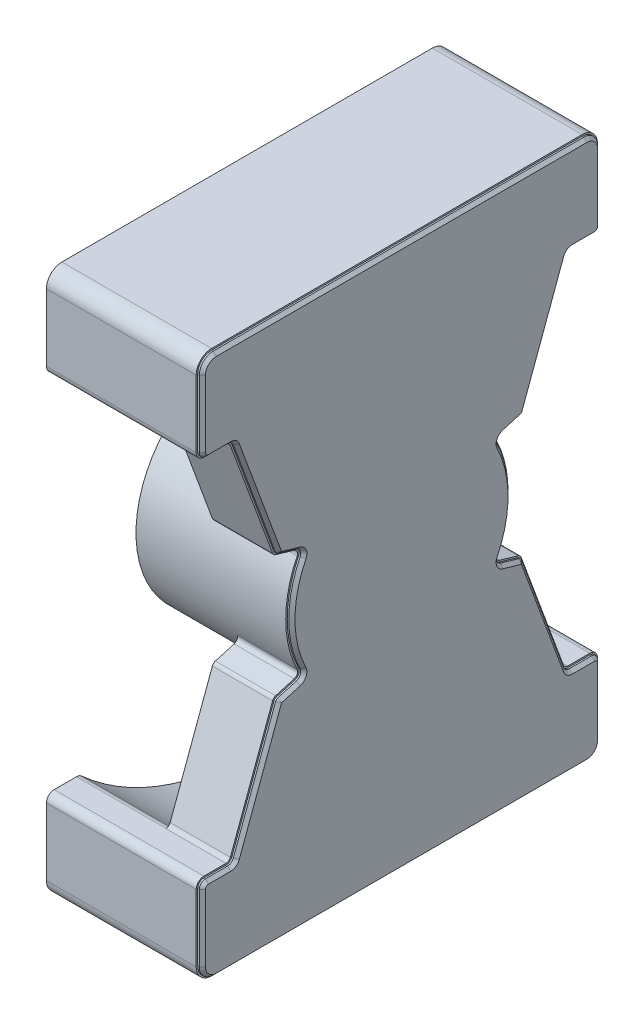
ISO-10303-21;
HEADER;
FILE_DESCRIPTION(('STEP AP214'),'2;1');
FILE_NAME('part.step','',(''),(''),'','','');
FILE_SCHEMA(('AUTOMOTIVE_DESIGN { 1 0 10303 214 1 1 1 1 }'));
ENDSEC;
DATA;
#1=APPLICATION_CONTEXT('core data for automotive mechanical design processes');
#2=APPLICATION_PROTOCOL_DEFINITION('international standard','automotive_design',2000,#1);
#3=PRODUCT_CONTEXT('',#1,'mechanical');
#4=PRODUCT('Part','Part','',(#3));
#5=PRODUCT_RELATED_PRODUCT_CATEGORY('part','',(#4));
#6=PRODUCT_DEFINITION_FORMATION('','',#4);
#7=PRODUCT_DEFINITION_CONTEXT('part definition',#1,'design');
#8=PRODUCT_DEFINITION('design','',#6,#7);
#9=PRODUCT_DEFINITION_SHAPE('','',#8);
#10=(LENGTH_UNIT() NAMED_UNIT(*) SI_UNIT(.MILLI.,.METRE.));
#11=(NAMED_UNIT(*) PLANE_ANGLE_UNIT() SI_UNIT($,.RADIAN.));
#12=(NAMED_UNIT(*) SI_UNIT($,.STERADIAN.) SOLID_ANGLE_UNIT());
#13=UNCERTAINTY_MEASURE_WITH_UNIT(LENGTH_MEASURE(1.E-05),#10,'distance_accuracy_value','');
#14=(GEOMETRIC_REPRESENTATION_CONTEXT(3) GLOBAL_UNCERTAINTY_ASSIGNED_CONTEXT((#13)) GLOBAL_UNIT_ASSIGNED_CONTEXT((#10,
#11,#12)) REPRESENTATION_CONTEXT('',''));
#15=CARTESIAN_POINT('',(0.,0.,0.));
#16=DIRECTION('',(0.,0.,1.));
#17=DIRECTION('',(1.,0.,0.));
#18=AXIS2_PLACEMENT_3D('',#15,#16,#17);
#19=CARTESIAN_POINT('',(-38.36110984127,-19.,7.846154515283));
#20=DIRECTION('',(1.,0.,0.));
#21=DIRECTION('',(0.,0.,-1.));
#22=AXIS2_PLACEMENT_3D('',#19,#20,#21);
#23=CYLINDRICAL_SURFACE('',#22,0.5);
#24=CARTESIAN_POINT('',(10.25,-19.,7.84615451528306));
#25=DIRECTION('',(-1.,0.,0.));
#26=DIRECTION('',(0.,0.742424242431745,0.669930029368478));
#27=AXIS2_PLACEMENT_3D('',#24,#25,#26);
#28=CIRCLE('',#27,0.500000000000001);
#29=CARTESIAN_POINT('',(10.25,-18.6287878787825,8.18111952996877));
#30=VERTEX_POINT('',#29);
#31=CARTESIAN_POINT('',(10.25,-18.4998135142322,7.84614565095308));
#32=VERTEX_POINT('',#31);
#33=EDGE_CURVE('E1041',#30,#32,#28,.T.);
#34=ORIENTED_EDGE('',*,*,#33,.T.);
#35=DIRECTION('',(-1.,0.,0.));
#36=VECTOR('',#35,1.);
#37=CARTESIAN_POINT('',(-30.43919691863,-18.5,7.846154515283));
#38=LINE('',#37,#36);
#39=CARTESIAN_POINT('',(4.45000000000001,-18.5,7.846154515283));
#40=VERTEX_POINT('',#39);
#41=EDGE_CURVE('E804',#40,#32,#38,.F.);
#42=ORIENTED_EDGE('',*,*,#41,.F.);
#43=CARTESIAN_POINT('',(4.45,-19.,7.84615451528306));
#44=DIRECTION('',(1.,0.,0.));
#45=DIRECTION('',(0.,1.,-1.28369537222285E-13));
#46=AXIS2_PLACEMENT_3D('',#43,#44,#45);
#47=CIRCLE('',#46,0.499999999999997);
#48=CARTESIAN_POINT('',(4.45000000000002,-18.6287878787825,8.18111952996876));
#49=VERTEX_POINT('',#48);
#50=EDGE_CURVE('E384',#40,#49,#47,.T.);
#51=ORIENTED_EDGE('',*,*,#50,.T.);
#52=DIRECTION('',(1.,0.,0.));
#53=VECTOR('',#52,1.);
#54=CARTESIAN_POINT('',(-38.36110984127,-18.6287878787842,8.18111952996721));
#55=LINE('',#54,#53);
#56=EDGE_CURVE('E1793',#49,#30,#55,.T.);
#57=ORIENTED_EDGE('',*,*,#56,.T.);
#58=EDGE_LOOP('',(#34,#42,#51,#57));
#59=FACE_BOUND('',#58,.T.);
#60=ADVANCED_FACE('F17',(#59),#23,.T.);
#61=CARTESIAN_POINT('',(-38.36110984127,-19.,29.953845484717));
#62=DIRECTION('',(1.,0.,0.));
#63=DIRECTION('',(0.,0.,-1.));
#64=AXIS2_PLACEMENT_3D('',#61,#62,#63);
#65=CYLINDRICAL_SURFACE('',#64,0.5);
#66=CARTESIAN_POINT('',(10.25,-19.,29.9538454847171));
#67=DIRECTION('',(-1.,0.,0.));
#68=DIRECTION('',(0.,1.,-1.11022302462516E-13));
#69=AXIS2_PLACEMENT_3D('',#66,#67,#68);
#70=CIRCLE('',#69,0.5);
#71=CARTESIAN_POINT('',(10.25,-18.4998146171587,29.9538541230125));
#72=VERTEX_POINT('',#71);
#73=CARTESIAN_POINT('',(10.25,-18.6287878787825,29.6188804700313));
#74=VERTEX_POINT('',#73);
#75=EDGE_CURVE('E1020',#72,#74,#70,.T.);
#76=ORIENTED_EDGE('',*,*,#75,.T.);
#77=DIRECTION('',(1.,0.,0.));
#78=VECTOR('',#77,1.);
#79=CARTESIAN_POINT('',(-38.36110984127,-18.6287878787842,29.6188804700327));
#80=LINE('',#79,#78);
#81=CARTESIAN_POINT('',(4.45,-18.6287878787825,29.6188804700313));
#82=VERTEX_POINT('',#81);
#83=EDGE_CURVE('E3565',#74,#82,#80,.F.);
#84=ORIENTED_EDGE('',*,*,#83,.T.);
#85=CARTESIAN_POINT('',(4.45,-19.,29.9538454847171));
#86=DIRECTION('',(1.,0.,0.));
#87=DIRECTION('',(0.,0.742424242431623,-0.669930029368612));
#88=AXIS2_PLACEMENT_3D('',#85,#86,#87);
#89=CIRCLE('',#88,0.499999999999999);
#90=CARTESIAN_POINT('',(4.45,-18.5,29.953845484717));
#91=VERTEX_POINT('',#90);
#92=EDGE_CURVE('E1031',#82,#91,#89,.T.);
#93=ORIENTED_EDGE('',*,*,#92,.T.);
#94=DIRECTION('',(1.,0.,0.));
#95=VECTOR('',#94,1.);
#96=CARTESIAN_POINT('',(-30.43919691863,-18.5,29.953845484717));
#97=LINE('',#96,#95);
#98=EDGE_CURVE('E833',#91,#72,#97,.T.);
#99=ORIENTED_EDGE('',*,*,#98,.T.);
#100=EDGE_LOOP('',(#76,#84,#93,#99));
#101=FACE_BOUND('',#100,.T.);
#102=ADVANCED_FACE('F1005',(#101),#65,.T.);
#103=CARTESIAN_POINT('',(-38.36110984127,5.5,29.953845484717));
#104=DIRECTION('',(1.,0.,0.));
#105=DIRECTION('',(0.,0.,-1.));
#106=AXIS2_PLACEMENT_3D('',#103,#104,#105);
#107=CYLINDRICAL_SURFACE('',#106,0.5);
#108=CARTESIAN_POINT('',(10.25,5.50000000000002,29.9538454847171));
#109=DIRECTION('',(-1.,0.,0.));
#110=DIRECTION('',(0.,-0.742424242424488,-0.66993002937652));
#111=AXIS2_PLACEMENT_3D('',#108,#109,#110);
#112=CIRCLE('',#111,0.500000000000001);
#113=CARTESIAN_POINT('',(10.25,5.12878787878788,29.6188804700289));
#114=VERTEX_POINT('',#113);
#115=CARTESIAN_POINT('',(10.25,4.99981351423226,29.9538543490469));
#116=VERTEX_POINT('',#115);
#117=EDGE_CURVE('E346',#114,#116,#112,.T.);
#118=ORIENTED_EDGE('',*,*,#117,.T.);
#119=DIRECTION('',(-1.,0.,0.));
#120=VECTOR('',#119,1.);
#121=CARTESIAN_POINT('',(-30.43919691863,5.,29.953845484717));
#122=LINE('',#121,#120);
#123=CARTESIAN_POINT('',(4.45,5.00000000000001,29.953845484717));
#124=VERTEX_POINT('',#123);
#125=EDGE_CURVE('E936',#116,#124,#122,.T.);
#126=ORIENTED_EDGE('',*,*,#125,.T.);
#127=CARTESIAN_POINT('',(4.45,5.50000000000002,29.9538454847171));
#128=DIRECTION('',(1.,0.,0.));
#129=DIRECTION('',(0.,-1.,-1.31838984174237E-13));
#130=AXIS2_PLACEMENT_3D('',#127,#128,#129);
#131=CIRCLE('',#130,0.5);
#132=CARTESIAN_POINT('',(4.44999999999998,5.12878787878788,29.6188804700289));
#133=VERTEX_POINT('',#132);
#134=EDGE_CURVE('E2398',#124,#133,#131,.T.);
#135=ORIENTED_EDGE('',*,*,#134,.T.);
#136=DIRECTION('',(1.,0.,0.));
#137=VECTOR('',#136,1.);
#138=CARTESIAN_POINT('',(-38.36110984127,5.12878787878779,29.6188804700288));
#139=LINE('',#138,#137);
#140=EDGE_CURVE('E530',#133,#114,#139,.T.);
#141=ORIENTED_EDGE('',*,*,#140,.T.);
#142=EDGE_LOOP('',(#118,#126,#135,#141));
#143=FACE_BOUND('',#142,.T.);
#144=ADVANCED_FACE('F997',(#143),#107,.T.);
#145=CARTESIAN_POINT('',(-38.36110984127,5.5,7.846154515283));
#146=DIRECTION('',(1.,0.,0.));
#147=DIRECTION('',(0.,0.,-1.));
#148=AXIS2_PLACEMENT_3D('',#145,#146,#147);
#149=CYLINDRICAL_SURFACE('',#148,0.5);
#150=CARTESIAN_POINT('',(10.25,5.50000000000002,7.84615451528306));
#151=DIRECTION('',(-1.,0.,0.));
#152=DIRECTION('',(0.,-1.,-1.14491749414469E-13));
#153=AXIS2_PLACEMENT_3D('',#150,#151,#152);
#154=CIRCLE('',#153,0.5);
#155=CARTESIAN_POINT('',(10.25,4.99973680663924,7.84614223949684));
#156=VERTEX_POINT('',#155);
#157=CARTESIAN_POINT('',(10.25,5.12878787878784,8.18111952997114));
#158=VERTEX_POINT('',#157);
#159=EDGE_CURVE('E519',#156,#158,#154,.T.);
#160=ORIENTED_EDGE('',*,*,#159,.T.);
#161=DIRECTION('',(1.,0.,0.));
#162=VECTOR('',#161,1.);
#163=CARTESIAN_POINT('',(-38.36110984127,5.12878787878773,8.18111952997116));
#164=LINE('',#163,#162);
#165=CARTESIAN_POINT('',(4.45000000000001,5.12878787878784,8.18111952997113));
#166=VERTEX_POINT('',#165);
#167=EDGE_CURVE('E523',#158,#166,#164,.F.);
#168=ORIENTED_EDGE('',*,*,#167,.T.);
#169=CARTESIAN_POINT('',(4.45,5.50000000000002,7.84615451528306));
#170=DIRECTION('',(1.,0.,0.));
#171=DIRECTION('',(0.,-0.742424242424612,0.669930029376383));
#172=AXIS2_PLACEMENT_3D('',#169,#170,#171);
#173=CIRCLE('',#172,0.5);
#174=CARTESIAN_POINT('',(4.45000000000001,5.00000000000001,7.846154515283));
#175=VERTEX_POINT('',#174);
#176=EDGE_CURVE('E506',#166,#175,#173,.T.);
#177=ORIENTED_EDGE('',*,*,#176,.T.);
#178=DIRECTION('',(1.,0.,0.));
#179=VECTOR('',#178,1.);
#180=CARTESIAN_POINT('',(-30.43919691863,5.,7.846154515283));
#181=LINE('',#180,#179);
#182=EDGE_CURVE('E1303',#156,#175,#181,.F.);
#183=ORIENTED_EDGE('',*,*,#182,.F.);
#184=EDGE_LOOP('',(#160,#168,#177,#183));
#185=FACE_BOUND('',#184,.T.);
#186=ADVANCED_FACE('F524',(#185),#149,.T.);
#187=CARTESIAN_POINT('',(-30.43919691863,5.,31.9));
#188=DIRECTION('',(0.,1.,0.));
#189=DIRECTION('',(-1.,0.,0.));
#190=AXIS2_PLACEMENT_3D('',#187,#188,#189);
#191=PLANE('',#190);
#192=DIRECTION('',(0.,0.,1.));
#193=VECTOR('',#192,1.);
#194=CARTESIAN_POINT('',(14.15,5.00000000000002,31.9));
#195=LINE('',#194,#193);
#196=CARTESIAN_POINT('',(14.15,5.00000000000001,31.4));
#197=VERTEX_POINT('',#196);
#198=CARTESIAN_POINT('',(14.15,5.00000000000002,29.968971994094));
#199=VERTEX_POINT('',#198);
#200=EDGE_CURVE('E834',#197,#199,#195,.F.);
#201=ORIENTED_EDGE('',*,*,#200,.F.);
#202=DIRECTION('',(1.,0.,0.));
#203=VECTOR('',#202,1.);
#204=CARTESIAN_POINT('',(4.45,5.,31.4));
#205=LINE('',#204,#203);
#206=CARTESIAN_POINT('',(4.45,5.00000000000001,31.4));
#207=VERTEX_POINT('',#206);
#208=EDGE_CURVE('E1315',#207,#197,#205,.T.);
#209=ORIENTED_EDGE('',*,*,#208,.F.);
#210=DIRECTION('',(0.,0.,1.));
#211=VECTOR('',#210,1.);
#212=CARTESIAN_POINT('',(4.45,5.00000000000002,31.9));
#213=LINE('',#212,#211);
#214=EDGE_CURVE('E944',#124,#207,#213,.T.);
#215=ORIENTED_EDGE('',*,*,#214,.F.);
#216=ORIENTED_EDGE('',*,*,#125,.F.);
#217=CARTESIAN_POINT('',(10.25,5.00000000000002,29.953845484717));
#218=DIRECTION('',(0.,0.,1.));
#219=VECTOR('',#218,1.);
#220=LINE('',#217,#219);
#221=CARTESIAN_POINT('',(10.25,5.00000000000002,29.968971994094));
#222=VERTEX_POINT('',#221);
#223=EDGE_CURVE('E1322',#116,#222,#220,.T.);
#224=ORIENTED_EDGE('',*,*,#223,.T.);
#225=DIRECTION('',(-1.,0.,0.));
#226=VECTOR('',#225,1.);
#227=CARTESIAN_POINT('',(-30.43919691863,5.,29.9689719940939));
#228=LINE('',#227,#226);
#229=EDGE_CURVE('E2372',#222,#199,#228,.F.);
#230=ORIENTED_EDGE('',*,*,#229,.T.);
#231=EDGE_LOOP('',(#201,#209,#215,#216,#224,#230));
#232=FACE_BOUND('',#231,.T.);
#233=ADVANCED_FACE('F920',(#232),#191,.F.);
#234=CARTESIAN_POINT('',(-30.43919691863,-18.5,31.9));
#235=DIRECTION('',(0.,-1.,0.));
#236=DIRECTION('',(1.,0.,0.));
#237=AXIS2_PLACEMENT_3D('',#234,#235,#236);
#238=PLANE('',#237);
#239=DIRECTION('',(0.,0.,1.));
#240=VECTOR('',#239,1.);
#241=CARTESIAN_POINT('',(14.15,-18.5,31.9));
#242=LINE('',#241,#240);
#243=CARTESIAN_POINT('',(14.15,-18.5,29.968971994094));
#244=VERTEX_POINT('',#243);
#245=CARTESIAN_POINT('',(14.15,-18.5,31.4));
#246=VERTEX_POINT('',#245);
#247=EDGE_CURVE('E837',#244,#246,#242,.T.);
#248=ORIENTED_EDGE('',*,*,#247,.F.);
#249=DIRECTION('',(-1.,0.,0.));
#250=VECTOR('',#249,1.);
#251=CARTESIAN_POINT('',(-30.43919691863,-18.5,29.9689719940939));
#252=LINE('',#251,#250);
#253=CARTESIAN_POINT('',(10.25,-18.5,29.968971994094));
#254=VERTEX_POINT('',#253);
#255=EDGE_CURVE('E866',#244,#254,#252,.T.);
#256=ORIENTED_EDGE('',*,*,#255,.T.);
#257=CARTESIAN_POINT('',(10.25,-18.5,29.968971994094));
#258=DIRECTION('',(0.,0.,-1.));
#259=VECTOR('',#258,1.);
#260=LINE('',#257,#259);
#261=EDGE_CURVE('E902',#254,#72,#260,.T.);
#262=ORIENTED_EDGE('',*,*,#261,.T.);
#263=ORIENTED_EDGE('',*,*,#98,.F.);
#264=DIRECTION('',(0.,0.,1.));
#265=VECTOR('',#264,1.);
#266=CARTESIAN_POINT('',(4.45,-18.5,31.9));
#267=LINE('',#266,#265);
#268=CARTESIAN_POINT('',(4.45,-18.5,31.4));
#269=VERTEX_POINT('',#268);
#270=EDGE_CURVE('E825',#269,#91,#267,.F.);
#271=ORIENTED_EDGE('',*,*,#270,.F.);
#272=DIRECTION('',(1.,0.,0.));
#273=VECTOR('',#272,1.);
#274=CARTESIAN_POINT('',(-30.43919691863,-18.5,31.3999999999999));
#275=LINE('',#274,#273);
#276=EDGE_CURVE('E1741',#246,#269,#275,.F.);
#277=ORIENTED_EDGE('',*,*,#276,.F.);
#278=EDGE_LOOP('',(#248,#256,#262,#263,#271,#277));
#279=FACE_BOUND('',#278,.T.);
#280=ADVANCED_FACE('F909',(#279),#238,.F.);
#281=CARTESIAN_POINT('',(-30.43919691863,-18.5,5.9));
#282=DIRECTION('',(0.,1.,0.));
#283=DIRECTION('',(-1.,0.,0.));
#284=AXIS2_PLACEMENT_3D('',#281,#282,#283);
#285=PLANE('',#284);
#286=ORIENTED_EDGE('',*,*,#41,.T.);
#287=CARTESIAN_POINT('',(10.25,-18.5,7.846154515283));
#288=DIRECTION('',(0.,0.,-1.));
#289=VECTOR('',#288,1.);
#290=LINE('',#287,#289);
#291=CARTESIAN_POINT('',(10.25,-18.5,7.831028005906));
#292=VERTEX_POINT('',#291);
#293=EDGE_CURVE('E952',#32,#292,#290,.T.);
#294=ORIENTED_EDGE('',*,*,#293,.T.);
#295=DIRECTION('',(-1.,0.,0.));
#296=VECTOR('',#295,1.);
#297=CARTESIAN_POINT('',(-30.43919691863,-18.5,7.83102800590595));
#298=LINE('',#297,#296);
#299=CARTESIAN_POINT('',(14.15,-18.5,7.831028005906));
#300=VERTEX_POINT('',#299);
#301=EDGE_CURVE('E1823',#292,#300,#298,.F.);
#302=ORIENTED_EDGE('',*,*,#301,.T.);
#303=DIRECTION('',(0.,0.,1.));
#304=VECTOR('',#303,1.);
#305=CARTESIAN_POINT('',(14.15,-18.5,5.9));
#306=LINE('',#305,#304);
#307=CARTESIAN_POINT('',(14.15,-18.5,6.40000000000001));
#308=VERTEX_POINT('',#307);
#309=EDGE_CURVE('E840',#300,#308,#306,.F.);
#310=ORIENTED_EDGE('',*,*,#309,.T.);
#311=DIRECTION('',(-1.,0.,0.));
#312=VECTOR('',#311,1.);
#313=CARTESIAN_POINT('',(4.45,-18.5,6.4));
#314=LINE('',#313,#312);
#315=CARTESIAN_POINT('',(4.45000000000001,-18.5,6.4));
#316=VERTEX_POINT('',#315);
#317=EDGE_CURVE('E735',#316,#308,#314,.F.);
#318=ORIENTED_EDGE('',*,*,#317,.F.);
#319=DIRECTION('',(0.,0.,1.));
#320=VECTOR('',#319,1.);
#321=CARTESIAN_POINT('',(4.45000000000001,-18.5,18.9));
#322=LINE('',#321,#320);
#323=EDGE_CURVE('E396',#40,#316,#322,.F.);
#324=ORIENTED_EDGE('',*,*,#323,.F.);
#325=EDGE_LOOP('',(#286,#294,#302,#310,#318,#324));
#326=FACE_BOUND('',#325,.T.);
#327=ADVANCED_FACE('F919',(#326),#285,.T.);
#328=CARTESIAN_POINT('',(-30.43919691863,-10.75,10.9));
#329=DIRECTION('',(0.,0.959720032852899,-0.280958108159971));
#330=DIRECTION('',(0.,0.280958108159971,0.959720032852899));
#331=AXIS2_PLACEMENT_3D('',#328,#329,#330);
#332=PLANE('',#331);
#333=DIRECTION('',(1.,0.,0.));
#334=VECTOR('',#333,1.);
#335=CARTESIAN_POINT('',(-30.43919691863,-10.7075824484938,11.0448933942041));
#336=LINE('',#335,#334);
#337=CARTESIAN_POINT('',(10.25,-10.707582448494,11.0448933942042));
#338=VERTEX_POINT('',#337);
#339=CARTESIAN_POINT('',(14.15,-10.707582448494,11.0448933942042));
#340=VERTEX_POINT('',#339);
#341=EDGE_CURVE('E695',#338,#340,#336,.T.);
#342=ORIENTED_EDGE('',*,*,#341,.F.);
#343=DIRECTION('',(0.,0.280958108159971,0.959720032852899));
#344=VECTOR('',#343,1.);
#345=CARTESIAN_POINT('',(10.25,-10.75,10.9));
#346=LINE('',#345,#344);
#347=CARTESIAN_POINT('',(10.25,-10.3528438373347,12.2566389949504));
#348=VERTEX_POINT('',#347);
#349=EDGE_CURVE('E1786',#338,#348,#346,.T.);
#350=ORIENTED_EDGE('',*,*,#349,.T.);
#351=DIRECTION('',(1.,0.,0.));
#352=VECTOR('',#351,1.);
#353=CARTESIAN_POINT('',(-38.36110984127,-10.3528438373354,12.2566389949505));
#354=LINE('',#353,#352);
#355=CARTESIAN_POINT('',(14.15,-10.3528438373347,12.2566389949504));
#356=VERTEX_POINT('',#355);
#357=EDGE_CURVE('E585',#348,#356,#354,.T.);
#358=ORIENTED_EDGE('',*,*,#357,.T.);
#359=DIRECTION('',(0.,0.280958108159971,0.959720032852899));
#360=VECTOR('',#359,1.);
#361=CARTESIAN_POINT('',(14.15,-10.75,10.9));
#362=LINE('',#361,#360);
#363=EDGE_CURVE('E1794',#356,#340,#362,.F.);
#364=ORIENTED_EDGE('',*,*,#363,.T.);
#365=EDGE_LOOP('',(#342,#350,#358,#364));
#366=FACE_BOUND('',#365,.T.);
#367=ADVANCED_FACE('F1718',(#366),#332,.T.);
#368=CARTESIAN_POINT('',(-38.36110984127,-6.75,18.9));
#369=DIRECTION('',(1.,0.,0.));
#370=DIRECTION('',(0.,0.,-1.));
#371=AXIS2_PLACEMENT_3D('',#368,#369,#370);
#372=CYLINDRICAL_SURFACE('',#371,16.);
#373=ORIENTED_EDGE('',*,*,#83,.F.);
#374=CARTESIAN_POINT('',(10.25,-6.74999999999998,18.9000000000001));
#375=DIRECTION('',(1.,0.,0.));
#376=DIRECTION('',(0.,-0.742424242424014,0.669930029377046));
#377=AXIS2_PLACEMENT_3D('',#374,#375,#376);
#378=CIRCLE('',#377,16.);
#379=EDGE_CURVE('E1161',#74,#30,#378,.T.);
#380=ORIENTED_EDGE('',*,*,#379,.T.);
#381=ORIENTED_EDGE('',*,*,#56,.F.);
#382=CARTESIAN_POINT('',(4.44999999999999,-18.62878787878,29.618880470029));
#383=CARTESIAN_POINT('',(4.44999999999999,-19.5560896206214,28.5912339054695));
#384=CARTESIAN_POINT('',(4.44999999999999,-20.2934019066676,27.4191704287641));
#385=CARTESIAN_POINT('',(4.45,-21.0690194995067,26.1862151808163));
#386=CARTESIAN_POINT('',(4.45,-21.6095387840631,24.8324621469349));
#387=CARTESIAN_POINT('',(4.45,-22.1692775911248,23.4305730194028));
#388=CARTESIAN_POINT('',(4.45,-22.4570543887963,21.9476946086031));
#389=CARTESIAN_POINT('',(4.45000000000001,-22.7499508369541,20.4384352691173));
#390=CARTESIAN_POINT('',(4.45000000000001,-22.7499999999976,18.9));
#391=CARTESIAN_POINT('',(4.45000000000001,-22.750049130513,17.3625826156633));
#392=CARTESIAN_POINT('',(4.45000000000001,-22.4570543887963,15.8523053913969));
#393=CARTESIAN_POINT('',(4.45000000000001,-22.1695697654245,14.3704307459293));
#394=CARTESIAN_POINT('',(4.45000000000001,-21.6095387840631,12.9675378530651));
#395=CARTESIAN_POINT('',(4.45000000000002,-21.0694974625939,11.6147196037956));
#396=CARTESIAN_POINT('',(4.45000000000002,-20.2934019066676,10.3808295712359));
#397=CARTESIAN_POINT('',(4.45000000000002,-19.5564347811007,9.20914860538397));
#398=CARTESIAN_POINT('',(4.45000000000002,-18.62878787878,8.181119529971));
#399=B_SPLINE_CURVE_WITH_KNOTS('',2,(#382,#383,#384,#385,#386,#387,#388,#389,#390,#391,#392,
#393,#394,#395,#396,#397,#398),.UNSPECIFIED.,.F.,.F.,(3,2,2,2,2,2,2,2,3),(0.,0.125,0.25,0.375,
0.5,0.625,0.75,0.875,1.),.UNSPECIFIED.);
#400=EDGE_CURVE('E1218',#82,#49,#399,.T.);
#401=ORIENTED_EDGE('',*,*,#400,.F.);
#402=EDGE_LOOP('',(#373,#380,#381,#401));
#403=FACE_BOUND('',#402,.T.);
#404=ADVANCED_FACE('F1715',(#403),#372,.F.);
#405=CARTESIAN_POINT('',(-30.43919691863,-10.75,26.9));
#406=DIRECTION('',(0.,-0.959720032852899,-0.280958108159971));
#407=DIRECTION('',(0.,0.280958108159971,-0.959720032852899));
#408=AXIS2_PLACEMENT_3D('',#405,#406,#407);
#409=PLANE('',#408);
#410=DIRECTION('',(0.,0.280958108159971,-0.959720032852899));
#411=VECTOR('',#410,1.);
#412=CARTESIAN_POINT('',(14.15,-10.75,26.9));
#413=LINE('',#412,#411);
#414=CARTESIAN_POINT('',(14.15,-10.3528438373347,25.5433610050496));
#415=VERTEX_POINT('',#414);
#416=CARTESIAN_POINT('',(14.15,-10.7075824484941,26.7551066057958));
#417=VERTEX_POINT('',#416);
#418=EDGE_CURVE('E3573',#415,#417,#413,.F.);
#419=ORIENTED_EDGE('',*,*,#418,.F.);
#420=DIRECTION('',(1.,0.,0.));
#421=VECTOR('',#420,1.);
#422=CARTESIAN_POINT('',(-38.36110984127,-10.3528438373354,25.5433610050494));
#423=LINE('',#422,#421);
#424=CARTESIAN_POINT('',(10.25,-10.3528438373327,25.5433610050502));
#425=VERTEX_POINT('',#424);
#426=EDGE_CURVE('E593',#415,#425,#423,.F.);
#427=ORIENTED_EDGE('',*,*,#426,.T.);
#428=DIRECTION('',(0.,-0.280958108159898,0.959720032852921));
#429=VECTOR('',#428,1.);
#430=CARTESIAN_POINT('',(10.25,-10.35284383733,25.543361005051));
#431=LINE('',#430,#429);
#432=CARTESIAN_POINT('',(10.25,-10.707582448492,26.7551066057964));
#433=VERTEX_POINT('',#432);
#434=EDGE_CURVE('E1164',#425,#433,#431,.T.);
#435=ORIENTED_EDGE('',*,*,#434,.T.);
#436=DIRECTION('',(1.,0.,0.));
#437=VECTOR('',#436,1.);
#438=CARTESIAN_POINT('',(-30.43919691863,-10.7075824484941,26.7551066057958));
#439=LINE('',#438,#437);
#440=EDGE_CURVE('E1752',#417,#433,#439,.F.);
#441=ORIENTED_EDGE('',*,*,#440,.F.);
#442=EDGE_LOOP('',(#419,#427,#435,#441));
#443=FACE_BOUND('',#442,.T.);
#444=ADVANCED_FACE('F1711',(#443),#409,.F.);
#445=CARTESIAN_POINT('',(-30.43919691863,-2.75,26.9));
#446=DIRECTION('',(0.,0.959720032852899,-0.280958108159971));
#447=DIRECTION('',(0.,0.280958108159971,0.959720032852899));
#448=AXIS2_PLACEMENT_3D('',#445,#446,#447);
#449=PLANE('',#448);
#450=DIRECTION('',(0.,0.280958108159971,0.959720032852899));
#451=VECTOR('',#450,1.);
#452=CARTESIAN_POINT('',(14.15,-2.75,26.9));
#453=LINE('',#452,#451);
#454=CARTESIAN_POINT('',(14.15,-2.79241755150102,26.7551066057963));
#455=VERTEX_POINT('',#454);
#456=CARTESIAN_POINT('',(14.15,-3.14715616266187,25.543361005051));
#457=VERTEX_POINT('',#456);
#458=EDGE_CURVE('E2265',#455,#457,#453,.F.);
#459=ORIENTED_EDGE('',*,*,#458,.F.);
#460=DIRECTION('',(1.,0.,0.));
#461=VECTOR('',#460,1.);
#462=CARTESIAN_POINT('',(-30.43919691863,-2.79241755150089,26.7551066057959));
#463=LINE('',#462,#461);
#464=CARTESIAN_POINT('',(10.25,-2.79241755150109,26.7551066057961));
#465=VERTEX_POINT('',#464);
#466=EDGE_CURVE('E596',#465,#455,#463,.T.);
#467=ORIENTED_EDGE('',*,*,#466,.F.);
#468=DIRECTION('',(0.,0.280958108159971,0.959720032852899));
#469=VECTOR('',#468,1.);
#470=CARTESIAN_POINT('',(10.25,-2.75,26.9));
#471=LINE('',#470,#469);
#472=CARTESIAN_POINT('',(10.25,-3.14715616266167,25.5433610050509));
#473=VERTEX_POINT('',#472);
#474=EDGE_CURVE('E338',#473,#465,#471,.T.);
#475=ORIENTED_EDGE('',*,*,#474,.F.);
#476=DIRECTION('',(1.,0.,0.));
#477=VECTOR('',#476,1.);
#478=CARTESIAN_POINT('',(-38.36110984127,-3.14715616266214,25.543361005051));
#479=LINE('',#478,#477);
#480=EDGE_CURVE('E589',#473,#457,#479,.T.);
#481=ORIENTED_EDGE('',*,*,#480,.T.);
#482=EDGE_LOOP('',(#459,#467,#475,#481));
#483=FACE_BOUND('',#482,.T.);
#484=ADVANCED_FACE('F1707',(#483),#449,.F.);
#485=CARTESIAN_POINT('',(-30.43919691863,-2.75,10.9));
#486=DIRECTION('',(0.,-0.959720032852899,-0.280958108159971));
#487=DIRECTION('',(0.,0.280958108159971,-0.959720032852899));
#488=AXIS2_PLACEMENT_3D('',#485,#486,#487);
#489=PLANE('',#488);
#490=DIRECTION('',(1.,0.,0.));
#491=VECTOR('',#490,1.);
#492=CARTESIAN_POINT('',(-38.36110984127,-3.1471561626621,12.2566389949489));
#493=LINE('',#492,#491);
#494=CARTESIAN_POINT('',(14.15,-3.14715616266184,12.256638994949));
#495=VERTEX_POINT('',#494);
#496=CARTESIAN_POINT('',(10.25,-3.14715616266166,12.2566389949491));
#497=VERTEX_POINT('',#496);
#498=EDGE_CURVE('E582',#495,#497,#493,.F.);
#499=ORIENTED_EDGE('',*,*,#498,.T.);
#500=DIRECTION('',(0.,0.280958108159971,-0.959720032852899));
#501=VECTOR('',#500,1.);
#502=CARTESIAN_POINT('',(10.25,-2.74999999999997,10.9));
#503=LINE('',#502,#501);
#504=CARTESIAN_POINT('',(10.25,-2.79241755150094,11.044893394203));
#505=VERTEX_POINT('',#504);
#506=EDGE_CURVE('E1309',#497,#505,#503,.T.);
#507=ORIENTED_EDGE('',*,*,#506,.T.);
#508=DIRECTION('',(1.,0.,0.));
#509=VECTOR('',#508,1.);
#510=CARTESIAN_POINT('',(-30.43919691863,-2.79241755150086,11.044893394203));
#511=LINE('',#510,#509);
#512=CARTESIAN_POINT('',(14.15,-2.79241755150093,11.044893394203));
#513=VERTEX_POINT('',#512);
#514=EDGE_CURVE('E568',#513,#505,#511,.F.);
#515=ORIENTED_EDGE('',*,*,#514,.F.);
#516=DIRECTION('',(0.,0.280958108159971,-0.959720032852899));
#517=VECTOR('',#516,1.);
#518=CARTESIAN_POINT('',(14.15,-2.74999999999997,10.9));
#519=LINE('',#518,#517);
#520=EDGE_CURVE('E3581',#513,#495,#519,.F.);
#521=ORIENTED_EDGE('',*,*,#520,.T.);
#522=EDGE_LOOP('',(#499,#507,#515,#521));
#523=FACE_BOUND('',#522,.T.);
#524=ADVANCED_FACE('F1704',(#523),#489,.T.);
#525=CARTESIAN_POINT('',(-38.36110984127,-6.75,18.9));
#526=DIRECTION('',(1.,0.,0.));
#527=DIRECTION('',(0.,0.,-1.));
#528=AXIS2_PLACEMENT_3D('',#525,#526,#527);
#529=CYLINDRICAL_SURFACE('',#528,16.);
#530=ORIENTED_EDGE('',*,*,#167,.F.);
#531=CARTESIAN_POINT('',(10.25,-6.74999999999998,18.9000000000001));
#532=DIRECTION('',(1.,0.,0.));
#533=DIRECTION('',(0.,0.,-1.));
#534=AXIS2_PLACEMENT_3D('',#531,#532,#533);
#535=CIRCLE('',#534,16.);
#536=EDGE_CURVE('E562',#158,#114,#535,.T.);
#537=ORIENTED_EDGE('',*,*,#536,.T.);
#538=ORIENTED_EDGE('',*,*,#140,.F.);
#539=CARTESIAN_POINT('',(4.45,-6.74999999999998,18.9000000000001));
#540=DIRECTION('',(1.,0.,0.));
#541=DIRECTION('',(0.,0.,-1.));
#542=AXIS2_PLACEMENT_3D('',#539,#540,#541);
#543=CIRCLE('',#542,16.);
#544=EDGE_CURVE('E511',#166,#133,#543,.T.);
#545=ORIENTED_EDGE('',*,*,#544,.F.);
#546=EDGE_LOOP('',(#530,#537,#538,#545));
#547=FACE_BOUND('',#546,.T.);
#548=ADVANCED_FACE('F533',(#547),#529,.F.);
#549=CARTESIAN_POINT('',(-30.43919691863,5.,5.9));
#550=DIRECTION('',(0.,-1.,0.));
#551=DIRECTION('',(1.,0.,0.));
#552=AXIS2_PLACEMENT_3D('',#549,#550,#551);
#553=PLANE('',#552);
#554=ORIENTED_EDGE('',*,*,#182,.T.);
#555=DIRECTION('',(0.,0.,1.));
#556=VECTOR('',#555,1.);
#557=CARTESIAN_POINT('',(4.44999999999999,5.,18.9));
#558=LINE('',#557,#556);
#559=CARTESIAN_POINT('',(4.45,5.00000000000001,6.40000000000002));
#560=VERTEX_POINT('',#559);
#561=EDGE_CURVE('E514',#560,#175,#558,.T.);
#562=ORIENTED_EDGE('',*,*,#561,.F.);
#563=DIRECTION('',(-1.,0.,0.));
#564=VECTOR('',#563,1.);
#565=CARTESIAN_POINT('',(-30.43919691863,5.,6.39999999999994));
#566=LINE('',#565,#564);
#567=CARTESIAN_POINT('',(14.15,5.00000000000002,6.40000000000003));
#568=VERTEX_POINT('',#567);
#569=EDGE_CURVE('E536',#568,#560,#566,.T.);
#570=ORIENTED_EDGE('',*,*,#569,.F.);
#571=DIRECTION('',(0.,0.,1.));
#572=VECTOR('',#571,1.);
#573=CARTESIAN_POINT('',(14.15,5.00000000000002,5.9));
#574=LINE('',#573,#572);
#575=CARTESIAN_POINT('',(14.15,5.00000000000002,7.831028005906));
#576=VERTEX_POINT('',#575);
#577=EDGE_CURVE('E529',#568,#576,#574,.T.);
#578=ORIENTED_EDGE('',*,*,#577,.T.);
#579=DIRECTION('',(-1.,0.,0.));
#580=VECTOR('',#579,1.);
#581=CARTESIAN_POINT('',(-30.43919691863,5.,7.83102800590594));
#582=LINE('',#581,#580);
#583=CARTESIAN_POINT('',(10.25,5.00000000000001,7.831028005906));
#584=VERTEX_POINT('',#583);
#585=EDGE_CURVE('E575',#576,#584,#582,.T.);
#586=ORIENTED_EDGE('',*,*,#585,.T.);
#587=CARTESIAN_POINT('',(10.25,5.00000000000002,7.831028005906));
#588=DIRECTION('',(0.,0.,1.));
#589=VECTOR('',#588,1.);
#590=LINE('',#587,#589);
#591=EDGE_CURVE('E564',#584,#156,#590,.T.);
#592=ORIENTED_EDGE('',*,*,#591,.T.);
#593=EDGE_LOOP('',(#554,#562,#570,#578,#586,#592));
#594=FACE_BOUND('',#593,.T.);
#595=ADVANCED_FACE('F1690',(#594),#553,.T.);
#596=CARTESIAN_POINT('',(4.45,9.85,30.9));
#597=DIRECTION('',(1.,0.,0.));
#598=DIRECTION('',(0.,0.,-1.));
#599=AXIS2_PLACEMENT_3D('',#596,#597,#598);
#600=CYLINDRICAL_SURFACE('',#599,1.);
#601=DIRECTION('',(1.,0.,0.));
#602=VECTOR('',#601,1.);
#603=CARTESIAN_POINT('',(4.45,10.85,30.9));
#604=LINE('',#603,#602);
#605=CARTESIAN_POINT('',(14.15,10.85,30.9));
#606=VERTEX_POINT('',#605);
#607=CARTESIAN_POINT('',(4.45,10.85,30.9));
#608=VERTEX_POINT('',#607);
#609=EDGE_CURVE('E1294',#606,#608,#604,.F.);
#610=ORIENTED_EDGE('',*,*,#609,.T.);
#611=CARTESIAN_POINT('',(4.45,9.85,30.9));
#612=DIRECTION('',(1.,0.,0.));
#613=DIRECTION('',(0.,0.,-1.));
#614=AXIS2_PLACEMENT_3D('',#611,#612,#613);
#615=CIRCLE('',#614,1.);
#616=CARTESIAN_POINT('',(4.45,9.85,31.9));
#617=VERTEX_POINT('',#616);
#618=EDGE_CURVE('E538',#617,#608,#615,.F.);
#619=ORIENTED_EDGE('',*,*,#618,.F.);
#620=DIRECTION('',(-1.,0.,0.));
#621=VECTOR('',#620,1.);
#622=CARTESIAN_POINT('',(4.45,9.85,31.9));
#623=LINE('',#622,#621);
#624=CARTESIAN_POINT('',(14.15,9.85,31.9));
#625=VERTEX_POINT('',#624);
#626=EDGE_CURVE('E1293',#617,#625,#623,.F.);
#627=ORIENTED_EDGE('',*,*,#626,.T.);
#628=CARTESIAN_POINT('',(14.15,9.85,30.9));
#629=DIRECTION('',(-1.,0.,0.));
#630=DIRECTION('',(0.,0.,1.));
#631=AXIS2_PLACEMENT_3D('',#628,#629,#630);
#632=CIRCLE('',#631,0.999999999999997);
#633=EDGE_CURVE('E1313',#625,#606,#632,.T.);
#634=ORIENTED_EDGE('',*,*,#633,.T.);
#635=EDGE_LOOP('',(#610,#619,#627,#634));
#636=FACE_BOUND('',#635,.T.);
#637=ADVANCED_FACE('F1328',(#636),#600,.T.);
#638=CARTESIAN_POINT('',(4.45,5.5,31.4));
#639=DIRECTION('',(1.,0.,0.));
#640=DIRECTION('',(0.,0.,-1.));
#641=AXIS2_PLACEMENT_3D('',#638,#639,#640);
#642=CYLINDRICAL_SURFACE('',#641,0.5);
#643=DIRECTION('',(-1.,0.,0.));
#644=VECTOR('',#643,1.);
#645=CARTESIAN_POINT('',(4.45,5.5,31.9));
#646=LINE('',#645,#644);
#647=CARTESIAN_POINT('',(14.15,5.5,31.9));
#648=VERTEX_POINT('',#647);
#649=CARTESIAN_POINT('',(4.45,5.5,31.9));
#650=VERTEX_POINT('',#649);
#651=EDGE_CURVE('E1289',#648,#650,#646,.T.);
#652=ORIENTED_EDGE('',*,*,#651,.T.);
#653=CARTESIAN_POINT('',(4.45,5.5,31.4));
#654=DIRECTION('',(1.,0.,0.));
#655=DIRECTION('',(0.,0.,-1.));
#656=AXIS2_PLACEMENT_3D('',#653,#654,#655);
#657=CIRCLE('',#656,0.5);
#658=EDGE_CURVE('E545',#207,#650,#657,.F.);
#659=ORIENTED_EDGE('',*,*,#658,.F.);
#660=ORIENTED_EDGE('',*,*,#208,.T.);
#661=CARTESIAN_POINT('',(14.15,5.5,31.4));
#662=DIRECTION('',(-1.,0.,0.));
#663=DIRECTION('',(0.,-1.,0.));
#664=AXIS2_PLACEMENT_3D('',#661,#662,#663);
#665=CIRCLE('',#664,0.5);
#666=EDGE_CURVE('E1317',#197,#648,#665,.T.);
#667=ORIENTED_EDGE('',*,*,#666,.T.);
#668=EDGE_LOOP('',(#652,#659,#660,#667));
#669=FACE_BOUND('',#668,.T.);
#670=ADVANCED_FACE('F2362',(#669),#642,.T.);
#671=CARTESIAN_POINT('',(-30.43919691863,4.7,29.968971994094));
#672=DIRECTION('',(-1.,0.,0.));
#673=DIRECTION('',(0.,0.,1.));
#674=AXIS2_PLACEMENT_3D('',#671,#672,#673);
#675=CYLINDRICAL_SURFACE('',#674,0.3);
#676=CARTESIAN_POINT('',(14.15,5.,29.968971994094));
#677=CARTESIAN_POINT('',(14.15,5.,29.8753423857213));
#678=CARTESIAN_POINT('',(14.15,4.94612800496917,29.7974464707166));
#679=CARTESIAN_POINT('',(14.15,4.89280674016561,29.720346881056));
#680=CARTESIAN_POINT('',(14.15,4.803859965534,29.687523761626));
#681=B_SPLINE_CURVE_WITH_KNOTS('',2,(#676,#677,#678,#679,#680),.UNSPECIFIED.,.F.,.F.,(3,2,3),
(0.,0.5,1.),.UNSPECIFIED.);
#682=CARTESIAN_POINT('',(14.15,4.80385996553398,29.6875237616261));
#683=VERTEX_POINT('',#682);
#684=EDGE_CURVE('E600',#199,#683,#681,.T.);
#685=ORIENTED_EDGE('',*,*,#684,.F.);
#686=ORIENTED_EDGE('',*,*,#229,.F.);
#687=ORIENTED_EDGE('',*,*,#223,.F.);
#688=CARTESIAN_POINT('',(10.25,4.70000000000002,29.9689719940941));
#689=DIRECTION('',(-1.,0.,0.));
#690=DIRECTION('',(0.,0.,1.));
#691=AXIS2_PLACEMENT_3D('',#688,#689,#690);
#692=CIRCLE('',#691,0.3);
#693=CARTESIAN_POINT('',(10.25,4.80385996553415,29.6875237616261));
#694=VERTEX_POINT('',#693);
#695=EDGE_CURVE('E559',#116,#694,#692,.T.);
#696=ORIENTED_EDGE('',*,*,#695,.T.);
#697=DIRECTION('',(1.,0.,0.));
#698=VECTOR('',#697,1.);
#699=CARTESIAN_POINT('',(-30.43919691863,4.80385996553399,29.687523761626));
#700=LINE('',#699,#698);
#701=EDGE_CURVE('E1288',#694,#683,#700,.T.);
#702=ORIENTED_EDGE('',*,*,#701,.T.);
#703=EDGE_LOOP('',(#685,#686,#687,#696,#702));
#704=FACE_BOUND('',#703,.T.);
#705=ADVANCED_FACE('F2359',(#704),#675,.F.);
#706=CARTESIAN_POINT('',(-30.43919691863,-2.504501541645,26.670819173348));
#707=DIRECTION('',(1.,0.,0.));
#708=DIRECTION('',(0.,0.,-1.));
#709=AXIS2_PLACEMENT_3D('',#706,#707,#708);
#710=CYLINDRICAL_SURFACE('',#709,0.3);
#711=DIRECTION('',(1.,0.,0.));
#712=VECTOR('',#711,1.);
#713=CARTESIAN_POINT('',(-30.43919691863,-2.60836150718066,26.9522674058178));
#714=LINE('',#713,#712);
#715=CARTESIAN_POINT('',(14.15,-2.60836150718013,26.9522674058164));
#716=VERTEX_POINT('',#715);
#717=CARTESIAN_POINT('',(10.25,-2.60836150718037,26.9522674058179));
#718=VERTEX_POINT('',#717);
#719=EDGE_CURVE('E1282',#716,#718,#714,.F.);
#720=ORIENTED_EDGE('',*,*,#719,.T.);
#721=CARTESIAN_POINT('',(10.25,-2.50450154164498,26.6708191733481));
#722=DIRECTION('',(1.,0.,0.));
#723=DIRECTION('',(0.,0.,-1.));
#724=AXIS2_PLACEMENT_3D('',#721,#722,#723);
#725=CIRCLE('',#724,0.3);
#726=EDGE_CURVE('E556',#718,#465,#725,.T.);
#727=ORIENTED_EDGE('',*,*,#726,.T.);
#728=ORIENTED_EDGE('',*,*,#466,.T.);
#729=CARTESIAN_POINT('',(14.15,-2.50450154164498,26.6708191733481));
#730=DIRECTION('',(-1.,0.,0.));
#731=DIRECTION('',(0.,-0.959720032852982,0.280958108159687));
#732=AXIS2_PLACEMENT_3D('',#729,#730,#731);
#733=CIRCLE('',#732,0.3);
#734=EDGE_CURVE('E599',#455,#716,#733,.T.);
#735=ORIENTED_EDGE('',*,*,#734,.T.);
#736=EDGE_LOOP('',(#720,#727,#728,#735));
#737=FACE_BOUND('',#736,.T.);
#738=ADVANCED_FACE('F2340',(#737),#710,.T.);
#739=CARTESIAN_POINT('',(-30.43919691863,-10.99549845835,26.670819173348));
#740=DIRECTION('',(1.,0.,0.));
#741=DIRECTION('',(0.,0.,-1.));
#742=AXIS2_PLACEMENT_3D('',#739,#740,#741);
#743=CYLINDRICAL_SURFACE('',#742,0.3);
#744=ORIENTED_EDGE('',*,*,#440,.T.);
#745=CARTESIAN_POINT('',(10.25,-10.99549845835,26.6708191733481));
#746=DIRECTION('',(1.,0.,0.));
#747=DIRECTION('',(0.,0.959720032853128,0.28095810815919));
#748=AXIS2_PLACEMENT_3D('',#745,#746,#747);
#749=CIRCLE('',#748,0.3);
#750=CARTESIAN_POINT('',(10.25,-10.8916384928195,26.9522674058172));
#751=VERTEX_POINT('',#750);
#752=EDGE_CURVE('E1133',#433,#751,#749,.T.);
#753=ORIENTED_EDGE('',*,*,#752,.T.);
#754=DIRECTION('',(1.,0.,0.));
#755=VECTOR('',#754,1.);
#756=CARTESIAN_POINT('',(-30.43919691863,-10.8916384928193,26.9522674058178));
#757=LINE('',#756,#755);
#758=CARTESIAN_POINT('',(14.15,-10.8916384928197,26.9522674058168));
#759=VERTEX_POINT('',#758);
#760=EDGE_CURVE('E1281',#751,#759,#757,.T.);
#761=ORIENTED_EDGE('',*,*,#760,.T.);
#762=CARTESIAN_POINT('',(14.15,-10.99549845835,26.6708191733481));
#763=DIRECTION('',(-1.,0.,0.));
#764=DIRECTION('',(0.,0.346199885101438,0.938160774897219));
#765=AXIS2_PLACEMENT_3D('',#762,#763,#764);
#766=CIRCLE('',#765,0.3);
#767=EDGE_CURVE('E1753',#759,#417,#766,.T.);
#768=ORIENTED_EDGE('',*,*,#767,.T.);
#769=EDGE_LOOP('',(#744,#753,#761,#768));
#770=FACE_BOUND('',#769,.T.);
#771=ADVANCED_FACE('F877',(#770),#743,.T.);
#772=CARTESIAN_POINT('',(-30.43919691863,-18.2,29.968971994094));
#773=DIRECTION('',(-1.,0.,0.));
#774=DIRECTION('',(0.,0.,1.));
#775=AXIS2_PLACEMENT_3D('',#772,#773,#774);
#776=CYLINDRICAL_SURFACE('',#775,0.3);
#777=CARTESIAN_POINT('',(14.15,-18.30385996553,29.687523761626));
#778=CARTESIAN_POINT('',(14.15,-18.3916995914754,29.7199383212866));
#779=CARTESIAN_POINT('',(14.15,-18.446128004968,29.7974464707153));
#780=CARTESIAN_POINT('',(14.15,-18.5,29.8741622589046));
#781=CARTESIAN_POINT('',(14.15,-18.5,29.968971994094));
#782=B_SPLINE_CURVE_WITH_KNOTS('',2,(#777,#778,#779,#780,#781),.UNSPECIFIED.,.F.,.F.,(3,2,3),
(0.,0.5,1.),.UNSPECIFIED.);
#783=CARTESIAN_POINT('',(14.15,-18.3038599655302,29.6875237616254));
#784=VERTEX_POINT('',#783);
#785=EDGE_CURVE('E861',#784,#244,#782,.T.);
#786=ORIENTED_EDGE('',*,*,#785,.F.);
#787=DIRECTION('',(1.,0.,0.));
#788=VECTOR('',#787,1.);
#789=CARTESIAN_POINT('',(-30.43919691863,-18.3038599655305,29.6875237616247));
#790=LINE('',#789,#788);
#791=CARTESIAN_POINT('',(10.25,-18.3038599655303,29.6875237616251));
#792=VERTEX_POINT('',#791);
#793=EDGE_CURVE('E1160',#784,#792,#790,.F.);
#794=ORIENTED_EDGE('',*,*,#793,.T.);
#795=CARTESIAN_POINT('',(10.25,-18.2,29.9689719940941));
#796=DIRECTION('',(-1.,0.,0.));
#797=DIRECTION('',(0.,-0.346199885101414,-0.938160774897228));
#798=AXIS2_PLACEMENT_3D('',#795,#796,#797);
#799=CIRCLE('',#798,0.3);
#800=EDGE_CURVE('E1156',#792,#72,#799,.T.);
#801=ORIENTED_EDGE('',*,*,#800,.T.);
#802=ORIENTED_EDGE('',*,*,#261,.F.);
#803=ORIENTED_EDGE('',*,*,#255,.F.);
#804=EDGE_LOOP('',(#786,#794,#801,#802,#803));
#805=FACE_BOUND('',#804,.T.);
#806=ADVANCED_FACE('F868',(#805),#776,.F.);
#807=CARTESIAN_POINT('',(-30.43919691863,-19.,31.4));
#808=DIRECTION('',(1.,0.,0.));
#809=DIRECTION('',(0.,0.,-1.));
#810=AXIS2_PLACEMENT_3D('',#807,#808,#809);
#811=CYLINDRICAL_SURFACE('',#810,0.5);
#812=ORIENTED_EDGE('',*,*,#276,.T.);
#813=CARTESIAN_POINT('',(4.44999999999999,-19.,31.9));
#814=CARTESIAN_POINT('',(4.44999999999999,-18.9048964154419,31.9));
#815=CARTESIAN_POINT('',(4.44999999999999,-18.8159526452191,31.8648941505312));
#816=CARTESIAN_POINT('',(4.44999999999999,-18.7201216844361,31.8270699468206));
#817=CARTESIAN_POINT('',(4.44999999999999,-18.6464466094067,31.7535533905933));
#818=CARTESIAN_POINT('',(4.44999999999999,-18.5735175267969,31.6807812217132));
#819=CARTESIAN_POINT('',(4.44999999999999,-18.5351058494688,31.5840473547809));
#820=CARTESIAN_POINT('',(4.44999999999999,-18.5,31.4956387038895));
#821=CARTESIAN_POINT('',(4.44999999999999,-18.5,31.4));
#822=B_SPLINE_CURVE_WITH_KNOTS('',2,(#813,#814,#815,#816,#817,#818,#819,#820,#821),
.UNSPECIFIED.,.F.,.F.,(3,2,2,2,3),(0.,0.25,0.5,0.75,1.),.UNSPECIFIED.);
#823=CARTESIAN_POINT('',(4.45,-19.,31.9));
#824=VERTEX_POINT('',#823);
#825=EDGE_CURVE('E1198',#824,#269,#822,.T.);
#826=ORIENTED_EDGE('',*,*,#825,.F.);
#827=DIRECTION('',(-1.,0.,0.));
#828=VECTOR('',#827,1.);
#829=CARTESIAN_POINT('',(4.45,-19.,31.9));
#830=LINE('',#829,#828);
#831=CARTESIAN_POINT('',(14.15,-19.,31.9));
#832=VERTEX_POINT('',#831);
#833=EDGE_CURVE('E1276',#824,#832,#830,.F.);
#834=ORIENTED_EDGE('',*,*,#833,.T.);
#835=CARTESIAN_POINT('',(14.15,-19.,31.4000000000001));
#836=DIRECTION('',(-1.,0.,0.));
#837=DIRECTION('',(0.,0.,1.));
#838=AXIS2_PLACEMENT_3D('',#835,#836,#837);
#839=CIRCLE('',#838,0.499999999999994);
#840=EDGE_CURVE('E847',#832,#246,#839,.T.);
#841=ORIENTED_EDGE('',*,*,#840,.T.);
#842=EDGE_LOOP('',(#812,#826,#834,#841));
#843=FACE_BOUND('',#842,.T.);
#844=ADVANCED_FACE('F815',(#843),#811,.T.);
#845=CARTESIAN_POINT('',(4.45,-23.35,30.9));
#846=DIRECTION('',(1.,0.,0.));
#847=DIRECTION('',(0.,0.,-1.));
#848=AXIS2_PLACEMENT_3D('',#845,#846,#847);
#849=CYLINDRICAL_SURFACE('',#848,1.);
#850=DIRECTION('',(-1.,0.,0.));
#851=VECTOR('',#850,1.);
#852=CARTESIAN_POINT('',(4.45,-23.35,31.9));
#853=LINE('',#852,#851);
#854=CARTESIAN_POINT('',(14.15,-23.35,31.9));
#855=VERTEX_POINT('',#854);
#856=CARTESIAN_POINT('',(4.45,-23.35,31.9));
#857=VERTEX_POINT('',#856);
#858=EDGE_CURVE('E1271',#855,#857,#853,.T.);
#859=ORIENTED_EDGE('',*,*,#858,.T.);
#860=CARTESIAN_POINT('',(4.44999999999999,-24.35,30.9));
#861=CARTESIAN_POINT('',(4.44999999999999,-24.35,31.0904756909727));
#862=CARTESIAN_POINT('',(4.44999999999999,-24.2797883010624,31.2680947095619));
#863=CARTESIAN_POINT('',(4.44999999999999,-24.2038468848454,31.4602085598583));
#864=CARTESIAN_POINT('',(4.44999999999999,-24.0571067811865,31.6071067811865));
#865=CARTESIAN_POINT('',(4.44999999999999,-23.9111114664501,31.7532594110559));
#866=CARTESIAN_POINT('',(4.44999999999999,-23.7180947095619,31.8297883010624));
#867=CARTESIAN_POINT('',(4.44999999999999,-23.5410108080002,31.9));
#868=CARTESIAN_POINT('',(4.44999999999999,-23.35,31.9));
#869=B_SPLINE_CURVE_WITH_KNOTS('',2,(#860,#861,#862,#863,#864,#865,#866,#867,#868),
.UNSPECIFIED.,.F.,.F.,(3,2,2,2,3),(0.,0.25,0.5,0.75,1.),.UNSPECIFIED.);
#870=CARTESIAN_POINT('',(4.45,-24.35,30.9));
#871=VERTEX_POINT('',#870);
#872=EDGE_CURVE('E799',#871,#857,#869,.T.);
#873=ORIENTED_EDGE('',*,*,#872,.F.);
#874=DIRECTION('',(-1.,0.,0.));
#875=VECTOR('',#874,1.);
#876=CARTESIAN_POINT('',(4.45,-24.35,30.9));
#877=LINE('',#876,#875);
#878=CARTESIAN_POINT('',(14.15,-24.35,30.9));
#879=VERTEX_POINT('',#878);
#880=EDGE_CURVE('E1270',#871,#879,#877,.F.);
#881=ORIENTED_EDGE('',*,*,#880,.T.);
#882=CARTESIAN_POINT('',(14.15,-23.35,30.9));
#883=DIRECTION('',(-1.,0.,0.));
#884=DIRECTION('',(0.,-1.,0.));
#885=AXIS2_PLACEMENT_3D('',#882,#883,#884);
#886=CIRCLE('',#885,0.999999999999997);
#887=EDGE_CURVE('E1747',#879,#855,#886,.T.);
#888=ORIENTED_EDGE('',*,*,#887,.T.);
#889=EDGE_LOOP('',(#859,#873,#881,#888));
#890=FACE_BOUND('',#889,.T.);
#891=ADVANCED_FACE('F806',(#890),#849,.T.);
#892=CARTESIAN_POINT('',(4.45,-6.75,18.9));
#893=DIRECTION('',(-1.,0.,0.));
#894=DIRECTION('',(0.,0.,1.));
#895=AXIS2_PLACEMENT_3D('',#892,#893,#894);
#896=PLANE('',#895);
#897=DIRECTION('',(0.,0.,1.));
#898=VECTOR('',#897,1.);
#899=CARTESIAN_POINT('',(4.45,-24.35,5.9));
#900=LINE('',#899,#898);
#901=CARTESIAN_POINT('',(4.45000000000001,-24.35,6.9));
#902=VERTEX_POINT('',#901);
#903=EDGE_CURVE('E1268',#902,#871,#900,.T.);
#904=ORIENTED_EDGE('',*,*,#903,.T.);
#905=ORIENTED_EDGE('',*,*,#872,.T.);
#906=DIRECTION('',(0.,1.,0.));
#907=VECTOR('',#906,1.);
#908=CARTESIAN_POINT('',(4.45,-24.35,31.9));
#909=LINE('',#908,#907);
#910=EDGE_CURVE('E1274',#857,#824,#909,.T.);
#911=ORIENTED_EDGE('',*,*,#910,.T.);
#912=ORIENTED_EDGE('',*,*,#825,.T.);
#913=ORIENTED_EDGE('',*,*,#270,.T.);
#914=ORIENTED_EDGE('',*,*,#92,.F.);
#915=ORIENTED_EDGE('',*,*,#400,.T.);
#916=ORIENTED_EDGE('',*,*,#50,.F.);
#917=ORIENTED_EDGE('',*,*,#323,.T.);
#918=CARTESIAN_POINT('',(4.45,-19.,6.4));
#919=DIRECTION('',(1.,0.,0.));
#920=DIRECTION('',(0.,0.,-1.));
#921=AXIS2_PLACEMENT_3D('',#918,#919,#920);
#922=CIRCLE('',#921,0.5);
#923=CARTESIAN_POINT('',(4.45000000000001,-19.,5.90000000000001));
#924=VERTEX_POINT('',#923);
#925=EDGE_CURVE('E730',#924,#316,#922,.T.);
#926=ORIENTED_EDGE('',*,*,#925,.F.);
#927=DIRECTION('',(0.,1.,0.));
#928=VECTOR('',#927,1.);
#929=CARTESIAN_POINT('',(4.45,10.85,5.9));
#930=LINE('',#929,#928);
#931=CARTESIAN_POINT('',(4.45000000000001,-23.35,5.90000000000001));
#932=VERTEX_POINT('',#931);
#933=EDGE_CURVE('E1188',#924,#932,#930,.F.);
#934=ORIENTED_EDGE('',*,*,#933,.T.);
#935=CARTESIAN_POINT('',(4.45,-23.35,6.9));
#936=DIRECTION('',(1.,0.,0.));
#937=DIRECTION('',(0.,-1.,0.));
#938=AXIS2_PLACEMENT_3D('',#935,#936,#937);
#939=CIRCLE('',#938,1.);
#940=EDGE_CURVE('E743',#902,#932,#939,.T.);
#941=ORIENTED_EDGE('',*,*,#940,.F.);
#942=EDGE_LOOP('',(#904,#905,#911,#912,#913,#914,#915,#916,#917,#926,#934,#941));
#943=FACE_BOUND('',#942,.T.);
#944=ADVANCED_FACE('F781',(#943),#896,.T.);
#945=CARTESIAN_POINT('',(4.45,-23.35,6.9));
#946=DIRECTION('',(1.,0.,0.));
#947=DIRECTION('',(0.,0.,-1.));
#948=AXIS2_PLACEMENT_3D('',#945,#946,#947);
#949=CYLINDRICAL_SURFACE('',#948,1.);
#950=DIRECTION('',(-1.,0.,0.));
#951=VECTOR('',#950,1.);
#952=CARTESIAN_POINT('',(4.45,-24.35,6.9));
#953=LINE('',#952,#951);
#954=CARTESIAN_POINT('',(14.15,-24.35,6.9));
#955=VERTEX_POINT('',#954);
#956=EDGE_CURVE('E1192',#955,#902,#953,.T.);
#957=ORIENTED_EDGE('',*,*,#956,.T.);
#958=ORIENTED_EDGE('',*,*,#940,.T.);
#959=DIRECTION('',(1.,0.,0.));
#960=VECTOR('',#959,1.);
#961=CARTESIAN_POINT('',(4.45,-23.35,5.90000000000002));
#962=LINE('',#961,#960);
#963=CARTESIAN_POINT('',(14.15,-23.35,5.90000000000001));
#964=VERTEX_POINT('',#963);
#965=EDGE_CURVE('E1191',#932,#964,#962,.T.);
#966=ORIENTED_EDGE('',*,*,#965,.T.);
#967=CARTESIAN_POINT('',(14.15,-23.35,6.90000000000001));
#968=DIRECTION('',(-1.,0.,0.));
#969=DIRECTION('',(0.,0.,-1.));
#970=AXIS2_PLACEMENT_3D('',#967,#968,#969);
#971=CIRCLE('',#970,1.);
#972=EDGE_CURVE('E2302',#964,#955,#971,.T.);
#973=ORIENTED_EDGE('',*,*,#972,.T.);
#974=EDGE_LOOP('',(#957,#958,#966,#973));
#975=FACE_BOUND('',#974,.T.);
#976=ADVANCED_FACE('F772',(#975),#949,.T.);
#977=CARTESIAN_POINT('',(4.45,-19.,6.4));
#978=DIRECTION('',(-1.,0.,0.));
#979=DIRECTION('',(0.,0.,1.));
#980=AXIS2_PLACEMENT_3D('',#977,#978,#979);
#981=CYLINDRICAL_SURFACE('',#980,0.5);
#982=DIRECTION('',(1.,0.,0.));
#983=VECTOR('',#982,1.);
#984=CARTESIAN_POINT('',(4.45,-19.,5.90000000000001));
#985=LINE('',#984,#983);
#986=CARTESIAN_POINT('',(14.15,-19.,5.90000000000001));
#987=VERTEX_POINT('',#986);
#988=EDGE_CURVE('E1467',#987,#924,#985,.F.);
#989=ORIENTED_EDGE('',*,*,#988,.T.);
#990=ORIENTED_EDGE('',*,*,#925,.T.);
#991=ORIENTED_EDGE('',*,*,#317,.T.);
#992=CARTESIAN_POINT('',(14.15,-19.,6.40000000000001));
#993=DIRECTION('',(-1.,0.,0.));
#994=DIRECTION('',(0.,1.,0.));
#995=AXIS2_PLACEMENT_3D('',#992,#993,#994);
#996=CIRCLE('',#995,0.5);
#997=EDGE_CURVE('E742',#308,#987,#996,.T.);
#998=ORIENTED_EDGE('',*,*,#997,.T.);
#999=EDGE_LOOP('',(#989,#990,#991,#998));
#1000=FACE_BOUND('',#999,.T.);
#1001=ADVANCED_FACE('F708',(#1000),#981,.T.);
#1002=CARTESIAN_POINT('',(-30.43919691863,-10.99549845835,11.129180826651));
#1003=DIRECTION('',(1.,0.,0.));
#1004=DIRECTION('',(0.,0.,-1.));
#1005=AXIS2_PLACEMENT_3D('',#1002,#1003,#1004);
#1006=CYLINDRICAL_SURFACE('',#1005,0.3);
#1007=DIRECTION('',(1.,0.,0.));
#1008=VECTOR('',#1007,1.);
#1009=CARTESIAN_POINT('',(-30.43919691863,-10.8916384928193,10.8477325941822));
#1010=LINE('',#1009,#1008);
#1011=CARTESIAN_POINT('',(10.25,-10.8916384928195,10.8477325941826));
#1012=VERTEX_POINT('',#1011);
#1013=CARTESIAN_POINT('',(14.15,-10.8916384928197,10.8477325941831));
#1014=VERTEX_POINT('',#1013);
#1015=EDGE_CURVE('E1462',#1012,#1014,#1010,.T.);
#1016=ORIENTED_EDGE('',*,*,#1015,.F.);
#1017=CARTESIAN_POINT('',(10.25,-10.99549845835,11.1291808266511));
#1018=DIRECTION('',(1.,0.,0.));
#1019=DIRECTION('',(0.,0.346199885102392,-0.938160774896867));
#1020=AXIS2_PLACEMENT_3D('',#1017,#1018,#1019);
#1021=CIRCLE('',#1020,0.299999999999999);
#1022=EDGE_CURVE('E690',#1012,#338,#1021,.T.);
#1023=ORIENTED_EDGE('',*,*,#1022,.T.);
#1024=ORIENTED_EDGE('',*,*,#341,.T.);
#1025=CARTESIAN_POINT('',(14.15,-10.99549845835,11.1291808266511));
#1026=DIRECTION('',(-1.,0.,0.));
#1027=DIRECTION('',(0.,0.959720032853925,-0.280958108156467));
#1028=AXIS2_PLACEMENT_3D('',#1025,#1026,#1027);
#1029=CIRCLE('',#1028,0.3);
#1030=EDGE_CURVE('E3525',#340,#1014,#1029,.T.);
#1031=ORIENTED_EDGE('',*,*,#1030,.T.);
#1032=EDGE_LOOP('',(#1016,#1023,#1024,#1031));
#1033=FACE_BOUND('',#1032,.T.);
#1034=ADVANCED_FACE('F697',(#1033),#1006,.T.);
#1035=CARTESIAN_POINT('',(-30.43919691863,-18.2,7.831028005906));
#1036=DIRECTION('',(-1.,0.,0.));
#1037=DIRECTION('',(0.,0.,1.));
#1038=AXIS2_PLACEMENT_3D('',#1035,#1036,#1037);
#1039=CYLINDRICAL_SURFACE('',#1038,0.3);
#1040=CARTESIAN_POINT('',(14.1500000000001,-18.5,7.831028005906));
#1041=CARTESIAN_POINT('',(14.1500000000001,-18.5,7.9246576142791));
#1042=CARTESIAN_POINT('',(14.1500000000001,-18.4461280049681,8.00255352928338));
#1043=CARTESIAN_POINT('',(14.1500000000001,-18.3928067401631,8.07965311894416));
#1044=CARTESIAN_POINT('',(14.1500000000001,-18.30385996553,8.112476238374));
#1045=B_SPLINE_CURVE_WITH_KNOTS('',2,(#1040,#1041,#1042,#1043,#1044),.UNSPECIFIED.,.F.,.F.,(3,2,
3),(0.,0.5,1.),.UNSPECIFIED.);
#1046=CARTESIAN_POINT('',(14.15,-18.3038599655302,8.11247623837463));
#1047=VERTEX_POINT('',#1046);
#1048=EDGE_CURVE('E1819',#300,#1047,#1045,.T.);
#1049=ORIENTED_EDGE('',*,*,#1048,.F.);
#1050=ORIENTED_EDGE('',*,*,#301,.F.);
#1051=ORIENTED_EDGE('',*,*,#293,.F.);
#1052=CARTESIAN_POINT('',(10.25,-18.2,7.83102800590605));
#1053=DIRECTION('',(-1.,0.,0.));
#1054=DIRECTION('',(0.,-0.998731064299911,0.050361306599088));
#1055=AXIS2_PLACEMENT_3D('',#1052,#1053,#1054);
#1056=CIRCLE('',#1055,0.299999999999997);
#1057=CARTESIAN_POINT('',(10.25,-18.3038599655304,8.11247623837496));
#1058=VERTEX_POINT('',#1057);
#1059=EDGE_CURVE('E1163',#32,#1058,#1056,.T.);
#1060=ORIENTED_EDGE('',*,*,#1059,.T.);
#1061=DIRECTION('',(1.,0.,0.));
#1062=VECTOR('',#1061,1.);
#1063=CARTESIAN_POINT('',(-30.43919691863,-18.3038599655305,8.11247623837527));
#1064=LINE('',#1063,#1062);
#1065=EDGE_CURVE('E1185',#1047,#1058,#1064,.F.);
#1066=ORIENTED_EDGE('',*,*,#1065,.F.);
#1067=EDGE_LOOP('',(#1049,#1050,#1051,#1060,#1066));
#1068=FACE_BOUND('',#1067,.T.);
#1069=ADVANCED_FACE('F707',(#1068),#1039,.F.);
#1070=CARTESIAN_POINT('',(-38.36110984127,-3.435072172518,12.172351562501));
#1071=DIRECTION('',(1.,0.,0.));
#1072=DIRECTION('',(0.,0.,-1.));
#1073=AXIS2_PLACEMENT_3D('',#1070,#1071,#1072);
#1074=CYLINDRICAL_SURFACE('',#1073,0.3);
#1075=CARTESIAN_POINT('',(14.15,-3.567669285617,12.441457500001));
#1076=CARTESIAN_POINT('',(14.15,-3.50878384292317,12.4704722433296));
#1077=CARTESIAN_POINT('',(14.15,-3.4416300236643,12.4722798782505));
#1078=CARTESIAN_POINT('',(14.15,-3.37668321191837,12.4740281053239));
#1079=CARTESIAN_POINT('',(14.15,-3.31436401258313,12.4469959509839));
#1080=CARTESIAN_POINT('',(14.15,-3.2547641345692,12.4211433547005));
#1081=CARTESIAN_POINT('',(14.15,-3.20967836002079,12.3703354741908));
#1082=CARTESIAN_POINT('',(14.15,-3.1660464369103,12.3211659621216));
#1083=CARTESIAN_POINT('',(14.15,-3.147156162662,12.256638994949));
#1084=B_SPLINE_CURVE_WITH_KNOTS('',2,(#1075,#1076,#1077,#1078,#1079,#1080,#1081,#1082,#1083),
.UNSPECIFIED.,.F.,.F.,(3,2,2,2,3),(0.,0.25,0.5,0.75,1.),.UNSPECIFIED.);
#1085=CARTESIAN_POINT('',(14.15,-3.567669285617,12.441457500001));
#1086=VERTEX_POINT('',#1085);
#1087=EDGE_CURVE('E586',#1086,#495,#1084,.T.);
#1088=ORIENTED_EDGE('',*,*,#1087,.F.);
#1089=DIRECTION('',(1.,0.,0.));
#1090=VECTOR('',#1089,1.);
#1091=CARTESIAN_POINT('',(-38.36110984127,-3.567669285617,12.4414575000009));
#1092=LINE('',#1091,#1090);
#1093=CARTESIAN_POINT('',(10.25,-3.56766928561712,12.441457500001));
#1094=VERTEX_POINT('',#1093);
#1095=EDGE_CURVE('E1184',#1094,#1086,#1092,.T.);
#1096=ORIENTED_EDGE('',*,*,#1095,.F.);
#1097=CARTESIAN_POINT('',(10.25,-3.43507217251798,12.1723515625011));
#1098=DIRECTION('',(1.,0.,0.));
#1099=DIRECTION('',(0.,0.,-1.));
#1100=AXIS2_PLACEMENT_3D('',#1097,#1098,#1099);
#1101=CIRCLE('',#1100,0.3);
#1102=EDGE_CURVE('E550',#1094,#497,#1101,.F.);
#1103=ORIENTED_EDGE('',*,*,#1102,.T.);
#1104=ORIENTED_EDGE('',*,*,#498,.F.);
#1105=EDGE_LOOP('',(#1088,#1096,#1103,#1104));
#1106=FACE_BOUND('',#1105,.T.);
#1107=ADVANCED_FACE('F1777',(#1106),#1074,.F.);
#1108=CARTESIAN_POINT('',(-38.36110984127,-10.06492782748,12.172351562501));
#1109=DIRECTION('',(1.,0.,0.));
#1110=DIRECTION('',(0.,0.,-1.));
#1111=AXIS2_PLACEMENT_3D('',#1108,#1109,#1110);
#1112=CYLINDRICAL_SURFACE('',#1111,0.3);
#1113=CARTESIAN_POINT('',(14.15,-10.35284383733,12.256638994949));
#1114=CARTESIAN_POINT('',(14.15,-10.334400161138,12.3196404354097));
#1115=CARTESIAN_POINT('',(14.15,-10.2903216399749,12.3703354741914));
#1116=CARTESIAN_POINT('',(14.15,-10.2476917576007,12.4193644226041));
#1117=CARTESIAN_POINT('',(14.15,-10.185635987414,12.4469959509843));
#1118=CARTESIAN_POINT('',(14.15,-10.1262880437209,12.4734217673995));
#1119=CARTESIAN_POINT('',(14.15,-10.0583699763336,12.4722798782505));
#1120=CARTESIAN_POINT('',(14.15,-9.99264201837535,12.4711748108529));
#1121=CARTESIAN_POINT('',(14.15,-9.932330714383,12.441457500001));
#1122=B_SPLINE_CURVE_WITH_KNOTS('',2,(#1113,#1114,#1115,#1116,#1117,#1118,#1119,#1120,#1121),
.UNSPECIFIED.,.F.,.F.,(3,2,2,2,3),(0.,0.25,0.5,0.75,1.),.UNSPECIFIED.);
#1123=CARTESIAN_POINT('',(14.15,-9.93233071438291,12.4414575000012));
#1124=VERTEX_POINT('',#1123);
#1125=EDGE_CURVE('E1173',#356,#1124,#1122,.T.);
#1126=ORIENTED_EDGE('',*,*,#1125,.F.);
#1127=ORIENTED_EDGE('',*,*,#357,.F.);
#1128=CARTESIAN_POINT('',(10.25,-10.06492782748,12.1723515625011));
#1129=DIRECTION('',(-1.,0.,0.));
#1130=DIRECTION('',(0.,-0.95972003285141,0.280958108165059));
#1131=AXIS2_PLACEMENT_3D('',#1128,#1129,#1130);
#1132=CIRCLE('',#1131,0.3);
#1133=CARTESIAN_POINT('',(10.25,-9.93233071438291,12.4414575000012));
#1134=VERTEX_POINT('',#1133);
#1135=EDGE_CURVE('E1107',#348,#1134,#1132,.T.);
#1136=ORIENTED_EDGE('',*,*,#1135,.T.);
#1137=DIRECTION('',(1.,0.,0.));
#1138=VECTOR('',#1137,1.);
#1139=CARTESIAN_POINT('',(-38.36110984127,-9.93233071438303,12.4414575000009));
#1140=LINE('',#1139,#1138);
#1141=EDGE_CURVE('E1452',#1124,#1134,#1140,.F.);
#1142=ORIENTED_EDGE('',*,*,#1141,.F.);
#1143=EDGE_LOOP('',(#1126,#1127,#1136,#1142));
#1144=FACE_BOUND('',#1143,.T.);
#1145=ADVANCED_FACE('F1769',(#1144),#1112,.F.);
#1146=CARTESIAN_POINT('',(10.25,-6.75,18.9));
#1147=DIRECTION('',(1.,0.,0.));
#1148=DIRECTION('',(0.,0.,-1.));
#1149=AXIS2_PLACEMENT_3D('',#1146,#1147,#1148);
#1150=PLANE('',#1149);
#1151=ORIENTED_EDGE('',*,*,#1022,.F.);
#1152=DIRECTION('',(0.,0.938160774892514,0.34619988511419));
#1153=VECTOR('',#1152,1.);
#1154=CARTESIAN_POINT('',(10.25,-18.5,8.04009668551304));
#1155=LINE('',#1154,#1153);
#1156=EDGE_CURVE('E1181',#1058,#1012,#1155,.T.);
#1157=ORIENTED_EDGE('',*,*,#1156,.F.);
#1158=ORIENTED_EDGE('',*,*,#1059,.F.);
#1159=ORIENTED_EDGE('',*,*,#33,.F.);
#1160=ORIENTED_EDGE('',*,*,#379,.F.);
#1161=ORIENTED_EDGE('',*,*,#75,.F.);
#1162=ORIENTED_EDGE('',*,*,#800,.F.);
#1163=DIRECTION('',(0.,0.938160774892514,-0.34619988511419));
#1164=VECTOR('',#1163,1.);
#1165=CARTESIAN_POINT('',(10.25,-18.5,29.7599033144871));
#1166=LINE('',#1165,#1164);
#1167=EDGE_CURVE('E1279',#792,#751,#1166,.T.);
#1168=ORIENTED_EDGE('',*,*,#1167,.T.);
#1169=ORIENTED_EDGE('',*,*,#752,.F.);
#1170=ORIENTED_EDGE('',*,*,#434,.F.);
#1171=CARTESIAN_POINT('',(10.25,-10.35284383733,25.543361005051));
#1172=CARTESIAN_POINT('',(10.25,-10.3339535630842,25.4788340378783));
#1173=CARTESIAN_POINT('',(10.25,-10.2903216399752,25.429664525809));
#1174=CARTESIAN_POINT('',(10.25,-10.2452358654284,25.3788566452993));
#1175=CARTESIAN_POINT('',(10.25,-10.1856359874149,25.3530040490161));
#1176=CARTESIAN_POINT('',(10.25,-10.1233167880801,25.3259718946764));
#1177=CARTESIAN_POINT('',(10.25,-10.0583699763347,25.3277201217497));
#1178=CARTESIAN_POINT('',(10.25,-9.99121615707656,25.3295277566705));
#1179=CARTESIAN_POINT('',(10.25,-9.932330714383,25.358542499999));
#1180=B_SPLINE_CURVE_WITH_KNOTS('',2,(#1171,#1172,#1173,#1174,#1175,#1176,#1177,#1178,#1179),
.UNSPECIFIED.,.F.,.F.,(3,2,2,2,3),(0.,0.25,0.5,0.75,1.),.UNSPECIFIED.);
#1181=CARTESIAN_POINT('',(10.25,-9.93233071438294,25.3585424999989));
#1182=VERTEX_POINT('',#1181);
#1183=EDGE_CURVE('E1119',#425,#1182,#1180,.T.);
#1184=ORIENTED_EDGE('',*,*,#1183,.T.);
#1185=CARTESIAN_POINT('',(10.25,-6.74999999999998,18.9000000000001));
#1186=DIRECTION('',(1.,0.,0.));
#1187=DIRECTION('',(0.,0.,-1.));
#1188=AXIS2_PLACEMENT_3D('',#1185,#1186,#1187);
#1189=CIRCLE('',#1188,7.2);
#1190=EDGE_CURVE('E1457',#1134,#1182,#1189,.F.);
#1191=ORIENTED_EDGE('',*,*,#1190,.F.);
#1192=ORIENTED_EDGE('',*,*,#1135,.F.);
#1193=ORIENTED_EDGE('',*,*,#349,.F.);
#1194=EDGE_LOOP('',(#1151,#1157,#1158,#1159,#1160,#1161,#1162,#1168,#1169,#1170,#1184,#1191,
#1192,#1193));
#1195=FACE_BOUND('',#1194,.T.);
#1196=ADVANCED_FACE('F662',(#1195),#1150,.F.);
#1197=CARTESIAN_POINT('',(-38.36110984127,-10.06492782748,25.627648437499));
#1198=DIRECTION('',(1.,0.,0.));
#1199=DIRECTION('',(0.,0.,-1.));
#1200=AXIS2_PLACEMENT_3D('',#1197,#1198,#1199);
#1201=CYLINDRICAL_SURFACE('',#1200,0.3);
#1202=CARTESIAN_POINT('',(14.15,-9.932330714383,25.358542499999));
#1203=CARTESIAN_POINT('',(14.15,-9.9912161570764,25.3295277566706));
#1204=CARTESIAN_POINT('',(14.15,-10.0583699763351,25.3277201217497));
#1205=CARTESIAN_POINT('',(14.15,-10.1233167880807,25.3259718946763));
#1206=CARTESIAN_POINT('',(14.15,-10.1856359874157,25.3530040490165));
#1207=CARTESIAN_POINT('',(14.15,-10.2452358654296,25.3788566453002));
#1208=CARTESIAN_POINT('',(14.15,-10.2903216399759,25.4296645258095));
#1209=CARTESIAN_POINT('',(14.15,-10.3339535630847,25.4788340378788));
#1210=CARTESIAN_POINT('',(14.15,-10.35284383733,25.543361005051));
#1211=B_SPLINE_CURVE_WITH_KNOTS('',2,(#1202,#1203,#1204,#1205,#1206,#1207,#1208,#1209,#1210),
.UNSPECIFIED.,.F.,.F.,(3,2,2,2,3),(0.,0.25,0.5,0.75,1.),.UNSPECIFIED.);
#1212=CARTESIAN_POINT('',(14.15,-9.93233071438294,25.3585424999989));
#1213=VERTEX_POINT('',#1212);
#1214=EDGE_CURVE('E2273',#1213,#415,#1211,.T.);
#1215=ORIENTED_EDGE('',*,*,#1214,.F.);
#1216=DIRECTION('',(1.,0.,0.));
#1217=VECTOR('',#1216,1.);
#1218=CARTESIAN_POINT('',(-38.36110984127,-9.93233071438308,25.3585424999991));
#1219=LINE('',#1218,#1217);
#1220=EDGE_CURVE('E1494',#1182,#1213,#1219,.T.);
#1221=ORIENTED_EDGE('',*,*,#1220,.F.);
#1222=ORIENTED_EDGE('',*,*,#1183,.F.);
#1223=ORIENTED_EDGE('',*,*,#426,.F.);
#1224=EDGE_LOOP('',(#1215,#1221,#1222,#1223));
#1225=FACE_BOUND('',#1224,.T.);
#1226=ADVANCED_FACE('F658',(#1225),#1201,.F.);
#1227=CARTESIAN_POINT('',(-38.36110984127,-3.435072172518,25.627648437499));
#1228=DIRECTION('',(1.,0.,0.));
#1229=DIRECTION('',(0.,0.,-1.));
#1230=AXIS2_PLACEMENT_3D('',#1227,#1228,#1229);
#1231=CYLINDRICAL_SURFACE('',#1230,0.3);
#1232=CARTESIAN_POINT('',(14.15,-3.147156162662,25.543361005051));
#1233=CARTESIAN_POINT('',(14.15,-3.16559983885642,25.4803595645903));
#1234=CARTESIAN_POINT('',(14.15,-3.20967836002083,25.4296645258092));
#1235=CARTESIAN_POINT('',(14.15,-3.25230824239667,25.3806355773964));
#1236=CARTESIAN_POINT('',(14.15,-3.31436401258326,25.3530040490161));
#1237=CARTESIAN_POINT('',(14.15,-3.37371195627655,25.3265782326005));
#1238=CARTESIAN_POINT('',(14.15,-3.44163002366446,25.3277201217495));
#1239=CARTESIAN_POINT('',(14.15,-3.50735798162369,25.3288251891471));
#1240=CARTESIAN_POINT('',(14.15,-3.567669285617,25.358542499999));
#1241=B_SPLINE_CURVE_WITH_KNOTS('',2,(#1232,#1233,#1234,#1235,#1236,#1237,#1238,#1239,#1240),
.UNSPECIFIED.,.F.,.F.,(3,2,2,2,3),(0.,0.25,0.5,0.75,1.),.UNSPECIFIED.);
#1242=CARTESIAN_POINT('',(14.15,-3.56766928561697,25.3585424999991));
#1243=VERTEX_POINT('',#1242);
#1244=EDGE_CURVE('E592',#457,#1243,#1241,.T.);
#1245=ORIENTED_EDGE('',*,*,#1244,.F.);
#1246=ORIENTED_EDGE('',*,*,#480,.F.);
#1247=CARTESIAN_POINT('',(10.25,-3.43507217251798,25.6276484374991));
#1248=DIRECTION('',(1.,0.,0.));
#1249=DIRECTION('',(0.,0.,-1.));
#1250=AXIS2_PLACEMENT_3D('',#1247,#1248,#1249);
#1251=CIRCLE('',#1250,0.3);
#1252=CARTESIAN_POINT('',(10.25,-3.56766928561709,25.3585424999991));
#1253=VERTEX_POINT('',#1252);
#1254=EDGE_CURVE('E553',#473,#1253,#1251,.F.);
#1255=ORIENTED_EDGE('',*,*,#1254,.T.);
#1256=DIRECTION('',(1.,0.,0.));
#1257=VECTOR('',#1256,1.);
#1258=CARTESIAN_POINT('',(-38.36110984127,-3.56766928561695,25.3585424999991));
#1259=LINE('',#1258,#1257);
#1260=EDGE_CURVE('E1497',#1243,#1253,#1259,.F.);
#1261=ORIENTED_EDGE('',*,*,#1260,.F.);
#1262=EDGE_LOOP('',(#1245,#1246,#1255,#1261));
#1263=FACE_BOUND('',#1262,.T.);
#1264=ADVANCED_FACE('F649',(#1263),#1231,.F.);
#1265=CARTESIAN_POINT('',(4.45,-6.75,18.9));
#1266=DIRECTION('',(-1.,0.,0.));
#1267=DIRECTION('',(0.,0.,1.));
#1268=AXIS2_PLACEMENT_3D('',#1265,#1266,#1267);
#1269=PLANE('',#1268);
#1270=CARTESIAN_POINT('',(4.45000000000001,-6.74999999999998,18.9000000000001));
#1271=DIRECTION('',(1.,0.,0.));
#1272=DIRECTION('',(0.,0.,-1.));
#1273=AXIS2_PLACEMENT_3D('',#1270,#1271,#1272);
#1274=CIRCLE('',#1273,7.2);
#1275=CARTESIAN_POINT('',(4.45000000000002,-6.74999999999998,11.7000000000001));
#1276=VERTEX_POINT('',#1275);
#1277=EDGE_CURVE('E1447',#1276,#1276,#1274,.T.);
#1278=ORIENTED_EDGE('',*,*,#1277,.F.);
#1279=EDGE_LOOP('',(#1278));
#1280=FACE_BOUND('',#1279,.T.);
#1281=ADVANCED_FACE('F622',(#1280),#1269,.T.);
#1282=CARTESIAN_POINT('',(-30.43919691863,4.7,7.831028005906));
#1283=DIRECTION('',(-1.,0.,0.));
#1284=DIRECTION('',(0.,0.,1.));
#1285=AXIS2_PLACEMENT_3D('',#1282,#1283,#1284);
#1286=CYLINDRICAL_SURFACE('',#1285,0.3);
#1287=CARTESIAN_POINT('',(14.15,4.803859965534,8.112476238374));
#1288=CARTESIAN_POINT('',(14.15,4.89169959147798,8.08006167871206));
#1289=CARTESIAN_POINT('',(14.15,4.94612800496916,8.00255352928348));
#1290=CARTESIAN_POINT('',(14.15,5.,7.92583774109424));
#1291=CARTESIAN_POINT('',(14.15,5.,7.831028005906));
#1292=B_SPLINE_CURVE_WITH_KNOTS('',2,(#1287,#1288,#1289,#1290,#1291),.UNSPECIFIED.,.F.,.F.,(3,2,
3),(0.,0.5,1.),.UNSPECIFIED.);
#1293=CARTESIAN_POINT('',(14.15,4.803859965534,8.11247623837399));
#1294=VERTEX_POINT('',#1293);
#1295=EDGE_CURVE('E2260',#1294,#576,#1292,.T.);
#1296=ORIENTED_EDGE('',*,*,#1295,.F.);
#1297=DIRECTION('',(1.,0.,0.));
#1298=VECTOR('',#1297,1.);
#1299=CARTESIAN_POINT('',(-30.43919691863,4.80385996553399,8.11247623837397));
#1300=LINE('',#1299,#1298);
#1301=CARTESIAN_POINT('',(10.25,4.803859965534,8.112476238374));
#1302=VERTEX_POINT('',#1301);
#1303=EDGE_CURVE('E1442',#1302,#1294,#1300,.T.);
#1304=ORIENTED_EDGE('',*,*,#1303,.F.);
#1305=CARTESIAN_POINT('',(10.25,4.70000000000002,7.83102800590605));
#1306=DIRECTION('',(-1.,0.,0.));
#1307=DIRECTION('',(0.,0.346199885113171,0.93816077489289));
#1308=AXIS2_PLACEMENT_3D('',#1305,#1306,#1307);
#1309=CIRCLE('',#1308,0.300000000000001);
#1310=EDGE_CURVE('E36',#1302,#156,#1309,.T.);
#1311=ORIENTED_EDGE('',*,*,#1310,.T.);
#1312=ORIENTED_EDGE('',*,*,#591,.F.);
#1313=ORIENTED_EDGE('',*,*,#585,.F.);
#1314=EDGE_LOOP('',(#1296,#1304,#1311,#1312,#1313));
#1315=FACE_BOUND('',#1314,.T.);
#1316=ADVANCED_FACE('F611',(#1315),#1286,.F.);
#1317=CARTESIAN_POINT('',(-30.43919691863,-2.504501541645,11.129180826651));
#1318=DIRECTION('',(1.,0.,0.));
#1319=DIRECTION('',(0.,0.,-1.));
#1320=AXIS2_PLACEMENT_3D('',#1317,#1318,#1319);
#1321=CYLINDRICAL_SURFACE('',#1320,0.3);
#1322=ORIENTED_EDGE('',*,*,#514,.T.);
#1323=CARTESIAN_POINT('',(10.25,-2.50450154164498,11.1291808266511));
#1324=DIRECTION('',(1.,0.,0.));
#1325=DIRECTION('',(0.,0.,-1.));
#1326=AXIS2_PLACEMENT_3D('',#1323,#1324,#1325);
#1327=CIRCLE('',#1326,0.3);
#1328=CARTESIAN_POINT('',(10.25,-2.60836150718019,10.8477325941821));
#1329=VERTEX_POINT('',#1328);
#1330=EDGE_CURVE('E547',#505,#1329,#1327,.T.);
#1331=ORIENTED_EDGE('',*,*,#1330,.T.);
#1332=DIRECTION('',(1.,0.,0.));
#1333=VECTOR('',#1332,1.);
#1334=CARTESIAN_POINT('',(-30.43919691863,-2.60836150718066,10.8477325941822));
#1335=LINE('',#1334,#1333);
#1336=CARTESIAN_POINT('',(14.15,-2.60836150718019,10.8477325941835));
#1337=VERTEX_POINT('',#1336);
#1338=EDGE_CURVE('E1099',#1337,#1329,#1335,.F.);
#1339=ORIENTED_EDGE('',*,*,#1338,.F.);
#1340=CARTESIAN_POINT('',(14.15,-2.50450154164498,11.1291808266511));
#1341=DIRECTION('',(-1.,0.,0.));
#1342=DIRECTION('',(0.,-0.346199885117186,-0.938160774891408));
#1343=AXIS2_PLACEMENT_3D('',#1340,#1341,#1342);
#1344=CIRCLE('',#1343,0.3);
#1345=EDGE_CURVE('E570',#1337,#513,#1344,.T.);
#1346=ORIENTED_EDGE('',*,*,#1345,.T.);
#1347=EDGE_LOOP('',(#1322,#1331,#1339,#1346));
#1348=FACE_BOUND('',#1347,.T.);
#1349=ADVANCED_FACE('F621',(#1348),#1321,.T.);
#1350=CARTESIAN_POINT('',(10.25,-6.75,18.9));
#1351=DIRECTION('',(1.,0.,0.));
#1352=DIRECTION('',(0.,0.,-1.));
#1353=AXIS2_PLACEMENT_3D('',#1350,#1351,#1352);
#1354=PLANE('',#1353);
#1355=ORIENTED_EDGE('',*,*,#1330,.F.);
#1356=ORIENTED_EDGE('',*,*,#506,.F.);
#1357=ORIENTED_EDGE('',*,*,#1102,.F.);
#1358=CARTESIAN_POINT('',(10.25,-6.74999999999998,18.9000000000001));
#1359=DIRECTION('',(1.,0.,0.));
#1360=DIRECTION('',(0.,0.,-1.));
#1361=AXIS2_PLACEMENT_3D('',#1358,#1359,#1360);
#1362=CIRCLE('',#1361,7.2);
#1363=EDGE_CURVE('E1501',#1253,#1094,#1362,.F.);
#1364=ORIENTED_EDGE('',*,*,#1363,.F.);
#1365=ORIENTED_EDGE('',*,*,#1254,.F.);
#1366=ORIENTED_EDGE('',*,*,#474,.T.);
#1367=ORIENTED_EDGE('',*,*,#726,.F.);
#1368=DIRECTION('',(0.,0.938160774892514,0.34619988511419));
#1369=VECTOR('',#1368,1.);
#1370=CARTESIAN_POINT('',(10.25,4.99999999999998,29.759903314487));
#1371=LINE('',#1370,#1369);
#1372=EDGE_CURVE('E1285',#718,#694,#1371,.T.);
#1373=ORIENTED_EDGE('',*,*,#1372,.T.);
#1374=ORIENTED_EDGE('',*,*,#695,.F.);
#1375=ORIENTED_EDGE('',*,*,#117,.F.);
#1376=ORIENTED_EDGE('',*,*,#536,.F.);
#1377=ORIENTED_EDGE('',*,*,#159,.F.);
#1378=ORIENTED_EDGE('',*,*,#1310,.F.);
#1379=DIRECTION('',(0.,0.938160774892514,-0.34619988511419));
#1380=VECTOR('',#1379,1.);
#1381=CARTESIAN_POINT('',(10.25,5.00000000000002,8.04009668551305));
#1382=LINE('',#1381,#1380);
#1383=EDGE_CURVE('E1091',#1329,#1302,#1382,.T.);
#1384=ORIENTED_EDGE('',*,*,#1383,.F.);
#1385=EDGE_LOOP('',(#1355,#1356,#1357,#1364,#1365,#1366,#1367,#1373,#1374,#1375,#1376,#1377,
#1378,#1384));
#1386=FACE_BOUND('',#1385,.T.);
#1387=ADVANCED_FACE('F1067',(#1386),#1354,.F.);
#1388=CARTESIAN_POINT('',(4.45,-6.75,18.9));
#1389=DIRECTION('',(-1.,0.,0.));
#1390=DIRECTION('',(0.,0.,1.));
#1391=AXIS2_PLACEMENT_3D('',#1388,#1389,#1390);
#1392=PLANE('',#1391);
#1393=ORIENTED_EDGE('',*,*,#544,.T.);
#1394=ORIENTED_EDGE('',*,*,#134,.F.);
#1395=ORIENTED_EDGE('',*,*,#214,.T.);
#1396=ORIENTED_EDGE('',*,*,#658,.T.);
#1397=DIRECTION('',(0.,1.,0.));
#1398=VECTOR('',#1397,1.);
#1399=CARTESIAN_POINT('',(4.45,-24.35,31.9));
#1400=LINE('',#1399,#1398);
#1401=EDGE_CURVE('E1290',#650,#617,#1400,.T.);
#1402=ORIENTED_EDGE('',*,*,#1401,.T.);
#1403=ORIENTED_EDGE('',*,*,#618,.T.);
#1404=DIRECTION('',(0.,0.,1.));
#1405=VECTOR('',#1404,1.);
#1406=CARTESIAN_POINT('',(4.45,10.85,31.9));
#1407=LINE('',#1406,#1405);
#1408=CARTESIAN_POINT('',(4.45,10.85,6.9));
#1409=VERTEX_POINT('',#1408);
#1410=EDGE_CURVE('E1295',#608,#1409,#1407,.F.);
#1411=ORIENTED_EDGE('',*,*,#1410,.T.);
#1412=CARTESIAN_POINT('',(4.45,9.85,6.9));
#1413=DIRECTION('',(1.,0.,0.));
#1414=DIRECTION('',(0.,0.,-1.));
#1415=AXIS2_PLACEMENT_3D('',#1412,#1413,#1414);
#1416=CIRCLE('',#1415,1.);
#1417=CARTESIAN_POINT('',(4.45,9.85,5.9));
#1418=VERTEX_POINT('',#1417);
#1419=EDGE_CURVE('E1299',#1418,#1409,#1416,.T.);
#1420=ORIENTED_EDGE('',*,*,#1419,.F.);
#1421=DIRECTION('',(0.,1.,0.));
#1422=VECTOR('',#1421,1.);
#1423=CARTESIAN_POINT('',(4.45,10.85,5.9));
#1424=LINE('',#1423,#1422);
#1425=CARTESIAN_POINT('',(4.45,5.50000000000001,5.9));
#1426=VERTEX_POINT('',#1425);
#1427=EDGE_CURVE('E1098',#1418,#1426,#1424,.F.);
#1428=ORIENTED_EDGE('',*,*,#1427,.T.);
#1429=CARTESIAN_POINT('',(4.45,5.50000000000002,6.40000000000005));
#1430=DIRECTION('',(-1.,0.,0.));
#1431=DIRECTION('',(0.,0.,1.));
#1432=AXIS2_PLACEMENT_3D('',#1429,#1430,#1431);
#1433=CIRCLE('',#1432,0.5);
#1434=EDGE_CURVE('E1301',#560,#1426,#1433,.F.);
#1435=ORIENTED_EDGE('',*,*,#1434,.F.);
#1436=ORIENTED_EDGE('',*,*,#561,.T.);
#1437=ORIENTED_EDGE('',*,*,#176,.F.);
#1438=EDGE_LOOP('',(#1393,#1394,#1395,#1396,#1402,#1403,#1411,#1420,#1428,#1435,#1436,#1437));
#1439=FACE_BOUND('',#1438,.T.);
#1440=ADVANCED_FACE('F509',(#1439),#1392,.T.);
#1441=CARTESIAN_POINT('',(-30.43919691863,5.5,6.4));
#1442=DIRECTION('',(-1.,0.,0.));
#1443=DIRECTION('',(0.,0.,1.));
#1444=AXIS2_PLACEMENT_3D('',#1441,#1442,#1443);
#1445=CYLINDRICAL_SURFACE('',#1444,0.5);
#1446=ORIENTED_EDGE('',*,*,#569,.T.);
#1447=ORIENTED_EDGE('',*,*,#1434,.T.);
#1448=DIRECTION('',(1.,0.,0.));
#1449=VECTOR('',#1448,1.);
#1450=CARTESIAN_POINT('',(4.45,5.5,5.9));
#1451=LINE('',#1450,#1449);
#1452=CARTESIAN_POINT('',(14.15,5.50000000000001,5.9));
#1453=VERTEX_POINT('',#1452);
#1454=EDGE_CURVE('E1354',#1426,#1453,#1451,.T.);
#1455=ORIENTED_EDGE('',*,*,#1454,.T.);
#1456=CARTESIAN_POINT('',(14.15,5.50000000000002,6.40000000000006));
#1457=DIRECTION('',(-1.,0.,0.));
#1458=DIRECTION('',(0.,0.,1.));
#1459=AXIS2_PLACEMENT_3D('',#1456,#1457,#1458);
#1460=CIRCLE('',#1459,0.5);
#1461=EDGE_CURVE('E534',#1453,#568,#1460,.T.);
#1462=ORIENTED_EDGE('',*,*,#1461,.T.);
#1463=EDGE_LOOP('',(#1446,#1447,#1455,#1462));
#1464=FACE_BOUND('',#1463,.T.);
#1465=ADVANCED_FACE('F1530',(#1464),#1445,.T.);
#1466=CARTESIAN_POINT('',(4.45,9.85,6.9));
#1467=DIRECTION('',(1.,0.,0.));
#1468=DIRECTION('',(0.,0.,-1.));
#1469=AXIS2_PLACEMENT_3D('',#1466,#1467,#1468);
#1470=CYLINDRICAL_SURFACE('',#1469,1.);
#1471=DIRECTION('',(1.,0.,0.));
#1472=VECTOR('',#1471,1.);
#1473=CARTESIAN_POINT('',(4.45,9.85,5.9));
#1474=LINE('',#1473,#1472);
#1475=CARTESIAN_POINT('',(14.15,9.85,5.9));
#1476=VERTEX_POINT('',#1475);
#1477=EDGE_CURVE('E1349',#1476,#1418,#1474,.F.);
#1478=ORIENTED_EDGE('',*,*,#1477,.T.);
#1479=ORIENTED_EDGE('',*,*,#1419,.T.);
#1480=DIRECTION('',(1.,0.,0.));
#1481=VECTOR('',#1480,1.);
#1482=CARTESIAN_POINT('',(4.45,10.85,6.9));
#1483=LINE('',#1482,#1481);
#1484=CARTESIAN_POINT('',(14.15,10.85,6.90000000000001));
#1485=VERTEX_POINT('',#1484);
#1486=EDGE_CURVE('E1298',#1409,#1485,#1483,.T.);
#1487=ORIENTED_EDGE('',*,*,#1486,.T.);
#1488=CARTESIAN_POINT('',(14.15,9.85,6.90000000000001));
#1489=DIRECTION('',(1.,0.,0.));
#1490=DIRECTION('',(0.,0.,-1.));
#1491=AXIS2_PLACEMENT_3D('',#1488,#1489,#1490);
#1492=CIRCLE('',#1491,1.);
#1493=EDGE_CURVE('E1346',#1485,#1476,#1492,.F.);
#1494=ORIENTED_EDGE('',*,*,#1493,.T.);
#1495=EDGE_LOOP('',(#1478,#1479,#1487,#1494));
#1496=FACE_BOUND('',#1495,.T.);
#1497=ADVANCED_FACE('F3296',(#1496),#1470,.T.);
#1498=CARTESIAN_POINT('',(4.45,10.85,31.9));
#1499=DIRECTION('',(0.,-1.,0.));
#1500=DIRECTION('',(1.,0.,0.));
#1501=AXIS2_PLACEMENT_3D('',#1498,#1499,#1500);
#1502=PLANE('',#1501);
#1503=DIRECTION('',(0.,0.,-1.));
#1504=VECTOR('',#1503,1.);
#1505=CARTESIAN_POINT('',(14.15,10.85,30.9));
#1506=LINE('',#1505,#1504);
#1507=EDGE_CURVE('E1342',#1485,#606,#1506,.F.);
#1508=ORIENTED_EDGE('',*,*,#1507,.F.);
#1509=ORIENTED_EDGE('',*,*,#1486,.F.);
#1510=ORIENTED_EDGE('',*,*,#1410,.F.);
#1511=ORIENTED_EDGE('',*,*,#609,.F.);
#1512=EDGE_LOOP('',(#1508,#1509,#1510,#1511));
#1513=FACE_BOUND('',#1512,.T.);
#1514=ADVANCED_FACE('F1340',(#1513),#1502,.F.);
#1515=CARTESIAN_POINT('',(4.45,-24.35,31.9));
#1516=DIRECTION('',(0.,0.,-1.));
#1517=DIRECTION('',(-1.,0.,0.));
#1518=AXIS2_PLACEMENT_3D('',#1515,#1516,#1517);
#1519=PLANE('',#1518);
#1520=DIRECTION('',(0.,1.,0.));
#1521=VECTOR('',#1520,1.);
#1522=CARTESIAN_POINT('',(14.15,10.75,31.9));
#1523=LINE('',#1522,#1521);
#1524=EDGE_CURVE('E1348',#625,#648,#1523,.F.);
#1525=ORIENTED_EDGE('',*,*,#1524,.F.);
#1526=ORIENTED_EDGE('',*,*,#626,.F.);
#1527=ORIENTED_EDGE('',*,*,#1401,.F.);
#1528=ORIENTED_EDGE('',*,*,#651,.F.);
#1529=EDGE_LOOP('',(#1525,#1526,#1527,#1528));
#1530=FACE_BOUND('',#1529,.T.);
#1531=ADVANCED_FACE('F2401',(#1530),#1519,.F.);
#1532=CARTESIAN_POINT('',(-30.43919691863,5.,29.759903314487));
#1533=DIRECTION('',(0.,0.34619988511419,-0.938160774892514));
#1534=DIRECTION('',(0.,0.938160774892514,0.34619988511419));
#1535=AXIS2_PLACEMENT_3D('',#1532,#1533,#1534);
#1536=PLANE('',#1535);
#1537=DIRECTION('',(0.,-0.938160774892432,-0.346199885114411));
#1538=VECTOR('',#1537,1.);
#1539=CARTESIAN_POINT('',(14.15,4.803859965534,29.687523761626));
#1540=LINE('',#1539,#1538);
#1541=EDGE_CURVE('E1351',#683,#716,#1540,.T.);
#1542=ORIENTED_EDGE('',*,*,#1541,.F.);
#1543=ORIENTED_EDGE('',*,*,#701,.F.);
#1544=ORIENTED_EDGE('',*,*,#1372,.F.);
#1545=ORIENTED_EDGE('',*,*,#719,.F.);
#1546=EDGE_LOOP('',(#1542,#1543,#1544,#1545));
#1547=FACE_BOUND('',#1546,.T.);
#1548=ADVANCED_FACE('F2337',(#1547),#1536,.F.);
#1549=CARTESIAN_POINT('',(-30.43919691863,-18.5,29.759903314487));
#1550=DIRECTION('',(0.,-0.34619988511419,-0.938160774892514));
#1551=DIRECTION('',(0.,0.938160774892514,-0.34619988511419));
#1552=AXIS2_PLACEMENT_3D('',#1549,#1550,#1551);
#1553=PLANE('',#1552);
#1554=DIRECTION('',(0.,-0.938160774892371,0.346199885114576));
#1555=VECTOR('',#1554,1.);
#1556=CARTESIAN_POINT('',(14.15,-10.89163849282,26.952267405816));
#1557=LINE('',#1556,#1555);
#1558=EDGE_CURVE('E1549',#759,#784,#1557,.T.);
#1559=ORIENTED_EDGE('',*,*,#1558,.F.);
#1560=ORIENTED_EDGE('',*,*,#760,.F.);
#1561=ORIENTED_EDGE('',*,*,#1167,.F.);
#1562=ORIENTED_EDGE('',*,*,#793,.F.);
#1563=EDGE_LOOP('',(#1559,#1560,#1561,#1562));
#1564=FACE_BOUND('',#1563,.T.);
#1565=ADVANCED_FACE('F3285',(#1564),#1553,.F.);
#1566=CARTESIAN_POINT('',(4.45,-24.35,31.9));
#1567=DIRECTION('',(0.,0.,-1.));
#1568=DIRECTION('',(-1.,0.,0.));
#1569=AXIS2_PLACEMENT_3D('',#1566,#1567,#1568);
#1570=PLANE('',#1569);
#1571=DIRECTION('',(0.,1.,0.));
#1572=VECTOR('',#1571,1.);
#1573=CARTESIAN_POINT('',(14.15,10.75,31.9));
#1574=LINE('',#1573,#1572);
#1575=EDGE_CURVE('E2313',#832,#855,#1574,.F.);
#1576=ORIENTED_EDGE('',*,*,#1575,.F.);
#1577=ORIENTED_EDGE('',*,*,#833,.F.);
#1578=ORIENTED_EDGE('',*,*,#910,.F.);
#1579=ORIENTED_EDGE('',*,*,#858,.F.);
#1580=EDGE_LOOP('',(#1576,#1577,#1578,#1579));
#1581=FACE_BOUND('',#1580,.T.);
#1582=ADVANCED_FACE('F3281',(#1581),#1570,.F.);
#1583=CARTESIAN_POINT('',(4.45,-24.35,5.9));
#1584=DIRECTION('',(0.,1.,0.));
#1585=DIRECTION('',(-1.,0.,0.));
#1586=AXIS2_PLACEMENT_3D('',#1583,#1584,#1585);
#1587=PLANE('',#1586);
#1588=DIRECTION('',(0.,0.,-1.));
#1589=VECTOR('',#1588,1.);
#1590=CARTESIAN_POINT('',(14.15,-24.35,30.9));
#1591=LINE('',#1590,#1589);
#1592=EDGE_CURVE('E2306',#879,#955,#1591,.T.);
#1593=ORIENTED_EDGE('',*,*,#1592,.F.);
#1594=ORIENTED_EDGE('',*,*,#880,.F.);
#1595=ORIENTED_EDGE('',*,*,#903,.F.);
#1596=ORIENTED_EDGE('',*,*,#956,.F.);
#1597=EDGE_LOOP('',(#1593,#1594,#1595,#1596));
#1598=FACE_BOUND('',#1597,.T.);
#1599=ADVANCED_FACE('F3278',(#1598),#1587,.F.);
#1600=CARTESIAN_POINT('',(4.45,10.85,5.9));
#1601=DIRECTION('',(0.,0.,1.));
#1602=DIRECTION('',(1.,0.,0.));
#1603=AXIS2_PLACEMENT_3D('',#1600,#1601,#1602);
#1604=PLANE('',#1603);
#1605=DIRECTION('',(0.,1.,0.));
#1606=VECTOR('',#1605,1.);
#1607=CARTESIAN_POINT('',(14.15,10.75,5.9));
#1608=LINE('',#1607,#1606);
#1609=EDGE_CURVE('E2304',#964,#987,#1608,.T.);
#1610=ORIENTED_EDGE('',*,*,#1609,.F.);
#1611=ORIENTED_EDGE('',*,*,#965,.F.);
#1612=ORIENTED_EDGE('',*,*,#933,.F.);
#1613=ORIENTED_EDGE('',*,*,#988,.F.);
#1614=EDGE_LOOP('',(#1610,#1611,#1612,#1613));
#1615=FACE_BOUND('',#1614,.T.);
#1616=ADVANCED_FACE('F2309',(#1615),#1604,.F.);
#1617=CARTESIAN_POINT('',(-30.43919691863,-18.5,8.040096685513));
#1618=DIRECTION('',(0.,0.34619988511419,-0.938160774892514));
#1619=DIRECTION('',(0.,0.938160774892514,0.34619988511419));
#1620=AXIS2_PLACEMENT_3D('',#1617,#1618,#1619);
#1621=PLANE('',#1620);
#1622=ORIENTED_EDGE('',*,*,#1065,.T.);
#1623=ORIENTED_EDGE('',*,*,#1156,.T.);
#1624=ORIENTED_EDGE('',*,*,#1015,.T.);
#1625=DIRECTION('',(0.,0.938160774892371,0.346199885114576));
#1626=VECTOR('',#1625,1.);
#1627=CARTESIAN_POINT('',(14.1500000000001,-18.30385996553,8.112476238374));
#1628=LINE('',#1627,#1626);
#1629=EDGE_CURVE('E1556',#1047,#1014,#1628,.T.);
#1630=ORIENTED_EDGE('',*,*,#1629,.F.);
#1631=EDGE_LOOP('',(#1622,#1623,#1624,#1630));
#1632=FACE_BOUND('',#1631,.T.);
#1633=ADVANCED_FACE('F3271',(#1632),#1621,.T.);
#1634=CARTESIAN_POINT('',(-38.36110984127,-6.75,18.9));
#1635=DIRECTION('',(1.,0.,0.));
#1636=DIRECTION('',(0.,0.,-1.));
#1637=AXIS2_PLACEMENT_3D('',#1634,#1635,#1636);
#1638=CYLINDRICAL_SURFACE('',#1637,7.2);
#1639=ORIENTED_EDGE('',*,*,#1277,.T.);
#1640=EDGE_LOOP('',(#1639));
#1641=FACE_BOUND('',#1640,.T.);
#1642=ORIENTED_EDGE('',*,*,#1363,.T.);
#1643=ORIENTED_EDGE('',*,*,#1095,.T.);
#1644=CARTESIAN_POINT('',(14.15,-6.74999999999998,18.9000000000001));
#1645=DIRECTION('',(1.,0.,0.));
#1646=DIRECTION('',(0.,0.,-1.));
#1647=AXIS2_PLACEMENT_3D('',#1644,#1645,#1646);
#1648=CIRCLE('',#1647,7.2);
#1649=EDGE_CURVE('E1552',#1124,#1086,#1648,.T.);
#1650=ORIENTED_EDGE('',*,*,#1649,.F.);
#1651=ORIENTED_EDGE('',*,*,#1141,.T.);
#1652=ORIENTED_EDGE('',*,*,#1190,.T.);
#1653=ORIENTED_EDGE('',*,*,#1220,.T.);
#1654=CARTESIAN_POINT('',(14.15,-6.74999999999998,18.9000000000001));
#1655=DIRECTION('',(1.,0.,0.));
#1656=DIRECTION('',(0.,0.,-1.));
#1657=AXIS2_PLACEMENT_3D('',#1654,#1655,#1656);
#1658=CIRCLE('',#1657,7.2);
#1659=EDGE_CURVE('E1546',#1243,#1213,#1658,.T.);
#1660=ORIENTED_EDGE('',*,*,#1659,.F.);
#1661=ORIENTED_EDGE('',*,*,#1260,.T.);
#1662=EDGE_LOOP('',(#1642,#1643,#1650,#1651,#1652,#1653,#1660,#1661));
#1663=FACE_BOUND('',#1662,.T.);
#1664=ADVANCED_FACE('F2269',(#1641,#1663),#1638,.T.);
#1665=CARTESIAN_POINT('',(-30.43919691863,5.,8.040096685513));
#1666=DIRECTION('',(0.,-0.34619988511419,-0.938160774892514));
#1667=DIRECTION('',(0.,0.938160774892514,-0.34619988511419));
#1668=AXIS2_PLACEMENT_3D('',#1665,#1666,#1667);
#1669=PLANE('',#1668);
#1670=ORIENTED_EDGE('',*,*,#1338,.T.);
#1671=ORIENTED_EDGE('',*,*,#1383,.T.);
#1672=ORIENTED_EDGE('',*,*,#1303,.T.);
#1673=DIRECTION('',(0.,0.938160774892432,-0.346199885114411));
#1674=VECTOR('',#1673,1.);
#1675=CARTESIAN_POINT('',(14.15,-2.60836150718,10.847732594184));
#1676=LINE('',#1675,#1674);
#1677=EDGE_CURVE('E1555',#1337,#1294,#1676,.T.);
#1678=ORIENTED_EDGE('',*,*,#1677,.F.);
#1679=EDGE_LOOP('',(#1670,#1671,#1672,#1678));
#1680=FACE_BOUND('',#1679,.T.);
#1681=ADVANCED_FACE('F2406',(#1680),#1669,.T.);
#1682=CARTESIAN_POINT('',(4.45,10.85,5.9));
#1683=DIRECTION('',(0.,0.,1.));
#1684=DIRECTION('',(1.,0.,0.));
#1685=AXIS2_PLACEMENT_3D('',#1682,#1683,#1684);
#1686=PLANE('',#1685);
#1687=DIRECTION('',(0.,1.,0.));
#1688=VECTOR('',#1687,1.);
#1689=CARTESIAN_POINT('',(14.15,10.75,5.9));
#1690=LINE('',#1689,#1688);
#1691=EDGE_CURVE('E1528',#1453,#1476,#1690,.T.);
#1692=ORIENTED_EDGE('',*,*,#1691,.F.);
#1693=ORIENTED_EDGE('',*,*,#1454,.F.);
#1694=ORIENTED_EDGE('',*,*,#1427,.F.);
#1695=ORIENTED_EDGE('',*,*,#1477,.F.);
#1696=EDGE_LOOP('',(#1692,#1693,#1694,#1695));
#1697=FACE_BOUND('',#1696,.T.);
#1698=ADVANCED_FACE('F1527',(#1697),#1686,.F.);
#1699=CARTESIAN_POINT('',(14.45,-10.99549845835,26.670819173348));
#1700=DIRECTION('',(-1.,0.,0.));
#1701=DIRECTION('',(0.,0.,1.));
#1702=AXIS2_PLACEMENT_3D('',#1699,#1700,#1701);
#1703=CYLINDRICAL_SURFACE('',#1702,0.2);
#1704=DIRECTION('',(1.,0.,0.));
#1705=VECTOR('',#1704,1.);
#1706=CARTESIAN_POINT('',(14.45,-10.80355445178,26.727010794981));
#1707=LINE('',#1706,#1705);
#1708=CARTESIAN_POINT('',(14.15,-10.8035544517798,26.7270107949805));
#1709=VERTEX_POINT('',#1708);
#1710=CARTESIAN_POINT('',(14.250000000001,-10.8035544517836,26.72701079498));
#1711=VERTEX_POINT('',#1710);
#1712=EDGE_CURVE('E1434',#1709,#1711,#1707,.T.);
#1713=ORIENTED_EDGE('',*,*,#1712,.F.);
#1714=CARTESIAN_POINT('',(14.15,-10.99549845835,26.670819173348));
#1715=DIRECTION('',(-1.,0.,0.));
#1716=DIRECTION('',(0.,0.,1.));
#1717=AXIS2_PLACEMENT_3D('',#1714,#1715,#1716);
#1718=CIRCLE('',#1717,0.2);
#1719=CARTESIAN_POINT('',(14.15,-10.9262584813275,26.8584513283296));
#1720=VERTEX_POINT('',#1719);
#1721=EDGE_CURVE('E1563',#1720,#1709,#1718,.T.);
#1722=ORIENTED_EDGE('',*,*,#1721,.F.);
#1723=DIRECTION('',(1.,0.,0.));
#1724=VECTOR('',#1723,1.);
#1725=CARTESIAN_POINT('',(14.45,-10.9262584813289,26.8584513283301));
#1726=LINE('',#1725,#1724);
#1727=CARTESIAN_POINT('',(14.2500000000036,-10.9262584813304,26.858451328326));
#1728=VERTEX_POINT('',#1727);
#1729=EDGE_CURVE('E1438',#1728,#1720,#1726,.F.);
#1730=ORIENTED_EDGE('',*,*,#1729,.F.);
#1731=CARTESIAN_POINT('',(14.2500000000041,-10.99549845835,26.670819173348));
#1732=DIRECTION('',(-1.,0.,0.));
#1733=DIRECTION('',(0.,-1.,0.));
#1734=AXIS2_PLACEMENT_3D('',#1731,#1732,#1733);
#1735=CIRCLE('',#1734,0.199999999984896);
#1736=EDGE_CURVE('E1433',#1711,#1728,#1735,.F.);
#1737=ORIENTED_EDGE('',*,*,#1736,.F.);
#1738=EDGE_LOOP('',(#1713,#1722,#1730,#1737));
#1739=FACE_BOUND('',#1738,.T.);
#1740=ADVANCED_FACE('F3214',(#1739),#1703,.T.);
#1741=CARTESIAN_POINT('',(14.45,-2.504501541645,26.670819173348));
#1742=DIRECTION('',(-1.,0.,0.));
#1743=DIRECTION('',(0.,0.,1.));
#1744=AXIS2_PLACEMENT_3D('',#1741,#1742,#1743);
#1745=CYLINDRICAL_SURFACE('',#1744,0.2);
#1746=DIRECTION('',(1.,0.,0.));
#1747=VECTOR('',#1746,1.);
#1748=CARTESIAN_POINT('',(14.45,-2.573741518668,26.858451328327));
#1749=LINE('',#1748,#1747);
#1750=CARTESIAN_POINT('',(14.15,-2.57374151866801,26.858451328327));
#1751=VERTEX_POINT('',#1750);
#1752=CARTESIAN_POINT('',(14.2500000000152,-2.57374151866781,26.8584513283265));
#1753=VERTEX_POINT('',#1752);
#1754=EDGE_CURVE('E1425',#1751,#1753,#1749,.T.);
#1755=ORIENTED_EDGE('',*,*,#1754,.F.);
#1756=CARTESIAN_POINT('',(14.15,-2.504501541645,26.670819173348));
#1757=DIRECTION('',(-1.,0.,0.));
#1758=DIRECTION('',(0.,0.,1.));
#1759=AXIS2_PLACEMENT_3D('',#1756,#1757,#1758);
#1760=CIRCLE('',#1759,0.2);
#1761=CARTESIAN_POINT('',(14.15,-2.69644554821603,26.7270107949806));
#1762=VERTEX_POINT('',#1761);
#1763=EDGE_CURVE('E1565',#1762,#1751,#1760,.T.);
#1764=ORIENTED_EDGE('',*,*,#1763,.F.);
#1765=DIRECTION('',(1.,0.,0.));
#1766=VECTOR('',#1765,1.);
#1767=CARTESIAN_POINT('',(14.45,-2.69644554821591,26.727010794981));
#1768=LINE('',#1767,#1766);
#1769=CARTESIAN_POINT('',(14.2500000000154,-2.69644554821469,26.7270107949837));
#1770=VERTEX_POINT('',#1769);
#1771=EDGE_CURVE('E1429',#1770,#1762,#1768,.F.);
#1772=ORIENTED_EDGE('',*,*,#1771,.F.);
#1773=CARTESIAN_POINT('',(14.2500000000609,-2.504501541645,26.670819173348));
#1774=DIRECTION('',(-1.,0.,0.));
#1775=DIRECTION('',(0.,-1.,0.));
#1776=AXIS2_PLACEMENT_3D('',#1773,#1774,#1775);
#1777=CIRCLE('',#1776,0.199999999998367);
#1778=EDGE_CURVE('E1424',#1753,#1770,#1777,.F.);
#1779=ORIENTED_EDGE('',*,*,#1778,.F.);
#1780=EDGE_LOOP('',(#1755,#1764,#1772,#1779));
#1781=FACE_BOUND('',#1780,.T.);
#1782=ADVANCED_FACE('F3233',(#1781),#1745,.T.);
#1783=CARTESIAN_POINT('',(14.45,-2.504501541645,11.129180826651));
#1784=DIRECTION('',(-1.,0.,0.));
#1785=DIRECTION('',(0.,0.,1.));
#1786=AXIS2_PLACEMENT_3D('',#1783,#1784,#1785);
#1787=CYLINDRICAL_SURFACE('',#1786,0.2);
#1788=DIRECTION('',(1.,0.,0.));
#1789=VECTOR('',#1788,1.);
#1790=CARTESIAN_POINT('',(14.45,-2.696445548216,11.072989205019));
#1791=LINE('',#1790,#1789);
#1792=CARTESIAN_POINT('',(14.15,-2.69644554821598,11.0729892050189));
#1793=VERTEX_POINT('',#1792);
#1794=CARTESIAN_POINT('',(14.2500000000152,-2.69644554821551,11.0729892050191));
#1795=VERTEX_POINT('',#1794);
#1796=EDGE_CURVE('E1390',#1793,#1795,#1791,.T.);
#1797=ORIENTED_EDGE('',*,*,#1796,.F.);
#1798=CARTESIAN_POINT('',(14.15,-2.504501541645,11.129180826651));
#1799=DIRECTION('',(-1.,0.,0.));
#1800=DIRECTION('',(0.,0.,1.));
#1801=AXIS2_PLACEMENT_3D('',#1798,#1799,#1800);
#1802=CIRCLE('',#1801,0.2);
#1803=CARTESIAN_POINT('',(14.15,-2.57374151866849,10.9415486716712));
#1804=VERTEX_POINT('',#1803);
#1805=EDGE_CURVE('E1557',#1804,#1793,#1802,.T.);
#1806=ORIENTED_EDGE('',*,*,#1805,.F.);
#1807=DIRECTION('',(1.,0.,0.));
#1808=VECTOR('',#1807,1.);
#1809=CARTESIAN_POINT('',(14.45,-2.57374151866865,10.9415486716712));
#1810=LINE('',#1809,#1808);
#1811=CARTESIAN_POINT('',(14.2500000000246,-2.57374151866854,10.9415486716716));
#1812=VERTEX_POINT('',#1811);
#1813=EDGE_CURVE('E1395',#1812,#1804,#1810,.F.);
#1814=ORIENTED_EDGE('',*,*,#1813,.F.);
#1815=CARTESIAN_POINT('',(14.2500000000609,-2.504501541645,11.129180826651));
#1816=DIRECTION('',(-1.,0.,0.));
#1817=DIRECTION('',(0.,-1.,0.));
#1818=AXIS2_PLACEMENT_3D('',#1815,#1816,#1817);
#1819=CIRCLE('',#1818,0.199999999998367);
#1820=EDGE_CURVE('E1394',#1795,#1812,#1819,.F.);
#1821=ORIENTED_EDGE('',*,*,#1820,.F.);
#1822=EDGE_LOOP('',(#1797,#1806,#1814,#1821));
#1823=FACE_BOUND('',#1822,.T.);
#1824=ADVANCED_FACE('F3152',(#1823),#1787,.T.);
#1825=CARTESIAN_POINT('',(14.45,-10.99549845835,11.129180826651));
#1826=DIRECTION('',(-1.,0.,0.));
#1827=DIRECTION('',(0.,0.,1.));
#1828=AXIS2_PLACEMENT_3D('',#1825,#1826,#1827);
#1829=CYLINDRICAL_SURFACE('',#1828,0.2);
#1830=DIRECTION('',(1.,0.,0.));
#1831=VECTOR('',#1830,1.);
#1832=CARTESIAN_POINT('',(14.45,-10.92625848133,10.941548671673));
#1833=LINE('',#1832,#1831);
#1834=CARTESIAN_POINT('',(14.15,-10.9262584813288,10.9415486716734));
#1835=VERTEX_POINT('',#1834);
#1836=CARTESIAN_POINT('',(14.250000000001,-10.9262584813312,10.9415486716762));
#1837=VERTEX_POINT('',#1836);
#1838=EDGE_CURVE('E1380',#1835,#1837,#1833,.T.);
#1839=ORIENTED_EDGE('',*,*,#1838,.F.);
#1840=CARTESIAN_POINT('',(14.15,-10.99549845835,11.129180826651));
#1841=DIRECTION('',(-1.,0.,0.));
#1842=DIRECTION('',(0.,0.,1.));
#1843=AXIS2_PLACEMENT_3D('',#1840,#1841,#1842);
#1844=CIRCLE('',#1843,0.2);
#1845=CARTESIAN_POINT('',(14.15,-10.8035544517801,11.0729892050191));
#1846=VERTEX_POINT('',#1845);
#1847=EDGE_CURVE('E1559',#1846,#1835,#1844,.T.);
#1848=ORIENTED_EDGE('',*,*,#1847,.F.);
#1849=DIRECTION('',(1.,0.,0.));
#1850=VECTOR('',#1849,1.);
#1851=CARTESIAN_POINT('',(14.45,-10.8035544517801,11.072989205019));
#1852=LINE('',#1851,#1850);
#1853=CARTESIAN_POINT('',(14.2500000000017,-10.8035544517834,11.07298920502));
#1854=VERTEX_POINT('',#1853);
#1855=EDGE_CURVE('E1385',#1854,#1846,#1852,.F.);
#1856=ORIENTED_EDGE('',*,*,#1855,.F.);
#1857=CARTESIAN_POINT('',(14.2500000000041,-10.99549845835,11.129180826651));
#1858=DIRECTION('',(-1.,0.,0.));
#1859=DIRECTION('',(0.,-1.,0.));
#1860=AXIS2_PLACEMENT_3D('',#1857,#1858,#1859);
#1861=CIRCLE('',#1860,0.199999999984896);
#1862=EDGE_CURVE('E1384',#1837,#1854,#1861,.F.);
#1863=ORIENTED_EDGE('',*,*,#1862,.F.);
#1864=EDGE_LOOP('',(#1839,#1848,#1856,#1863));
#1865=FACE_BOUND('',#1864,.T.);
#1866=ADVANCED_FACE('F2153',(#1865),#1829,.T.);
#1867=CARTESIAN_POINT('',(14.15,10.75,30.9));
#1868=DIRECTION('',(1.,0.,0.));
#1869=DIRECTION('',(0.,0.,-1.));
#1870=AXIS2_PLACEMENT_3D('',#1867,#1868,#1869);
#1871=PLANE('',#1870);
#1872=CARTESIAN_POINT('',(14.15,9.85,30.9));
#1873=DIRECTION('',(-1.,0.,0.));
#1874=DIRECTION('',(0.,0.,1.));
#1875=AXIS2_PLACEMENT_3D('',#1872,#1873,#1874);
#1876=CIRCLE('',#1875,0.9);
#1877=CARTESIAN_POINT('',(14.15,10.75,30.9));
#1878=VERTEX_POINT('',#1877);
#1879=CARTESIAN_POINT('',(14.15,9.85,31.8));
#1880=VERTEX_POINT('',#1879);
#1881=EDGE_CURVE('E1587',#1878,#1880,#1876,.F.);
#1882=ORIENTED_EDGE('',*,*,#1881,.F.);
#1883=DIRECTION('',(0.,0.,1.));
#1884=VECTOR('',#1883,1.);
#1885=CARTESIAN_POINT('',(14.15,10.75,30.9));
#1886=LINE('',#1885,#1884);
#1887=CARTESIAN_POINT('',(14.15,10.75,6.9));
#1888=VERTEX_POINT('',#1887);
#1889=EDGE_CURVE('E1406',#1888,#1878,#1886,.T.);
#1890=ORIENTED_EDGE('',*,*,#1889,.F.);
#1891=CARTESIAN_POINT('',(14.15,9.85,6.9));
#1892=DIRECTION('',(-1.,0.,0.));
#1893=DIRECTION('',(0.,0.,1.));
#1894=AXIS2_PLACEMENT_3D('',#1891,#1892,#1893);
#1895=CIRCLE('',#1894,0.9);
#1896=CARTESIAN_POINT('',(14.15,9.85,6.));
#1897=VERTEX_POINT('',#1896);
#1898=EDGE_CURVE('E1590',#1897,#1888,#1895,.F.);
#1899=ORIENTED_EDGE('',*,*,#1898,.F.);
#1900=DIRECTION('',(0.,1.,0.));
#1901=VECTOR('',#1900,1.);
#1902=CARTESIAN_POINT('',(14.15,9.85,6.));
#1903=LINE('',#1902,#1901);
#1904=CARTESIAN_POINT('',(14.15,5.5,6.));
#1905=VERTEX_POINT('',#1904);
#1906=EDGE_CURVE('E1401',#1905,#1897,#1903,.T.);
#1907=ORIENTED_EDGE('',*,*,#1906,.F.);
#1908=CARTESIAN_POINT('',(14.15,5.5,6.4));
#1909=DIRECTION('',(-1.,0.,0.));
#1910=DIRECTION('',(0.,0.,1.));
#1911=AXIS2_PLACEMENT_3D('',#1908,#1909,#1910);
#1912=CIRCLE('',#1911,0.4);
#1913=CARTESIAN_POINT('',(14.15,5.1,6.4));
#1914=VERTEX_POINT('',#1913);
#1915=EDGE_CURVE('E1593',#1914,#1905,#1912,.F.);
#1916=ORIENTED_EDGE('',*,*,#1915,.F.);
#1917=DIRECTION('',(0.,0.,1.));
#1918=VECTOR('',#1917,1.);
#1919=CARTESIAN_POINT('',(14.15,5.1,6.4));
#1920=LINE('',#1919,#1918);
#1921=CARTESIAN_POINT('',(14.15,5.1,7.831028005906));
#1922=VERTEX_POINT('',#1921);
#1923=EDGE_CURVE('E1396',#1922,#1914,#1920,.F.);
#1924=ORIENTED_EDGE('',*,*,#1923,.F.);
#1925=CARTESIAN_POINT('',(14.15,4.7,7.831028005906));
#1926=DIRECTION('',(1.,0.,0.));
#1927=DIRECTION('',(0.,0.,-1.));
#1928=AXIS2_PLACEMENT_3D('',#1925,#1926,#1927);
#1929=CIRCLE('',#1928,0.4);
#1930=CARTESIAN_POINT('',(14.15,4.83847995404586,8.20629231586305));
#1931=VERTEX_POINT('',#1930);
#1932=EDGE_CURVE('E1399',#1922,#1931,#1929,.T.);
#1933=ORIENTED_EDGE('',*,*,#1932,.T.);
#1934=DIRECTION('',(0.,0.938160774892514,-0.34619988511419));
#1935=VECTOR('',#1934,1.);
#1936=CARTESIAN_POINT('',(14.15,4.838479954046,8.206292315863));
#1937=LINE('',#1936,#1935);
#1938=EDGE_CURVE('E1391',#1804,#1931,#1937,.T.);
#1939=ORIENTED_EDGE('',*,*,#1938,.F.);
#1940=ORIENTED_EDGE('',*,*,#1805,.T.);
#1941=DIRECTION('',(0.,0.280958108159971,-0.959720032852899));
#1942=VECTOR('',#1941,1.);
#1943=CARTESIAN_POINT('',(14.15,-2.696445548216,11.072989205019));
#1944=LINE('',#1943,#1942);
#1945=CARTESIAN_POINT('',(14.15,-3.05118415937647,12.284734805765));
#1946=VERTEX_POINT('',#1945);
#1947=EDGE_CURVE('E1386',#1946,#1793,#1944,.T.);
#1948=ORIENTED_EDGE('',*,*,#1947,.F.);
#1949=CARTESIAN_POINT('',(14.15,-3.435072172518,12.172351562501));
#1950=DIRECTION('',(1.,0.,0.));
#1951=DIRECTION('',(0.,0.,-1.));
#1952=AXIS2_PLACEMENT_3D('',#1949,#1950,#1951);
#1953=CIRCLE('',#1952,0.4);
#1954=CARTESIAN_POINT('',(14.15,-3.61186832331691,12.5311594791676));
#1955=VERTEX_POINT('',#1954);
#1956=EDGE_CURVE('E1389',#1946,#1955,#1953,.T.);
#1957=ORIENTED_EDGE('',*,*,#1956,.T.);
#1958=CARTESIAN_POINT('',(14.15,-6.75,18.9));
#1959=DIRECTION('',(-1.,0.,0.));
#1960=DIRECTION('',(0.,0.,1.));
#1961=AXIS2_PLACEMENT_3D('',#1958,#1959,#1960);
#1962=CIRCLE('',#1961,7.1);
#1963=CARTESIAN_POINT('',(14.15,-9.88813167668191,12.5311594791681));
#1964=VERTEX_POINT('',#1963);
#1965=EDGE_CURVE('E1600',#1964,#1955,#1962,.F.);
#1966=ORIENTED_EDGE('',*,*,#1965,.F.);
#1967=CARTESIAN_POINT('',(14.15,-10.06492782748,12.172351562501));
#1968=DIRECTION('',(1.,0.,0.));
#1969=DIRECTION('',(0.,0.,-1.));
#1970=AXIS2_PLACEMENT_3D('',#1967,#1968,#1969);
#1971=CIRCLE('',#1970,0.4);
#1972=CARTESIAN_POINT('',(14.15,-10.44881584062,12.2847348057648));
#1973=VERTEX_POINT('',#1972);
#1974=EDGE_CURVE('E1603',#1964,#1973,#1971,.T.);
#1975=ORIENTED_EDGE('',*,*,#1974,.T.);
#1976=DIRECTION('',(0.,0.280958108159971,0.959720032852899));
#1977=VECTOR('',#1976,1.);
#1978=CARTESIAN_POINT('',(14.15,-10.44881584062,12.284734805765));
#1979=LINE('',#1978,#1977);
#1980=EDGE_CURVE('E1381',#1846,#1973,#1979,.T.);
#1981=ORIENTED_EDGE('',*,*,#1980,.F.);
#1982=ORIENTED_EDGE('',*,*,#1847,.T.);
#1983=DIRECTION('',(0.,0.938160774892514,0.34619988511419));
#1984=VECTOR('',#1983,1.);
#1985=CARTESIAN_POINT('',(14.15,-10.92625848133,10.941548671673));
#1986=LINE('',#1985,#1984);
#1987=CARTESIAN_POINT('',(14.15,-18.3384799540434,8.20629231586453));
#1988=VERTEX_POINT('',#1987);
#1989=EDGE_CURVE('E1376',#1988,#1835,#1986,.T.);
#1990=ORIENTED_EDGE('',*,*,#1989,.F.);
#1991=CARTESIAN_POINT('',(14.15,-18.2,7.831028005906));
#1992=DIRECTION('',(1.,0.,0.));
#1993=DIRECTION('',(0.,0.,-1.));
#1994=AXIS2_PLACEMENT_3D('',#1991,#1992,#1993);
#1995=CIRCLE('',#1994,0.4);
#1996=CARTESIAN_POINT('',(14.15,-18.6,7.831028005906));
#1997=VERTEX_POINT('',#1996);
#1998=EDGE_CURVE('E1379',#1988,#1997,#1995,.T.);
#1999=ORIENTED_EDGE('',*,*,#1998,.T.);
#2000=DIRECTION('',(0.,0.,1.));
#2001=VECTOR('',#2000,1.);
#2002=CARTESIAN_POINT('',(14.15,-18.6,7.831028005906));
#2003=LINE('',#2002,#2001);
#2004=CARTESIAN_POINT('',(14.15,-18.6,6.4));
#2005=VERTEX_POINT('',#2004);
#2006=EDGE_CURVE('E1371',#2005,#1997,#2003,.T.);
#2007=ORIENTED_EDGE('',*,*,#2006,.F.);
#2008=CARTESIAN_POINT('',(14.15,-19.,6.4));
#2009=DIRECTION('',(-1.,0.,0.));
#2010=DIRECTION('',(0.,0.,1.));
#2011=AXIS2_PLACEMENT_3D('',#2008,#2009,#2010);
#2012=CIRCLE('',#2011,0.4);
#2013=CARTESIAN_POINT('',(14.15,-19.,6.));
#2014=VERTEX_POINT('',#2013);
#2015=EDGE_CURVE('E1609',#2014,#2005,#2012,.F.);
#2016=ORIENTED_EDGE('',*,*,#2015,.F.);
#2017=DIRECTION('',(0.,1.,0.));
#2018=VECTOR('',#2017,1.);
#2019=CARTESIAN_POINT('',(14.15,-19.,6.));
#2020=LINE('',#2019,#2018);
#2021=CARTESIAN_POINT('',(14.15,-23.35,6.));
#2022=VERTEX_POINT('',#2021);
#2023=EDGE_CURVE('E1366',#2022,#2014,#2020,.T.);
#2024=ORIENTED_EDGE('',*,*,#2023,.F.);
#2025=CARTESIAN_POINT('',(14.15,-23.35,6.9));
#2026=DIRECTION('',(-1.,0.,0.));
#2027=DIRECTION('',(0.,0.,1.));
#2028=AXIS2_PLACEMENT_3D('',#2025,#2026,#2027);
#2029=CIRCLE('',#2028,0.9);
#2030=CARTESIAN_POINT('',(14.15,-24.25,6.9));
#2031=VERTEX_POINT('',#2030);
#2032=EDGE_CURVE('E1612',#2031,#2022,#2029,.F.);
#2033=ORIENTED_EDGE('',*,*,#2032,.F.);
#2034=DIRECTION('',(0.,0.,1.));
#2035=VECTOR('',#2034,1.);
#2036=CARTESIAN_POINT('',(14.15,-24.25,6.9));
#2037=LINE('',#2036,#2035);
#2038=CARTESIAN_POINT('',(14.15,-24.25,30.9));
#2039=VERTEX_POINT('',#2038);
#2040=EDGE_CURVE('E1361',#2039,#2031,#2037,.F.);
#2041=ORIENTED_EDGE('',*,*,#2040,.F.);
#2042=CARTESIAN_POINT('',(14.15,-23.35,30.9));
#2043=DIRECTION('',(-1.,0.,0.));
#2044=DIRECTION('',(0.,0.,1.));
#2045=AXIS2_PLACEMENT_3D('',#2042,#2043,#2044);
#2046=CIRCLE('',#2045,0.9);
#2047=CARTESIAN_POINT('',(14.15,-23.35,31.8));
#2048=VERTEX_POINT('',#2047);
#2049=EDGE_CURVE('E1615',#2048,#2039,#2046,.F.);
#2050=ORIENTED_EDGE('',*,*,#2049,.F.);
#2051=DIRECTION('',(0.,1.,0.));
#2052=VECTOR('',#2051,1.);
#2053=CARTESIAN_POINT('',(14.15,-23.35,31.8));
#2054=LINE('',#2053,#2052);
#2055=CARTESIAN_POINT('',(14.15,-19.,31.8));
#2056=VERTEX_POINT('',#2055);
#2057=EDGE_CURVE('E2817',#2056,#2048,#2054,.F.);
#2058=ORIENTED_EDGE('',*,*,#2057,.F.);
#2059=CARTESIAN_POINT('',(14.15,-19.,31.4));
#2060=DIRECTION('',(-1.,0.,0.));
#2061=DIRECTION('',(0.,0.,1.));
#2062=AXIS2_PLACEMENT_3D('',#2059,#2060,#2061);
#2063=CIRCLE('',#2062,0.4);
#2064=CARTESIAN_POINT('',(14.15,-18.6,31.4));
#2065=VERTEX_POINT('',#2064);
#2066=EDGE_CURVE('E1561',#2056,#2065,#2063,.T.);
#2067=ORIENTED_EDGE('',*,*,#2066,.T.);
#2068=DIRECTION('',(0.,0.,1.));
#2069=VECTOR('',#2068,1.);
#2070=CARTESIAN_POINT('',(14.15,-18.6,31.4));
#2071=LINE('',#2070,#2069);
#2072=CARTESIAN_POINT('',(14.15,-18.6,29.968971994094));
#2073=VERTEX_POINT('',#2072);
#2074=EDGE_CURVE('E1567',#2073,#2065,#2071,.T.);
#2075=ORIENTED_EDGE('',*,*,#2074,.F.);
#2076=CARTESIAN_POINT('',(14.15,-18.2,29.968971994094));
#2077=DIRECTION('',(1.,0.,0.));
#2078=DIRECTION('',(0.,0.,-1.));
#2079=AXIS2_PLACEMENT_3D('',#2076,#2077,#2078);
#2080=CIRCLE('',#2079,0.4);
#2081=CARTESIAN_POINT('',(14.15,-18.3384799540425,29.5937076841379));
#2082=VERTEX_POINT('',#2081);
#2083=EDGE_CURVE('E1568',#2073,#2082,#2080,.T.);
#2084=ORIENTED_EDGE('',*,*,#2083,.T.);
#2085=DIRECTION('',(0.,-0.938160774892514,0.34619988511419));
#2086=VECTOR('',#2085,1.);
#2087=CARTESIAN_POINT('',(14.15,-18.33847995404,29.593707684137));
#2088=LINE('',#2087,#2086);
#2089=EDGE_CURVE('E1435',#1720,#2082,#2088,.T.);
#2090=ORIENTED_EDGE('',*,*,#2089,.F.);
#2091=ORIENTED_EDGE('',*,*,#1721,.T.);
#2092=DIRECTION('',(0.,-0.280958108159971,0.959720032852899));
#2093=VECTOR('',#2092,1.);
#2094=CARTESIAN_POINT('',(14.15,-10.80355445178,26.727010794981));
#2095=LINE('',#2094,#2093);
#2096=CARTESIAN_POINT('',(14.15,-10.4488158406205,25.515265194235));
#2097=VERTEX_POINT('',#2096);
#2098=EDGE_CURVE('E1430',#2097,#1709,#2095,.T.);
#2099=ORIENTED_EDGE('',*,*,#2098,.F.);
#2100=CARTESIAN_POINT('',(14.15,-10.06492782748,25.627648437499));
#2101=DIRECTION('',(1.,0.,0.));
#2102=DIRECTION('',(0.,0.,-1.));
#2103=AXIS2_PLACEMENT_3D('',#2100,#2101,#2102);
#2104=CIRCLE('',#2103,0.4);
#2105=CARTESIAN_POINT('',(14.15,-9.88813167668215,25.2688405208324));
#2106=VERTEX_POINT('',#2105);
#2107=EDGE_CURVE('E1571',#2097,#2106,#2104,.T.);
#2108=ORIENTED_EDGE('',*,*,#2107,.T.);
#2109=CARTESIAN_POINT('',(14.15,-6.75,18.9));
#2110=DIRECTION('',(-1.,0.,0.));
#2111=DIRECTION('',(0.,0.,1.));
#2112=AXIS2_PLACEMENT_3D('',#2109,#2110,#2111);
#2113=CIRCLE('',#2112,7.1);
#2114=CARTESIAN_POINT('',(14.15,-3.61186832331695,25.2688405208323));
#2115=VERTEX_POINT('',#2114);
#2116=EDGE_CURVE('E1574',#2115,#2106,#2113,.F.);
#2117=ORIENTED_EDGE('',*,*,#2116,.F.);
#2118=CARTESIAN_POINT('',(14.15,-3.435072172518,25.627648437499));
#2119=DIRECTION('',(1.,0.,0.));
#2120=DIRECTION('',(0.,0.,-1.));
#2121=AXIS2_PLACEMENT_3D('',#2118,#2119,#2120);
#2122=CIRCLE('',#2121,0.4);
#2123=CARTESIAN_POINT('',(14.15,-3.05118415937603,25.5152651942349));
#2124=VERTEX_POINT('',#2123);
#2125=EDGE_CURVE('E1577',#2115,#2124,#2122,.T.);
#2126=ORIENTED_EDGE('',*,*,#2125,.T.);
#2127=DIRECTION('',(0.,-0.280958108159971,-0.959720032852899));
#2128=VECTOR('',#2127,1.);
#2129=CARTESIAN_POINT('',(14.15,-3.051184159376,25.515265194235));
#2130=LINE('',#2129,#2128);
#2131=EDGE_CURVE('E1426',#1762,#2124,#2130,.T.);
#2132=ORIENTED_EDGE('',*,*,#2131,.F.);
#2133=ORIENTED_EDGE('',*,*,#1763,.T.);
#2134=DIRECTION('',(0.,-0.938160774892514,-0.34619988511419));
#2135=VECTOR('',#2134,1.);
#2136=CARTESIAN_POINT('',(14.15,-2.573741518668,26.858451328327));
#2137=LINE('',#2136,#2135);
#2138=CARTESIAN_POINT('',(14.15,4.83847995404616,29.5937076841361));
#2139=VERTEX_POINT('',#2138);
#2140=EDGE_CURVE('E1421',#2139,#1751,#2137,.T.);
#2141=ORIENTED_EDGE('',*,*,#2140,.F.);
#2142=CARTESIAN_POINT('',(14.15,4.7,29.968971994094));
#2143=DIRECTION('',(1.,0.,0.));
#2144=DIRECTION('',(0.,0.,-1.));
#2145=AXIS2_PLACEMENT_3D('',#2142,#2143,#2144);
#2146=CIRCLE('',#2145,0.4);
#2147=CARTESIAN_POINT('',(14.15,5.1,29.968971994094));
#2148=VERTEX_POINT('',#2147);
#2149=EDGE_CURVE('E1581',#2139,#2148,#2146,.T.);
#2150=ORIENTED_EDGE('',*,*,#2149,.T.);
#2151=DIRECTION('',(0.,0.,1.));
#2152=VECTOR('',#2151,1.);
#2153=CARTESIAN_POINT('',(14.15,5.1,29.968971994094));
#2154=LINE('',#2153,#2152);
#2155=CARTESIAN_POINT('',(14.15,5.1,31.4));
#2156=VERTEX_POINT('',#2155);
#2157=EDGE_CURVE('E1416',#2156,#2148,#2154,.F.);
#2158=ORIENTED_EDGE('',*,*,#2157,.F.);
#2159=CARTESIAN_POINT('',(14.15,5.5,31.4));
#2160=DIRECTION('',(-1.,0.,0.));
#2161=DIRECTION('',(0.,0.,1.));
#2162=AXIS2_PLACEMENT_3D('',#2159,#2160,#2161);
#2163=CIRCLE('',#2162,0.4);
#2164=CARTESIAN_POINT('',(14.15,5.5,31.8));
#2165=VERTEX_POINT('',#2164);
#2166=EDGE_CURVE('E1584',#2165,#2156,#2163,.F.);
#2167=ORIENTED_EDGE('',*,*,#2166,.F.);
#2168=DIRECTION('',(0.,1.,0.));
#2169=VECTOR('',#2168,1.);
#2170=CARTESIAN_POINT('',(14.15,5.5,31.8));
#2171=LINE('',#2170,#2169);
#2172=EDGE_CURVE('E1411',#1880,#2165,#2171,.F.);
#2173=ORIENTED_EDGE('',*,*,#2172,.F.);
#2174=EDGE_LOOP('',(#1882,#1890,#1899,#1907,#1916,#1924,#1933,#1939,#1940,#1948,#1957,#1966,
#1975,#1981,#1982,#1990,#1999,#2007,#2016,#2024,#2033,#2041,#2050,#2058,#2067,#2075,#2084,#2090,
#2091,#2099,#2108,#2117,#2126,#2132,#2133,#2141,#2150,#2158,#2167,#2173));
#2175=FACE_BOUND('',#2174,.T.);
#2176=ORIENTED_EDGE('',*,*,#1691,.T.);
#2177=ORIENTED_EDGE('',*,*,#1493,.F.);
#2178=ORIENTED_EDGE('',*,*,#1507,.T.);
#2179=ORIENTED_EDGE('',*,*,#633,.F.);
#2180=ORIENTED_EDGE('',*,*,#1524,.T.);
#2181=ORIENTED_EDGE('',*,*,#666,.F.);
#2182=ORIENTED_EDGE('',*,*,#200,.T.);
#2183=ORIENTED_EDGE('',*,*,#684,.T.);
#2184=ORIENTED_EDGE('',*,*,#1541,.T.);
#2185=ORIENTED_EDGE('',*,*,#734,.F.);
#2186=ORIENTED_EDGE('',*,*,#458,.T.);
#2187=ORIENTED_EDGE('',*,*,#1244,.T.);
#2188=ORIENTED_EDGE('',*,*,#1659,.T.);
#2189=ORIENTED_EDGE('',*,*,#1214,.T.);
#2190=ORIENTED_EDGE('',*,*,#418,.T.);
#2191=ORIENTED_EDGE('',*,*,#767,.F.);
#2192=ORIENTED_EDGE('',*,*,#1558,.T.);
#2193=ORIENTED_EDGE('',*,*,#785,.T.);
#2194=ORIENTED_EDGE('',*,*,#247,.T.);
#2195=ORIENTED_EDGE('',*,*,#840,.F.);
#2196=ORIENTED_EDGE('',*,*,#1575,.T.);
#2197=ORIENTED_EDGE('',*,*,#887,.F.);
#2198=ORIENTED_EDGE('',*,*,#1592,.T.);
#2199=ORIENTED_EDGE('',*,*,#972,.F.);
#2200=ORIENTED_EDGE('',*,*,#1609,.T.);
#2201=ORIENTED_EDGE('',*,*,#997,.F.);
#2202=ORIENTED_EDGE('',*,*,#309,.F.);
#2203=ORIENTED_EDGE('',*,*,#1048,.T.);
#2204=ORIENTED_EDGE('',*,*,#1629,.T.);
#2205=ORIENTED_EDGE('',*,*,#1030,.F.);
#2206=ORIENTED_EDGE('',*,*,#363,.F.);
#2207=ORIENTED_EDGE('',*,*,#1125,.T.);
#2208=ORIENTED_EDGE('',*,*,#1649,.T.);
#2209=ORIENTED_EDGE('',*,*,#1087,.T.);
#2210=ORIENTED_EDGE('',*,*,#520,.F.);
#2211=ORIENTED_EDGE('',*,*,#1345,.F.);
#2212=ORIENTED_EDGE('',*,*,#1677,.T.);
#2213=ORIENTED_EDGE('',*,*,#1295,.T.);
#2214=ORIENTED_EDGE('',*,*,#577,.F.);
#2215=ORIENTED_EDGE('',*,*,#1461,.F.);
#2216=EDGE_LOOP('',(#2176,#2177,#2178,#2179,#2180,#2181,#2182,#2183,#2184,#2185,#2186,#2187,
#2188,#2189,#2190,#2191,#2192,#2193,#2194,#2195,#2196,#2197,#2198,#2199,#2200,#2201,#2202,#2203,
#2204,#2205,#2206,#2207,#2208,#2209,#2210,#2211,#2212,#2213,#2214,#2215));
#2217=FACE_BOUND('',#2216,.T.);
#2218=ADVANCED_FACE('F1345',(#2175,#2217),#1871,.T.);
#2219=CARTESIAN_POINT('',(14.45,-18.6,31.4));
#2220=DIRECTION('',(0.,1.,0.));
#2221=DIRECTION('',(-1.,0.,0.));
#2222=AXIS2_PLACEMENT_3D('',#2219,#2220,#2221);
#2223=PLANE('',#2222);
#2224=DIRECTION('',(1.,0.,0.));
#2225=VECTOR('',#2224,1.);
#2226=CARTESIAN_POINT('',(14.45,-18.6,29.968971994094));
#2227=LINE('',#2226,#2225);
#2228=CARTESIAN_POINT('',(14.2500000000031,-18.6000000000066,29.968971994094));
#2229=VERTEX_POINT('',#2228);
#2230=EDGE_CURVE('E1570',#2229,#2073,#2227,.F.);
#2231=ORIENTED_EDGE('',*,*,#2230,.T.);
#2232=ORIENTED_EDGE('',*,*,#2074,.T.);
#2233=DIRECTION('',(-1.,0.,0.));
#2234=VECTOR('',#2233,1.);
#2235=CARTESIAN_POINT('',(14.45,-18.6,31.4));
#2236=LINE('',#2235,#2234);
#2237=CARTESIAN_POINT('',(14.2500000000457,-18.600000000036,31.4));
#2238=VERTEX_POINT('',#2237);
#2239=EDGE_CURVE('E2816',#2238,#2065,#2236,.T.);
#2240=ORIENTED_EDGE('',*,*,#2239,.F.);
#2241=DIRECTION('',(0.,0.,1.));
#2242=VECTOR('',#2241,1.);
#2243=CARTESIAN_POINT('',(14.25,-18.6,31.4));
#2244=LINE('',#2243,#2242);
#2245=EDGE_CURVE('E2803',#2229,#2238,#2244,.T.);
#2246=ORIENTED_EDGE('',*,*,#2245,.F.);
#2247=EDGE_LOOP('',(#2231,#2232,#2240,#2246));
#2248=FACE_BOUND('',#2247,.T.);
#2249=ADVANCED_FACE('F2145',(#2248),#2223,.T.);
#2250=CARTESIAN_POINT('',(14.45,-18.2,29.968971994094));
#2251=DIRECTION('',(1.,0.,0.));
#2252=DIRECTION('',(0.,0.,-1.));
#2253=AXIS2_PLACEMENT_3D('',#2250,#2251,#2252);
#2254=CYLINDRICAL_SURFACE('',#2253,0.4);
#2255=CARTESIAN_POINT('',(14.2500000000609,-18.2,29.968971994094));
#2256=DIRECTION('',(1.,0.,0.));
#2257=DIRECTION('',(0.,1.,0.));
#2258=AXIS2_PLACEMENT_3D('',#2255,#2256,#2257);
#2259=CIRCLE('',#2258,0.40000000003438);
#2260=CARTESIAN_POINT('',(14.2500000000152,-18.3384799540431,29.5937076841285));
#2261=VERTEX_POINT('',#2260);
#2262=EDGE_CURVE('E2797',#2229,#2261,#2259,.T.);
#2263=ORIENTED_EDGE('',*,*,#2262,.T.);
#2264=DIRECTION('',(1.,0.,0.));
#2265=VECTOR('',#2264,1.);
#2266=CARTESIAN_POINT('',(14.45,-18.33847995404,29.593707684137));
#2267=LINE('',#2266,#2265);
#2268=EDGE_CURVE('E3084',#2082,#2261,#2267,.T.);
#2269=ORIENTED_EDGE('',*,*,#2268,.F.);
#2270=ORIENTED_EDGE('',*,*,#2083,.F.);
#2271=ORIENTED_EDGE('',*,*,#2230,.F.);
#2272=EDGE_LOOP('',(#2263,#2269,#2270,#2271));
#2273=FACE_BOUND('',#2272,.T.);
#2274=ADVANCED_FACE('F2141',(#2273),#2254,.F.);
#2275=CARTESIAN_POINT('',(14.45,-18.33847995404,29.593707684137));
#2276=DIRECTION('',(0.,0.34619988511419,0.938160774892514));
#2277=DIRECTION('',(0.,-0.938160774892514,0.34619988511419));
#2278=AXIS2_PLACEMENT_3D('',#2275,#2276,#2277);
#2279=PLANE('',#2278);
#2280=ORIENTED_EDGE('',*,*,#1729,.T.);
#2281=ORIENTED_EDGE('',*,*,#2089,.T.);
#2282=ORIENTED_EDGE('',*,*,#2268,.T.);
#2283=DIRECTION('',(-4.3780860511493E-13,-0.938160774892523,0.346199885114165));
#2284=VECTOR('',#2283,1.);
#2285=CARTESIAN_POINT('',(14.2500000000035,-10.9262584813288,26.8584513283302));
#2286=LINE('',#2285,#2284);
#2287=EDGE_CURVE('E2791',#1728,#2261,#2286,.T.);
#2288=ORIENTED_EDGE('',*,*,#2287,.F.);
#2289=EDGE_LOOP('',(#2280,#2281,#2282,#2288));
#2290=FACE_BOUND('',#2289,.T.);
#2291=ADVANCED_FACE('F2137',(#2290),#2279,.T.);
#2292=CARTESIAN_POINT('',(14.45,-10.80355445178,26.727010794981));
#2293=DIRECTION('',(0.,0.959720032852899,0.280958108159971));
#2294=DIRECTION('',(0.,-0.280958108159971,0.959720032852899));
#2295=AXIS2_PLACEMENT_3D('',#2292,#2293,#2294);
#2296=PLANE('',#2295);
#2297=DIRECTION('',(1.,0.,0.));
#2298=VECTOR('',#2297,1.);
#2299=CARTESIAN_POINT('',(14.45,-10.4488158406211,25.5152651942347));
#2300=LINE('',#2299,#2298);
#2301=CARTESIAN_POINT('',(14.2500000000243,-10.4488158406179,25.5152651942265));
#2302=VERTEX_POINT('',#2301);
#2303=EDGE_CURVE('E1573',#2302,#2097,#2300,.F.);
#2304=ORIENTED_EDGE('',*,*,#2303,.T.);
#2305=ORIENTED_EDGE('',*,*,#2098,.T.);
#2306=ORIENTED_EDGE('',*,*,#1712,.T.);
#2307=DIRECTION('',(1.64871128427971E-13,-0.280958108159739,0.959720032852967));
#2308=VECTOR('',#2307,1.);
#2309=CARTESIAN_POINT('',(14.2499999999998,-10.4488158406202,25.5152651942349));
#2310=LINE('',#2309,#2308);
#2311=EDGE_CURVE('E2786',#2302,#1711,#2310,.T.);
#2312=ORIENTED_EDGE('',*,*,#2311,.F.);
#2313=EDGE_LOOP('',(#2304,#2305,#2306,#2312));
#2314=FACE_BOUND('',#2313,.T.);
#2315=ADVANCED_FACE('F2133',(#2314),#2296,.T.);
#2316=CARTESIAN_POINT('',(14.2500000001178,-10.99549845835,26.670819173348));
#2317=DIRECTION('',(-1.,0.,0.));
#2318=DIRECTION('',(0.,0.,1.));
#2319=AXIS2_PLACEMENT_3D('',#2316,#2317,#2318);
#2320=CONICAL_SURFACE('',#2319,0.199999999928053,0.785398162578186);
#2321=ORIENTED_EDGE('',*,*,#1736,.T.);
#2322=DIRECTION('',(-0.707106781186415,0.244800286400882,0.66337984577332));
#2323=VECTOR('',#2322,1.);
#2324=CARTESIAN_POINT('',(14.4500000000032,-10.9954984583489,26.670819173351));
#2325=LINE('',#2324,#2323);
#2326=CARTESIAN_POINT('',(14.4500000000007,-10.9954984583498,26.6708191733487));
#2327=VERTEX_POINT('',#2326);
#2328=EDGE_CURVE('E2794',#2327,#1728,#2325,.T.);
#2329=ORIENTED_EDGE('',*,*,#2328,.F.);
#2330=DIRECTION('',(0.707106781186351,-0.678624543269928,-0.198667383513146));
#2331=VECTOR('',#2330,1.);
#2332=CARTESIAN_POINT('',(14.25,-10.80355445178,26.727010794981));
#2333=LINE('',#2332,#2331);
#2334=EDGE_CURVE('E2782',#1711,#2327,#2333,.T.);
#2335=ORIENTED_EDGE('',*,*,#2334,.F.);
#2336=EDGE_LOOP('',(#2321,#2329,#2335));
#2337=FACE_BOUND('',#2336,.T.);
#2338=ADVANCED_FACE('F2129',(#2337),#2320,.T.);
#2339=CARTESIAN_POINT('',(14.45,-10.06492782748,25.627648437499));
#2340=DIRECTION('',(1.,0.,0.));
#2341=DIRECTION('',(0.,0.,-1.));
#2342=AXIS2_PLACEMENT_3D('',#2339,#2340,#2341);
#2343=CYLINDRICAL_SURFACE('',#2342,0.4);
#2344=CARTESIAN_POINT('',(14.2500000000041,-10.06492782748,25.627648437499));
#2345=DIRECTION('',(1.,0.,0.));
#2346=DIRECTION('',(0.,1.,0.));
#2347=AXIS2_PLACEMENT_3D('',#2344,#2345,#2346);
#2348=CIRCLE('',#2347,0.399999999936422);
#2349=CARTESIAN_POINT('',(14.2500000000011,-9.88813167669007,25.2688405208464));
#2350=VERTEX_POINT('',#2349);
#2351=EDGE_CURVE('E2781',#2302,#2350,#2348,.T.);
#2352=ORIENTED_EDGE('',*,*,#2351,.T.);
#2353=DIRECTION('',(-1.,0.,0.));
#2354=VECTOR('',#2353,1.);
#2355=CARTESIAN_POINT('',(14.45,-9.88813167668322,25.2688405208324));
#2356=LINE('',#2355,#2354);
#2357=EDGE_CURVE('E1578',#2106,#2350,#2356,.F.);
#2358=ORIENTED_EDGE('',*,*,#2357,.F.);
#2359=ORIENTED_EDGE('',*,*,#2107,.F.);
#2360=ORIENTED_EDGE('',*,*,#2303,.F.);
#2361=EDGE_LOOP('',(#2352,#2358,#2359,#2360));
#2362=FACE_BOUND('',#2361,.T.);
#2363=ADVANCED_FACE('F2125',(#2362),#2343,.F.);
#2364=CARTESIAN_POINT('',(14.45,-6.75,18.9));
#2365=DIRECTION('',(-1.,0.,0.));
#2366=DIRECTION('',(0.,0.,1.));
#2367=AXIS2_PLACEMENT_3D('',#2364,#2365,#2366);
#2368=CYLINDRICAL_SURFACE('',#2367,7.1);
#2369=DIRECTION('',(1.,0.,0.));
#2370=VECTOR('',#2369,1.);
#2371=CARTESIAN_POINT('',(14.45,-3.61186832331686,25.2688405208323));
#2372=LINE('',#2371,#2370);
#2373=CARTESIAN_POINT('',(14.2499999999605,-3.6118683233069,25.2688405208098));
#2374=VERTEX_POINT('',#2373);
#2375=EDGE_CURVE('E1580',#2374,#2115,#2372,.F.);
#2376=ORIENTED_EDGE('',*,*,#2375,.T.);
#2377=ORIENTED_EDGE('',*,*,#2116,.T.);
#2378=ORIENTED_EDGE('',*,*,#2357,.T.);
#2379=CARTESIAN_POINT('',(14.2500000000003,-6.75,18.9));
#2380=DIRECTION('',(-1.,0.,0.));
#2381=DIRECTION('',(0.,-1.,0.));
#2382=AXIS2_PLACEMENT_3D('',#2379,#2380,#2381);
#2383=CIRCLE('',#2382,7.09999999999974);
#2384=EDGE_CURVE('E2775',#2374,#2350,#2383,.F.);
#2385=ORIENTED_EDGE('',*,*,#2384,.F.);
#2386=EDGE_LOOP('',(#2376,#2377,#2378,#2385));
#2387=FACE_BOUND('',#2386,.T.);
#2388=ADVANCED_FACE('F2121',(#2387),#2368,.T.);
#2389=CARTESIAN_POINT('',(14.45,-3.435072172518,25.627648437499));
#2390=DIRECTION('',(1.,0.,0.));
#2391=DIRECTION('',(0.,0.,-1.));
#2392=AXIS2_PLACEMENT_3D('',#2389,#2390,#2391);
#2393=CYLINDRICAL_SURFACE('',#2392,0.4);
#2394=CARTESIAN_POINT('',(14.2499999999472,-3.435072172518,25.627648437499));
#2395=DIRECTION('',(1.,0.,0.));
#2396=DIRECTION('',(0.,1.,0.));
#2397=AXIS2_PLACEMENT_3D('',#2394,#2395,#2396);
#2398=CIRCLE('',#2397,0.400000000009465);
#2399=CARTESIAN_POINT('',(14.2499999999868,-3.05118415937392,25.5152651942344));
#2400=VERTEX_POINT('',#2399);
#2401=EDGE_CURVE('E2765',#2374,#2400,#2398,.T.);
#2402=ORIENTED_EDGE('',*,*,#2401,.T.);
#2403=DIRECTION('',(1.,0.,0.));
#2404=VECTOR('',#2403,1.);
#2405=CARTESIAN_POINT('',(14.45,-3.051184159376,25.515265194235));
#2406=LINE('',#2405,#2404);
#2407=EDGE_CURVE('E3040',#2124,#2400,#2406,.T.);
#2408=ORIENTED_EDGE('',*,*,#2407,.F.);
#2409=ORIENTED_EDGE('',*,*,#2125,.F.);
#2410=ORIENTED_EDGE('',*,*,#2375,.F.);
#2411=EDGE_LOOP('',(#2402,#2408,#2409,#2410));
#2412=FACE_BOUND('',#2411,.T.);
#2413=ADVANCED_FACE('F2117',(#2412),#2393,.F.);
#2414=CARTESIAN_POINT('',(14.45,-3.051184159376,25.515265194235));
#2415=DIRECTION('',(0.,-0.959720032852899,0.280958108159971));
#2416=DIRECTION('',(0.,-0.280958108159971,-0.959720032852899));
#2417=AXIS2_PLACEMENT_3D('',#2414,#2415,#2416);
#2418=PLANE('',#2417);
#2419=ORIENTED_EDGE('',*,*,#1771,.T.);
#2420=ORIENTED_EDGE('',*,*,#2131,.T.);
#2421=ORIENTED_EDGE('',*,*,#2407,.T.);
#2422=DIRECTION('',(-1.64871128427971E-13,-0.280958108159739,-0.959720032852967));
#2423=VECTOR('',#2422,1.);
#2424=CARTESIAN_POINT('',(14.2500000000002,-2.6964455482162,26.7270107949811));
#2425=LINE('',#2424,#2423);
#2426=EDGE_CURVE('E2759',#1770,#2400,#2425,.T.);
#2427=ORIENTED_EDGE('',*,*,#2426,.F.);
#2428=EDGE_LOOP('',(#2419,#2420,#2421,#2427));
#2429=FACE_BOUND('',#2428,.T.);
#2430=ADVANCED_FACE('F2113',(#2429),#2418,.T.);
#2431=CARTESIAN_POINT('',(14.45,-2.573741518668,26.858451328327));
#2432=DIRECTION('',(0.,-0.34619988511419,0.938160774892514));
#2433=DIRECTION('',(0.,-0.938160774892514,-0.34619988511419));
#2434=AXIS2_PLACEMENT_3D('',#2431,#2432,#2433);
#2435=PLANE('',#2434);
#2436=DIRECTION('',(1.,0.,0.));
#2437=VECTOR('',#2436,1.);
#2438=CARTESIAN_POINT('',(14.45,4.83847995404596,29.5937076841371));
#2439=LINE('',#2438,#2437);
#2440=CARTESIAN_POINT('',(14.2499999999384,4.83847995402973,29.5937076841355));
#2441=VERTEX_POINT('',#2440);
#2442=EDGE_CURVE('E1583',#2441,#2139,#2439,.F.);
#2443=ORIENTED_EDGE('',*,*,#2442,.T.);
#2444=ORIENTED_EDGE('',*,*,#2140,.T.);
#2445=ORIENTED_EDGE('',*,*,#1754,.T.);
#2446=DIRECTION('',(3.50202971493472E-13,-0.938160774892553,-0.346199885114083));
#2447=VECTOR('',#2446,1.);
#2448=CARTESIAN_POINT('',(14.2499999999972,4.83847995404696,29.5937076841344));
#2449=LINE('',#2448,#2447);
#2450=EDGE_CURVE('E2754',#2441,#1753,#2449,.T.);
#2451=ORIENTED_EDGE('',*,*,#2450,.F.);
#2452=EDGE_LOOP('',(#2443,#2444,#2445,#2451));
#2453=FACE_BOUND('',#2452,.T.);
#2454=ADVANCED_FACE('F2109',(#2453),#2435,.T.);
#2455=CARTESIAN_POINT('',(14.2499999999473,-2.504501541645,26.670819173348));
#2456=DIRECTION('',(-1.,0.,0.));
#2457=DIRECTION('',(0.,-1.,0.));
#2458=AXIS2_PLACEMENT_3D('',#2455,#2456,#2457);
#2459=CONICAL_SURFACE('',#2458,0.200000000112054,0.785398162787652);
#2460=ORIENTED_EDGE('',*,*,#1778,.T.);
#2461=DIRECTION('',(-0.707106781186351,-0.678624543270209,0.19866738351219));
#2462=VECTOR('',#2461,1.);
#2463=CARTESIAN_POINT('',(14.4500000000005,-2.50450154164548,26.6708191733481));
#2464=LINE('',#2463,#2462);
#2465=CARTESIAN_POINT('',(14.4500000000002,-2.50450154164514,26.6708191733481));
#2466=VERTEX_POINT('',#2465);
#2467=EDGE_CURVE('E2762',#2466,#1770,#2464,.T.);
#2468=ORIENTED_EDGE('',*,*,#2467,.F.);
#2469=DIRECTION('',(0.707106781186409,0.244800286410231,-0.663379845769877));
#2470=VECTOR('',#2469,1.);
#2471=CARTESIAN_POINT('',(14.25,-2.573741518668,26.858451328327));
#2472=LINE('',#2471,#2470);
#2473=EDGE_CURVE('E2750',#1753,#2466,#2472,.T.);
#2474=ORIENTED_EDGE('',*,*,#2473,.F.);
#2475=EDGE_LOOP('',(#2460,#2468,#2474));
#2476=FACE_BOUND('',#2475,.T.);
#2477=ADVANCED_FACE('F2105',(#2476),#2459,.T.);
#2478=CARTESIAN_POINT('',(14.45,4.7,29.968971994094));
#2479=DIRECTION('',(1.,0.,0.));
#2480=DIRECTION('',(0.,0.,-1.));
#2481=AXIS2_PLACEMENT_3D('',#2478,#2479,#2480);
#2482=CYLINDRICAL_SURFACE('',#2481,0.4);
#2483=CARTESIAN_POINT('',(14.2499999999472,4.7,29.968971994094));
#2484=DIRECTION('',(1.,0.,0.));
#2485=DIRECTION('',(0.,1.,0.));
#2486=AXIS2_PLACEMENT_3D('',#2483,#2484,#2485);
#2487=CIRCLE('',#2486,0.400000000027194);
#2488=CARTESIAN_POINT('',(14.2499999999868,5.1000000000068,29.968971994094));
#2489=VERTEX_POINT('',#2488);
#2490=EDGE_CURVE('E2749',#2441,#2489,#2487,.T.);
#2491=ORIENTED_EDGE('',*,*,#2490,.T.);
#2492=DIRECTION('',(1.,0.,0.));
#2493=VECTOR('',#2492,1.);
#2494=CARTESIAN_POINT('',(14.45,5.1,29.968971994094));
#2495=LINE('',#2494,#2493);
#2496=EDGE_CURVE('E1420',#2148,#2489,#2495,.T.);
#2497=ORIENTED_EDGE('',*,*,#2496,.F.);
#2498=ORIENTED_EDGE('',*,*,#2149,.F.);
#2499=ORIENTED_EDGE('',*,*,#2442,.F.);
#2500=EDGE_LOOP('',(#2491,#2497,#2498,#2499));
#2501=FACE_BOUND('',#2500,.T.);
#2502=ADVANCED_FACE('F2101',(#2501),#2482,.F.);
#2503=CARTESIAN_POINT('',(14.45,5.1,29.968971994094));
#2504=DIRECTION('',(0.,-1.,0.));
#2505=DIRECTION('',(1.,0.,0.));
#2506=AXIS2_PLACEMENT_3D('',#2503,#2504,#2505);
#2507=PLANE('',#2506);
#2508=DIRECTION('',(-1.,0.,0.));
#2509=VECTOR('',#2508,1.);
#2510=CARTESIAN_POINT('',(14.45,5.1,31.4));
#2511=LINE('',#2510,#2509);
#2512=CARTESIAN_POINT('',(14.250000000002,5.1000000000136,31.4));
#2513=VERTEX_POINT('',#2512);
#2514=EDGE_CURVE('E1419',#2156,#2513,#2511,.F.);
#2515=ORIENTED_EDGE('',*,*,#2514,.F.);
#2516=ORIENTED_EDGE('',*,*,#2157,.T.);
#2517=ORIENTED_EDGE('',*,*,#2496,.T.);
#2518=DIRECTION('',(0.,0.,1.));
#2519=VECTOR('',#2518,1.);
#2520=CARTESIAN_POINT('',(14.25,5.1,29.968971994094));
#2521=LINE('',#2520,#2519);
#2522=EDGE_CURVE('E2743',#2513,#2489,#2521,.F.);
#2523=ORIENTED_EDGE('',*,*,#2522,.F.);
#2524=EDGE_LOOP('',(#2515,#2516,#2517,#2523));
#2525=FACE_BOUND('',#2524,.T.);
#2526=ADVANCED_FACE('F2097',(#2525),#2507,.T.);
#2527=CARTESIAN_POINT('',(14.45,5.5,31.4));
#2528=DIRECTION('',(-1.,0.,0.));
#2529=DIRECTION('',(0.,0.,1.));
#2530=AXIS2_PLACEMENT_3D('',#2527,#2528,#2529);
#2531=CYLINDRICAL_SURFACE('',#2530,0.4);
#2532=DIRECTION('',(1.,0.,0.));
#2533=VECTOR('',#2532,1.);
#2534=CARTESIAN_POINT('',(14.45,5.5,31.8));
#2535=LINE('',#2534,#2533);
#2536=CARTESIAN_POINT('',(14.250000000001,5.5,31.7999999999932));
#2537=VERTEX_POINT('',#2536);
#2538=EDGE_CURVE('E1415',#2165,#2537,#2535,.T.);
#2539=ORIENTED_EDGE('',*,*,#2538,.F.);
#2540=ORIENTED_EDGE('',*,*,#2166,.T.);
#2541=ORIENTED_EDGE('',*,*,#2514,.T.);
#2542=CARTESIAN_POINT('',(14.2500000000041,5.5,31.4));
#2543=DIRECTION('',(-1.,0.,0.));
#2544=DIRECTION('',(0.,-1.,0.));
#2545=AXIS2_PLACEMENT_3D('',#2542,#2543,#2544);
#2546=CIRCLE('',#2545,0.399999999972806);
#2547=EDGE_CURVE('E2738',#2537,#2513,#2546,.F.);
#2548=ORIENTED_EDGE('',*,*,#2547,.F.);
#2549=EDGE_LOOP('',(#2539,#2540,#2541,#2548));
#2550=FACE_BOUND('',#2549,.T.);
#2551=ADVANCED_FACE('F2093',(#2550),#2531,.T.);
#2552=CARTESIAN_POINT('',(14.45,5.5,31.8));
#2553=DIRECTION('',(0.,0.,1.));
#2554=DIRECTION('',(1.,0.,0.));
#2555=AXIS2_PLACEMENT_3D('',#2552,#2553,#2554);
#2556=PLANE('',#2555);
#2557=DIRECTION('',(-1.,0.,0.));
#2558=VECTOR('',#2557,1.);
#2559=CARTESIAN_POINT('',(14.45,9.85,31.8));
#2560=LINE('',#2559,#2558);
#2561=CARTESIAN_POINT('',(14.2499999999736,9.85,31.8000000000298));
#2562=VERTEX_POINT('',#2561);
#2563=EDGE_CURVE('E1414',#1880,#2562,#2560,.F.);
#2564=ORIENTED_EDGE('',*,*,#2563,.F.);
#2565=ORIENTED_EDGE('',*,*,#2172,.T.);
#2566=ORIENTED_EDGE('',*,*,#2538,.T.);
#2567=DIRECTION('',(0.,1.,0.));
#2568=VECTOR('',#2567,1.);
#2569=CARTESIAN_POINT('',(14.25,5.5,31.8));
#2570=LINE('',#2569,#2568);
#2571=EDGE_CURVE('E2733',#2562,#2537,#2570,.F.);
#2572=ORIENTED_EDGE('',*,*,#2571,.F.);
#2573=EDGE_LOOP('',(#2564,#2565,#2566,#2572));
#2574=FACE_BOUND('',#2573,.T.);
#2575=ADVANCED_FACE('F2089',(#2574),#2556,.T.);
#2576=CARTESIAN_POINT('',(14.45,9.85,30.9));
#2577=DIRECTION('',(-1.,0.,0.));
#2578=DIRECTION('',(0.,0.,1.));
#2579=AXIS2_PLACEMENT_3D('',#2576,#2577,#2578);
#2580=CYLINDRICAL_SURFACE('',#2579,0.9);
#2581=DIRECTION('',(-1.,0.,0.));
#2582=VECTOR('',#2581,1.);
#2583=CARTESIAN_POINT('',(14.45,10.75,30.9));
#2584=LINE('',#2583,#2582);
#2585=CARTESIAN_POINT('',(14.250000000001,10.7500000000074,30.9));
#2586=VERTEX_POINT('',#2585);
#2587=EDGE_CURVE('E1410',#1878,#2586,#2584,.F.);
#2588=ORIENTED_EDGE('',*,*,#2587,.F.);
#2589=ORIENTED_EDGE('',*,*,#1881,.T.);
#2590=ORIENTED_EDGE('',*,*,#2563,.T.);
#2591=CARTESIAN_POINT('',(14.2500000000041,9.85,30.9));
#2592=DIRECTION('',(-1.,0.,0.));
#2593=DIRECTION('',(0.,-1.,0.));
#2594=AXIS2_PLACEMENT_3D('',#2591,#2592,#2593);
#2595=CIRCLE('',#2594,0.90000000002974);
#2596=EDGE_CURVE('E2728',#2586,#2562,#2595,.F.);
#2597=ORIENTED_EDGE('',*,*,#2596,.F.);
#2598=EDGE_LOOP('',(#2588,#2589,#2590,#2597));
#2599=FACE_BOUND('',#2598,.T.);
#2600=ADVANCED_FACE('F2085',(#2599),#2580,.T.);
#2601=CARTESIAN_POINT('',(14.45,10.75,30.9));
#2602=DIRECTION('',(0.,1.,0.));
#2603=DIRECTION('',(-1.,0.,0.));
#2604=AXIS2_PLACEMENT_3D('',#2601,#2602,#2603);
#2605=PLANE('',#2604);
#2606=DIRECTION('',(-1.,0.,0.));
#2607=VECTOR('',#2606,1.);
#2608=CARTESIAN_POINT('',(14.45,10.75,6.9));
#2609=LINE('',#2608,#2607);
#2610=CARTESIAN_POINT('',(14.250000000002,10.7500000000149,6.9));
#2611=VERTEX_POINT('',#2610);
#2612=EDGE_CURVE('E1409',#1888,#2611,#2609,.F.);
#2613=ORIENTED_EDGE('',*,*,#2612,.F.);
#2614=ORIENTED_EDGE('',*,*,#1889,.T.);
#2615=ORIENTED_EDGE('',*,*,#2587,.T.);
#2616=DIRECTION('',(0.,0.,1.));
#2617=VECTOR('',#2616,1.);
#2618=CARTESIAN_POINT('',(14.25,10.75,30.9));
#2619=LINE('',#2618,#2617);
#2620=EDGE_CURVE('E2723',#2611,#2586,#2619,.T.);
#2621=ORIENTED_EDGE('',*,*,#2620,.F.);
#2622=EDGE_LOOP('',(#2613,#2614,#2615,#2621));
#2623=FACE_BOUND('',#2622,.T.);
#2624=ADVANCED_FACE('F2081',(#2623),#2605,.T.);
#2625=CARTESIAN_POINT('',(14.45,9.85,6.9));
#2626=DIRECTION('',(-1.,0.,0.));
#2627=DIRECTION('',(0.,0.,1.));
#2628=AXIS2_PLACEMENT_3D('',#2625,#2626,#2627);
#2629=CYLINDRICAL_SURFACE('',#2628,0.9);
#2630=DIRECTION('',(-1.,0.,0.));
#2631=VECTOR('',#2630,1.);
#2632=CARTESIAN_POINT('',(14.45,9.85,6.));
#2633=LINE('',#2632,#2631);
#2634=CARTESIAN_POINT('',(14.250000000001,9.85,5.99999999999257));
#2635=VERTEX_POINT('',#2634);
#2636=EDGE_CURVE('E1405',#1897,#2635,#2633,.F.);
#2637=ORIENTED_EDGE('',*,*,#2636,.F.);
#2638=ORIENTED_EDGE('',*,*,#1898,.T.);
#2639=ORIENTED_EDGE('',*,*,#2612,.T.);
#2640=CARTESIAN_POINT('',(14.2500000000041,9.85,6.9));
#2641=DIRECTION('',(-1.,0.,0.));
#2642=DIRECTION('',(0.,-1.,0.));
#2643=AXIS2_PLACEMENT_3D('',#2640,#2641,#2642);
#2644=CIRCLE('',#2643,0.90000000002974);
#2645=EDGE_CURVE('E2718',#2635,#2611,#2644,.F.);
#2646=ORIENTED_EDGE('',*,*,#2645,.F.);
#2647=EDGE_LOOP('',(#2637,#2638,#2639,#2646));
#2648=FACE_BOUND('',#2647,.T.);
#2649=ADVANCED_FACE('F2077',(#2648),#2629,.T.);
#2650=CARTESIAN_POINT('',(14.45,9.85,6.));
#2651=DIRECTION('',(0.,0.,-1.));
#2652=DIRECTION('',(-1.,0.,0.));
#2653=AXIS2_PLACEMENT_3D('',#2650,#2651,#2652);
#2654=PLANE('',#2653);
#2655=DIRECTION('',(-1.,0.,0.));
#2656=VECTOR('',#2655,1.);
#2657=CARTESIAN_POINT('',(14.45,5.5,6.));
#2658=LINE('',#2657,#2656);
#2659=CARTESIAN_POINT('',(14.250000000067,5.5,6.0000000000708));
#2660=VERTEX_POINT('',#2659);
#2661=EDGE_CURVE('E1404',#1905,#2660,#2658,.F.);
#2662=ORIENTED_EDGE('',*,*,#2661,.F.);
#2663=ORIENTED_EDGE('',*,*,#1906,.T.);
#2664=ORIENTED_EDGE('',*,*,#2636,.T.);
#2665=DIRECTION('',(0.,1.,0.));
#2666=VECTOR('',#2665,1.);
#2667=CARTESIAN_POINT('',(14.25,9.85,6.));
#2668=LINE('',#2667,#2666);
#2669=EDGE_CURVE('E2709',#2660,#2635,#2668,.T.);
#2670=ORIENTED_EDGE('',*,*,#2669,.F.);
#2671=EDGE_LOOP('',(#2662,#2663,#2664,#2670));
#2672=FACE_BOUND('',#2671,.T.);
#2673=ADVANCED_FACE('F2073',(#2672),#2654,.T.);
#2674=CARTESIAN_POINT('',(14.45,5.5,6.4));
#2675=DIRECTION('',(-1.,0.,0.));
#2676=DIRECTION('',(0.,0.,1.));
#2677=AXIS2_PLACEMENT_3D('',#2674,#2675,#2676);
#2678=CYLINDRICAL_SURFACE('',#2677,0.4);
#2679=DIRECTION('',(1.,0.,0.));
#2680=VECTOR('',#2679,1.);
#2681=CARTESIAN_POINT('',(14.45,5.1,6.4));
#2682=LINE('',#2681,#2680);
#2683=CARTESIAN_POINT('',(14.250000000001,5.1000000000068,6.4));
#2684=VERTEX_POINT('',#2683);
#2685=EDGE_CURVE('E1400',#1914,#2684,#2682,.T.);
#2686=ORIENTED_EDGE('',*,*,#2685,.F.);
#2687=ORIENTED_EDGE('',*,*,#1915,.T.);
#2688=ORIENTED_EDGE('',*,*,#2661,.T.);
#2689=CARTESIAN_POINT('',(14.2500000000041,5.5,6.4));
#2690=DIRECTION('',(-1.,0.,0.));
#2691=DIRECTION('',(0.,-1.,0.));
#2692=AXIS2_PLACEMENT_3D('',#2689,#2690,#2691);
#2693=CIRCLE('',#2692,0.399999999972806);
#2694=EDGE_CURVE('E2704',#2684,#2660,#2693,.F.);
#2695=ORIENTED_EDGE('',*,*,#2694,.F.);
#2696=EDGE_LOOP('',(#2686,#2687,#2688,#2695));
#2697=FACE_BOUND('',#2696,.T.);
#2698=ADVANCED_FACE('F2069',(#2697),#2678,.T.);
#2699=CARTESIAN_POINT('',(14.45,5.1,6.4));
#2700=DIRECTION('',(0.,-1.,0.));
#2701=DIRECTION('',(1.,0.,0.));
#2702=AXIS2_PLACEMENT_3D('',#2699,#2700,#2701);
#2703=PLANE('',#2702);
#2704=DIRECTION('',(1.,0.,0.));
#2705=VECTOR('',#2704,1.);
#2706=CARTESIAN_POINT('',(14.45,5.1,7.831028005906));
#2707=LINE('',#2706,#2705);
#2708=CARTESIAN_POINT('',(14.2499999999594,5.09999999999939,7.831028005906));
#2709=VERTEX_POINT('',#2708);
#2710=EDGE_CURVE('E1597',#2709,#1922,#2707,.F.);
#2711=ORIENTED_EDGE('',*,*,#2710,.T.);
#2712=ORIENTED_EDGE('',*,*,#1923,.T.);
#2713=ORIENTED_EDGE('',*,*,#2685,.T.);
#2714=DIRECTION('',(0.,0.,1.));
#2715=VECTOR('',#2714,1.);
#2716=CARTESIAN_POINT('',(14.25,5.1,6.4));
#2717=LINE('',#2716,#2715);
#2718=EDGE_CURVE('E2703',#2709,#2684,#2717,.F.);
#2719=ORIENTED_EDGE('',*,*,#2718,.F.);
#2720=EDGE_LOOP('',(#2711,#2712,#2713,#2719));
#2721=FACE_BOUND('',#2720,.T.);
#2722=ADVANCED_FACE('F2065',(#2721),#2703,.T.);
#2723=CARTESIAN_POINT('',(14.45,4.7,7.831028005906));
#2724=DIRECTION('',(1.,0.,0.));
#2725=DIRECTION('',(0.,0.,-1.));
#2726=AXIS2_PLACEMENT_3D('',#2723,#2724,#2725);
#2727=CYLINDRICAL_SURFACE('',#2726,0.4);
#2728=CARTESIAN_POINT('',(14.2499999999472,4.7,7.831028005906));
#2729=DIRECTION('',(1.,0.,0.));
#2730=DIRECTION('',(0.,1.,0.));
#2731=AXIS2_PLACEMENT_3D('',#2728,#2729,#2730);
#2732=CIRCLE('',#2731,0.400000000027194);
#2733=CARTESIAN_POINT('',(14.2499999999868,4.83847995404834,8.20629231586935));
#2734=VERTEX_POINT('',#2733);
#2735=EDGE_CURVE('E2698',#2709,#2734,#2732,.T.);
#2736=ORIENTED_EDGE('',*,*,#2735,.T.);
#2737=DIRECTION('',(1.,0.,0.));
#2738=VECTOR('',#2737,1.);
#2739=CARTESIAN_POINT('',(14.45,4.838479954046,8.206292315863));
#2740=LINE('',#2739,#2738);
#2741=EDGE_CURVE('E2933',#1931,#2734,#2740,.T.);
#2742=ORIENTED_EDGE('',*,*,#2741,.F.);
#2743=ORIENTED_EDGE('',*,*,#1932,.F.);
#2744=ORIENTED_EDGE('',*,*,#2710,.F.);
#2745=EDGE_LOOP('',(#2736,#2742,#2743,#2744));
#2746=FACE_BOUND('',#2745,.T.);
#2747=ADVANCED_FACE('F2061',(#2746),#2727,.F.);
#2748=CARTESIAN_POINT('',(14.45,4.838479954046,8.206292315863));
#2749=DIRECTION('',(0.,-0.34619988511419,-0.938160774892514));
#2750=DIRECTION('',(0.,0.938160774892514,-0.34619988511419));
#2751=AXIS2_PLACEMENT_3D('',#2748,#2749,#2750);
#2752=PLANE('',#2751);
#2753=ORIENTED_EDGE('',*,*,#1813,.T.);
#2754=ORIENTED_EDGE('',*,*,#1938,.T.);
#2755=ORIENTED_EDGE('',*,*,#2741,.T.);
#2756=DIRECTION('',(-3.4998340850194E-13,0.938160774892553,-0.346199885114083));
#2757=VECTOR('',#2756,1.);
#2758=CARTESIAN_POINT('',(14.2500000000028,-2.57374151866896,10.9415486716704));
#2759=LINE('',#2758,#2757);
#2760=EDGE_CURVE('E2683',#1812,#2734,#2759,.T.);
#2761=ORIENTED_EDGE('',*,*,#2760,.F.);
#2762=EDGE_LOOP('',(#2753,#2754,#2755,#2761));
#2763=FACE_BOUND('',#2762,.T.);
#2764=ADVANCED_FACE('F2057',(#2763),#2752,.T.);
#2765=CARTESIAN_POINT('',(14.2500000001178,-2.504501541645,11.129180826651));
#2766=DIRECTION('',(-1.,0.,0.));
#2767=DIRECTION('',(0.,0.,1.));
#2768=AXIS2_PLACEMENT_3D('',#2765,#2766,#2767);
#2769=CONICAL_SURFACE('',#2768,0.199999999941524,0.785398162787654);
#2770=DIRECTION('',(-0.70710678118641,-0.24480028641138,-0.663379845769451));
#2771=VECTOR('',#2770,1.);
#2772=CARTESIAN_POINT('',(14.4500000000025,-2.50450154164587,11.1291808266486));
#2773=LINE('',#2772,#2771);
#2774=CARTESIAN_POINT('',(14.4500000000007,-2.50450154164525,11.1291808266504));
#2775=VERTEX_POINT('',#2774);
#2776=EDGE_CURVE('E2688',#2775,#1812,#2773,.T.);
#2777=ORIENTED_EDGE('',*,*,#2776,.F.);
#2778=DIRECTION('',(0.707106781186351,0.678624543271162,0.198667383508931));
#2779=VECTOR('',#2778,1.);
#2780=CARTESIAN_POINT('',(14.25,-2.696445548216,11.072989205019));
#2781=LINE('',#2780,#2779);
#2782=EDGE_CURVE('E2680',#1795,#2775,#2781,.T.);
#2783=ORIENTED_EDGE('',*,*,#2782,.F.);
#2784=ORIENTED_EDGE('',*,*,#1820,.T.);
#2785=EDGE_LOOP('',(#2777,#2783,#2784));
#2786=FACE_BOUND('',#2785,.T.);
#2787=ADVANCED_FACE('F2053',(#2786),#2769,.T.);
#2788=CARTESIAN_POINT('',(14.45,-2.696445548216,11.072989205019));
#2789=DIRECTION('',(0.,-0.959720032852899,-0.280958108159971));
#2790=DIRECTION('',(0.,0.280958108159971,-0.959720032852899));
#2791=AXIS2_PLACEMENT_3D('',#2788,#2789,#2790);
#2792=PLANE('',#2791);
#2793=DIRECTION('',(1.,0.,0.));
#2794=VECTOR('',#2793,1.);
#2795=CARTESIAN_POINT('',(14.45,-3.05118415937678,12.2847348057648));
#2796=LINE('',#2795,#2794);
#2797=CARTESIAN_POINT('',(14.2499999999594,-3.05118415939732,12.2847348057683));
#2798=VERTEX_POINT('',#2797);
#2799=EDGE_CURVE('E1599',#2798,#1946,#2796,.F.);
#2800=ORIENTED_EDGE('',*,*,#2799,.T.);
#2801=ORIENTED_EDGE('',*,*,#1947,.T.);
#2802=ORIENTED_EDGE('',*,*,#1796,.T.);
#2803=DIRECTION('',(1.64871128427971E-13,0.280958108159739,-0.959720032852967));
#2804=VECTOR('',#2803,1.);
#2805=CARTESIAN_POINT('',(14.2499999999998,-3.0511841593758,12.2847348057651));
#2806=LINE('',#2805,#2804);
#2807=EDGE_CURVE('E2682',#2798,#1795,#2806,.T.);
#2808=ORIENTED_EDGE('',*,*,#2807,.F.);
#2809=EDGE_LOOP('',(#2800,#2801,#2802,#2808));
#2810=FACE_BOUND('',#2809,.T.);
#2811=ADVANCED_FACE('F2049',(#2810),#2792,.T.);
#2812=CARTESIAN_POINT('',(14.45,-3.435072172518,12.172351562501));
#2813=DIRECTION('',(1.,0.,0.));
#2814=DIRECTION('',(0.,0.,-1.));
#2815=AXIS2_PLACEMENT_3D('',#2812,#2813,#2814);
#2816=CYLINDRICAL_SURFACE('',#2815,0.4);
#2817=CARTESIAN_POINT('',(14.2499999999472,-3.435072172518,12.172351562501));
#2818=DIRECTION('',(1.,0.,0.));
#2819=DIRECTION('',(0.,1.,0.));
#2820=AXIS2_PLACEMENT_3D('',#2817,#2818,#2819);
#2821=CIRCLE('',#2820,0.400000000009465);
#2822=CARTESIAN_POINT('',(14.249999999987,-3.61186832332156,12.531159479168));
#2823=VERTEX_POINT('',#2822);
#2824=EDGE_CURVE('E2677',#2798,#2823,#2821,.T.);
#2825=ORIENTED_EDGE('',*,*,#2824,.T.);
#2826=DIRECTION('',(-1.,0.,0.));
#2827=VECTOR('',#2826,1.);
#2828=CARTESIAN_POINT('',(14.45,-3.61186832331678,12.5311594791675));
#2829=LINE('',#2828,#2827);
#2830=EDGE_CURVE('E1604',#1955,#2823,#2829,.F.);
#2831=ORIENTED_EDGE('',*,*,#2830,.F.);
#2832=ORIENTED_EDGE('',*,*,#1956,.F.);
#2833=ORIENTED_EDGE('',*,*,#2799,.F.);
#2834=EDGE_LOOP('',(#2825,#2831,#2832,#2833));
#2835=FACE_BOUND('',#2834,.T.);
#2836=ADVANCED_FACE('F2045',(#2835),#2816,.F.);
#2837=CARTESIAN_POINT('',(14.45,-6.75,18.9));
#2838=DIRECTION('',(-1.,0.,0.));
#2839=DIRECTION('',(0.,0.,1.));
#2840=AXIS2_PLACEMENT_3D('',#2837,#2838,#2839);
#2841=CYLINDRICAL_SURFACE('',#2840,7.1);
#2842=DIRECTION('',(1.,0.,0.));
#2843=VECTOR('',#2842,1.);
#2844=CARTESIAN_POINT('',(14.45,-9.88813167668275,12.5311594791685));
#2845=LINE('',#2844,#2843);
#2846=CARTESIAN_POINT('',(14.2500000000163,-9.88813167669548,12.5311594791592));
#2847=VERTEX_POINT('',#2846);
#2848=EDGE_CURVE('E1606',#2847,#1964,#2845,.F.);
#2849=ORIENTED_EDGE('',*,*,#2848,.T.);
#2850=ORIENTED_EDGE('',*,*,#1965,.T.);
#2851=ORIENTED_EDGE('',*,*,#2830,.T.);
#2852=CARTESIAN_POINT('',(14.2500000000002,-6.75,18.9));
#2853=DIRECTION('',(-1.,0.,0.));
#2854=DIRECTION('',(0.,-1.,0.));
#2855=AXIS2_PLACEMENT_3D('',#2852,#2853,#2854);
#2856=CIRCLE('',#2855,7.09999999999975);
#2857=EDGE_CURVE('E2671',#2847,#2823,#2856,.F.);
#2858=ORIENTED_EDGE('',*,*,#2857,.F.);
#2859=EDGE_LOOP('',(#2849,#2850,#2851,#2858));
#2860=FACE_BOUND('',#2859,.T.);
#2861=ADVANCED_FACE('F2041',(#2860),#2841,.T.);
#2862=CARTESIAN_POINT('',(14.45,-10.06492782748,12.172351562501));
#2863=DIRECTION('',(1.,0.,0.));
#2864=DIRECTION('',(0.,0.,-1.));
#2865=AXIS2_PLACEMENT_3D('',#2862,#2863,#2864);
#2866=CYLINDRICAL_SURFACE('',#2865,0.4);
#2867=CARTESIAN_POINT('',(14.2500000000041,-10.06492782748,12.172351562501));
#2868=DIRECTION('',(1.,0.,0.));
#2869=DIRECTION('',(0.,1.,0.));
#2870=AXIS2_PLACEMENT_3D('',#2867,#2868,#2869);
#2871=CIRCLE('',#2870,0.399999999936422);
#2872=CARTESIAN_POINT('',(14.250000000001,-10.448815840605,12.2847348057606));
#2873=VERTEX_POINT('',#2872);
#2874=EDGE_CURVE('E2666',#2847,#2873,#2871,.T.);
#2875=ORIENTED_EDGE('',*,*,#2874,.T.);
#2876=DIRECTION('',(1.,0.,0.));
#2877=VECTOR('',#2876,1.);
#2878=CARTESIAN_POINT('',(14.45,-10.44881584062,12.284734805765));
#2879=LINE('',#2878,#2877);
#2880=EDGE_CURVE('E2890',#1973,#2873,#2879,.T.);
#2881=ORIENTED_EDGE('',*,*,#2880,.F.);
#2882=ORIENTED_EDGE('',*,*,#1974,.F.);
#2883=ORIENTED_EDGE('',*,*,#2848,.F.);
#2884=EDGE_LOOP('',(#2875,#2881,#2882,#2883));
#2885=FACE_BOUND('',#2884,.T.);
#2886=ADVANCED_FACE('F2037',(#2885),#2866,.F.);
#2887=CARTESIAN_POINT('',(14.45,-10.44881584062,12.284734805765));
#2888=DIRECTION('',(0.,0.959720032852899,-0.280958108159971));
#2889=DIRECTION('',(0.,0.280958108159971,0.959720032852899));
#2890=AXIS2_PLACEMENT_3D('',#2887,#2888,#2889);
#2891=PLANE('',#2890);
#2892=ORIENTED_EDGE('',*,*,#1855,.T.);
#2893=ORIENTED_EDGE('',*,*,#1980,.T.);
#2894=ORIENTED_EDGE('',*,*,#2880,.T.);
#2895=DIRECTION('',(-1.64871128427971E-13,0.280958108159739,0.959720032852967));
#2896=VECTOR('',#2895,1.);
#2897=CARTESIAN_POINT('',(14.2500000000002,-10.8035544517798,11.0729892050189));
#2898=LINE('',#2897,#2896);
#2899=EDGE_CURVE('E2548',#1854,#2873,#2898,.T.);
#2900=ORIENTED_EDGE('',*,*,#2899,.F.);
#2901=EDGE_LOOP('',(#2892,#2893,#2894,#2900));
#2902=FACE_BOUND('',#2901,.T.);
#2903=ADVANCED_FACE('F2033',(#2902),#2891,.T.);
#2904=CARTESIAN_POINT('',(14.2500000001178,-10.99549845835,11.129180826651));
#2905=DIRECTION('',(-1.,0.,0.));
#2906=DIRECTION('',(0.,0.,1.));
#2907=AXIS2_PLACEMENT_3D('',#2904,#2905,#2906);
#2908=CONICAL_SURFACE('',#2907,0.199999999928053,0.785398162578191);
#2909=DIRECTION('',(-0.707106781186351,0.678624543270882,-0.198667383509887));
#2910=VECTOR('',#2909,1.);
#2911=CARTESIAN_POINT('',(14.4499999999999,-10.9954984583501,11.129180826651));
#2912=LINE('',#2911,#2910);
#2913=CARTESIAN_POINT('',(14.4499999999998,-10.9954984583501,11.1291808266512));
#2914=VERTEX_POINT('',#2913);
#2915=EDGE_CURVE('E2551',#2914,#1854,#2912,.T.);
#2916=ORIENTED_EDGE('',*,*,#2915,.F.);
#2917=DIRECTION('',(0.707106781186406,-0.244800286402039,0.663379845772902));
#2918=VECTOR('',#2917,1.);
#2919=CARTESIAN_POINT('',(14.25,-10.92625848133,10.941548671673));
#2920=LINE('',#2919,#2918);
#2921=EDGE_CURVE('E2542',#1837,#2914,#2920,.T.);
#2922=ORIENTED_EDGE('',*,*,#2921,.F.);
#2923=ORIENTED_EDGE('',*,*,#1862,.T.);
#2924=EDGE_LOOP('',(#2916,#2922,#2923));
#2925=FACE_BOUND('',#2924,.T.);
#2926=ADVANCED_FACE('F2029',(#2925),#2908,.T.);
#2927=CARTESIAN_POINT('',(14.45,-10.92625848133,10.941548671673));
#2928=DIRECTION('',(0.,0.34619988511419,-0.938160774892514));
#2929=DIRECTION('',(0.,0.938160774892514,0.34619988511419));
#2930=AXIS2_PLACEMENT_3D('',#2927,#2928,#2929);
#2931=PLANE('',#2930);
#2932=DIRECTION('',(1.,0.,0.));
#2933=VECTOR('',#2932,1.);
#2934=CARTESIAN_POINT('',(14.45,-18.3384799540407,8.20629231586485));
#2935=LINE('',#2934,#2933);
#2936=CARTESIAN_POINT('',(14.2500000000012,-18.3384799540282,8.20629231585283));
#2937=VERTEX_POINT('',#2936);
#2938=EDGE_CURVE('E1608',#2937,#1988,#2935,.F.);
#2939=ORIENTED_EDGE('',*,*,#2938,.T.);
#2940=ORIENTED_EDGE('',*,*,#1989,.T.);
#2941=ORIENTED_EDGE('',*,*,#1838,.T.);
#2942=DIRECTION('',(4.37808605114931E-13,0.938160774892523,0.346199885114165));
#2943=VECTOR('',#2942,1.);
#2944=CARTESIAN_POINT('',(14.2499999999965,-18.3384799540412,8.20629231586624));
#2945=LINE('',#2944,#2943);
#2946=EDGE_CURVE('E2547',#2937,#1837,#2945,.T.);
#2947=ORIENTED_EDGE('',*,*,#2946,.F.);
#2948=EDGE_LOOP('',(#2939,#2940,#2941,#2947));
#2949=FACE_BOUND('',#2948,.T.);
#2950=ADVANCED_FACE('F2025',(#2949),#2931,.T.);
#2951=CARTESIAN_POINT('',(14.45,-18.2,7.831028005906));
#2952=DIRECTION('',(1.,0.,0.));
#2953=DIRECTION('',(0.,0.,-1.));
#2954=AXIS2_PLACEMENT_3D('',#2951,#2952,#2953);
#2955=CYLINDRICAL_SURFACE('',#2954,0.4);
#2956=CARTESIAN_POINT('',(14.2500000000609,-18.2,7.831028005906));
#2957=DIRECTION('',(1.,0.,0.));
#2958=DIRECTION('',(0.,1.,0.));
#2959=AXIS2_PLACEMENT_3D('',#2956,#2957,#2958);
#2960=CIRCLE('',#2959,0.40000000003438);
#2961=CARTESIAN_POINT('',(14.2500000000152,-18.6000000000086,7.831028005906));
#2962=VERTEX_POINT('',#2961);
#2963=EDGE_CURVE('E2653',#2937,#2962,#2960,.T.);
#2964=ORIENTED_EDGE('',*,*,#2963,.T.);
#2965=DIRECTION('',(-1.,0.,0.));
#2966=VECTOR('',#2965,1.);
#2967=CARTESIAN_POINT('',(14.45,-18.6,7.831028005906));
#2968=LINE('',#2967,#2966);
#2969=EDGE_CURVE('E1375',#1997,#2962,#2968,.F.);
#2970=ORIENTED_EDGE('',*,*,#2969,.F.);
#2971=ORIENTED_EDGE('',*,*,#1998,.F.);
#2972=ORIENTED_EDGE('',*,*,#2938,.F.);
#2973=EDGE_LOOP('',(#2964,#2970,#2971,#2972));
#2974=FACE_BOUND('',#2973,.T.);
#2975=ADVANCED_FACE('F2021',(#2974),#2955,.F.);
#2976=CARTESIAN_POINT('',(14.45,-18.6,7.831028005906));
#2977=DIRECTION('',(0.,1.,0.));
#2978=DIRECTION('',(-1.,0.,0.));
#2979=AXIS2_PLACEMENT_3D('',#2976,#2977,#2978);
#2980=PLANE('',#2979);
#2981=DIRECTION('',(-1.,0.,0.));
#2982=VECTOR('',#2981,1.);
#2983=CARTESIAN_POINT('',(14.45,-18.6,6.4));
#2984=LINE('',#2983,#2982);
#2985=CARTESIAN_POINT('',(14.2500000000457,-18.600000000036,6.4));
#2986=VERTEX_POINT('',#2985);
#2987=EDGE_CURVE('E1374',#2005,#2986,#2984,.F.);
#2988=ORIENTED_EDGE('',*,*,#2987,.F.);
#2989=ORIENTED_EDGE('',*,*,#2006,.T.);
#2990=ORIENTED_EDGE('',*,*,#2969,.T.);
#2991=DIRECTION('',(0.,0.,1.));
#2992=VECTOR('',#2991,1.);
#2993=CARTESIAN_POINT('',(14.25,-18.6,7.831028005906));
#2994=LINE('',#2993,#2992);
#2995=EDGE_CURVE('E2644',#2986,#2962,#2994,.T.);
#2996=ORIENTED_EDGE('',*,*,#2995,.F.);
#2997=EDGE_LOOP('',(#2988,#2989,#2990,#2996));
#2998=FACE_BOUND('',#2997,.T.);
#2999=ADVANCED_FACE('F2017',(#2998),#2980,.T.);
#3000=CARTESIAN_POINT('',(14.45,-19.,6.4));
#3001=DIRECTION('',(-1.,0.,0.));
#3002=DIRECTION('',(0.,0.,1.));
#3003=AXIS2_PLACEMENT_3D('',#3000,#3001,#3002);
#3004=CYLINDRICAL_SURFACE('',#3003,0.4);
#3005=DIRECTION('',(-1.,0.,0.));
#3006=VECTOR('',#3005,1.);
#3007=CARTESIAN_POINT('',(14.45,-19.,6.));
#3008=LINE('',#3007,#3006);
#3009=CARTESIAN_POINT('',(14.250000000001,-19.,6.00000000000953));
#3010=VERTEX_POINT('',#3009);
#3011=EDGE_CURVE('E1370',#2014,#3010,#3008,.F.);
#3012=ORIENTED_EDGE('',*,*,#3011,.F.);
#3013=ORIENTED_EDGE('',*,*,#2015,.T.);
#3014=ORIENTED_EDGE('',*,*,#2987,.T.);
#3015=CARTESIAN_POINT('',(14.2500000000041,-19.,6.4));
#3016=DIRECTION('',(-1.,0.,0.));
#3017=DIRECTION('',(0.,-1.,0.));
#3018=AXIS2_PLACEMENT_3D('',#3015,#3016,#3017);
#3019=CIRCLE('',#3018,0.399999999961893);
#3020=EDGE_CURVE('E2639',#3010,#2986,#3019,.F.);
#3021=ORIENTED_EDGE('',*,*,#3020,.F.);
#3022=EDGE_LOOP('',(#3012,#3013,#3014,#3021));
#3023=FACE_BOUND('',#3022,.T.);
#3024=ADVANCED_FACE('F2013',(#3023),#3004,.T.);
#3025=CARTESIAN_POINT('',(14.45,-19.,6.));
#3026=DIRECTION('',(0.,0.,-1.));
#3027=DIRECTION('',(-1.,0.,0.));
#3028=AXIS2_PLACEMENT_3D('',#3025,#3026,#3027);
#3029=PLANE('',#3028);
#3030=DIRECTION('',(-1.,0.,0.));
#3031=VECTOR('',#3030,1.);
#3032=CARTESIAN_POINT('',(14.45,-23.35,6.));
#3033=LINE('',#3032,#3031);
#3034=CARTESIAN_POINT('',(14.2500000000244,-23.35,6.00000000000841));
#3035=VERTEX_POINT('',#3034);
#3036=EDGE_CURVE('E1369',#2022,#3035,#3033,.F.);
#3037=ORIENTED_EDGE('',*,*,#3036,.F.);
#3038=ORIENTED_EDGE('',*,*,#2023,.T.);
#3039=ORIENTED_EDGE('',*,*,#3011,.T.);
#3040=DIRECTION('',(0.,1.,0.));
#3041=VECTOR('',#3040,1.);
#3042=CARTESIAN_POINT('',(14.25,-19.,6.));
#3043=LINE('',#3042,#3041);
#3044=EDGE_CURVE('E2634',#3035,#3010,#3043,.T.);
#3045=ORIENTED_EDGE('',*,*,#3044,.F.);
#3046=EDGE_LOOP('',(#3037,#3038,#3039,#3045));
#3047=FACE_BOUND('',#3046,.T.);
#3048=ADVANCED_FACE('F2009',(#3047),#3029,.T.);
#3049=CARTESIAN_POINT('',(14.45,-23.35,6.9));
#3050=DIRECTION('',(-1.,0.,0.));
#3051=DIRECTION('',(0.,0.,1.));
#3052=AXIS2_PLACEMENT_3D('',#3049,#3050,#3051);
#3053=CYLINDRICAL_SURFACE('',#3052,0.9);
#3054=DIRECTION('',(1.,0.,0.));
#3055=VECTOR('',#3054,1.);
#3056=CARTESIAN_POINT('',(14.45,-24.25,6.9));
#3057=LINE('',#3056,#3055);
#3058=CARTESIAN_POINT('',(14.250000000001,-24.250000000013,6.9));
#3059=VERTEX_POINT('',#3058);
#3060=EDGE_CURVE('E1365',#2031,#3059,#3057,.T.);
#3061=ORIENTED_EDGE('',*,*,#3060,.F.);
#3062=ORIENTED_EDGE('',*,*,#2032,.T.);
#3063=ORIENTED_EDGE('',*,*,#3036,.T.);
#3064=CARTESIAN_POINT('',(14.2500000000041,-23.35,6.9));
#3065=DIRECTION('',(-1.,0.,0.));
#3066=DIRECTION('',(0.,-1.,0.));
#3067=AXIS2_PLACEMENT_3D('',#3064,#3065,#3066);
#3068=CIRCLE('',#3067,0.900000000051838);
#3069=EDGE_CURVE('E2629',#3059,#3035,#3068,.F.);
#3070=ORIENTED_EDGE('',*,*,#3069,.F.);
#3071=EDGE_LOOP('',(#3061,#3062,#3063,#3070));
#3072=FACE_BOUND('',#3071,.T.);
#3073=ADVANCED_FACE('F2005',(#3072),#3053,.T.);
#3074=CARTESIAN_POINT('',(14.45,-24.25,6.9));
#3075=DIRECTION('',(0.,-1.,0.));
#3076=DIRECTION('',(1.,0.,0.));
#3077=AXIS2_PLACEMENT_3D('',#3074,#3075,#3076);
#3078=PLANE('',#3077);
#3079=DIRECTION('',(-1.,0.,0.));
#3080=VECTOR('',#3079,1.);
#3081=CARTESIAN_POINT('',(14.45,-24.25,30.9));
#3082=LINE('',#3081,#3080);
#3083=CARTESIAN_POINT('',(14.2500000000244,-24.2499999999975,30.9));
#3084=VERTEX_POINT('',#3083);
#3085=EDGE_CURVE('E1364',#2039,#3084,#3082,.F.);
#3086=ORIENTED_EDGE('',*,*,#3085,.F.);
#3087=ORIENTED_EDGE('',*,*,#2040,.T.);
#3088=ORIENTED_EDGE('',*,*,#3060,.T.);
#3089=DIRECTION('',(0.,0.,1.));
#3090=VECTOR('',#3089,1.);
#3091=CARTESIAN_POINT('',(14.25,-24.25,6.9));
#3092=LINE('',#3091,#3090);
#3093=EDGE_CURVE('E2624',#3084,#3059,#3092,.F.);
#3094=ORIENTED_EDGE('',*,*,#3093,.F.);
#3095=EDGE_LOOP('',(#3086,#3087,#3088,#3094));
#3096=FACE_BOUND('',#3095,.T.);
#3097=ADVANCED_FACE('F2001',(#3096),#3078,.T.);
#3098=CARTESIAN_POINT('',(14.45,-23.35,30.9));
#3099=DIRECTION('',(-1.,0.,0.));
#3100=DIRECTION('',(0.,0.,1.));
#3101=AXIS2_PLACEMENT_3D('',#3098,#3099,#3100);
#3102=CYLINDRICAL_SURFACE('',#3101,0.9);
#3103=DIRECTION('',(1.,0.,0.));
#3104=VECTOR('',#3103,1.);
#3105=CARTESIAN_POINT('',(14.45,-23.35,31.8));
#3106=LINE('',#3105,#3104);
#3107=CARTESIAN_POINT('',(14.250000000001,-23.35,31.800000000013));
#3108=VERTEX_POINT('',#3107);
#3109=EDGE_CURVE('E1618',#2048,#3108,#3106,.T.);
#3110=ORIENTED_EDGE('',*,*,#3109,.F.);
#3111=ORIENTED_EDGE('',*,*,#2049,.T.);
#3112=ORIENTED_EDGE('',*,*,#3085,.T.);
#3113=CARTESIAN_POINT('',(14.2500000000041,-23.35,30.9));
#3114=DIRECTION('',(-1.,0.,0.));
#3115=DIRECTION('',(0.,-1.,0.));
#3116=AXIS2_PLACEMENT_3D('',#3113,#3114,#3115);
#3117=CIRCLE('',#3116,0.900000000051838);
#3118=EDGE_CURVE('E2619',#3108,#3084,#3117,.F.);
#3119=ORIENTED_EDGE('',*,*,#3118,.F.);
#3120=EDGE_LOOP('',(#3110,#3111,#3112,#3119));
#3121=FACE_BOUND('',#3120,.T.);
#3122=ADVANCED_FACE('F1997',(#3121),#3102,.T.);
#3123=CARTESIAN_POINT('',(14.45,-23.35,31.8));
#3124=DIRECTION('',(0.,0.,1.));
#3125=DIRECTION('',(1.,0.,0.));
#3126=AXIS2_PLACEMENT_3D('',#3123,#3124,#3125);
#3127=PLANE('',#3126);
#3128=DIRECTION('',(-1.,0.,0.));
#3129=VECTOR('',#3128,1.);
#3130=CARTESIAN_POINT('',(14.45,-19.,31.8));
#3131=LINE('',#3130,#3129);
#3132=CARTESIAN_POINT('',(14.250000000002,-19.,31.799999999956));
#3133=VERTEX_POINT('',#3132);
#3134=EDGE_CURVE('E2814',#2056,#3133,#3131,.F.);
#3135=ORIENTED_EDGE('',*,*,#3134,.F.);
#3136=ORIENTED_EDGE('',*,*,#2057,.T.);
#3137=ORIENTED_EDGE('',*,*,#3109,.T.);
#3138=DIRECTION('',(0.,1.,0.));
#3139=VECTOR('',#3138,1.);
#3140=CARTESIAN_POINT('',(14.25,-23.35,31.8));
#3141=LINE('',#3140,#3139);
#3142=EDGE_CURVE('E2614',#3133,#3108,#3141,.F.);
#3143=ORIENTED_EDGE('',*,*,#3142,.F.);
#3144=EDGE_LOOP('',(#3135,#3136,#3137,#3143));
#3145=FACE_BOUND('',#3144,.T.);
#3146=ADVANCED_FACE('F1993',(#3145),#3127,.T.);
#3147=CARTESIAN_POINT('',(14.45,-19.,31.4));
#3148=DIRECTION('',(-1.,0.,0.));
#3149=DIRECTION('',(0.,0.,1.));
#3150=AXIS2_PLACEMENT_3D('',#3147,#3148,#3149);
#3151=CYLINDRICAL_SURFACE('',#3150,0.4);
#3152=ORIENTED_EDGE('',*,*,#2239,.T.);
#3153=ORIENTED_EDGE('',*,*,#2066,.F.);
#3154=ORIENTED_EDGE('',*,*,#3134,.T.);
#3155=CARTESIAN_POINT('',(14.2500000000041,-19.,31.4));
#3156=DIRECTION('',(-1.,0.,0.));
#3157=DIRECTION('',(0.,-1.,0.));
#3158=AXIS2_PLACEMENT_3D('',#3155,#3156,#3157);
#3159=CIRCLE('',#3158,0.399999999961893);
#3160=EDGE_CURVE('E2608',#2238,#3133,#3159,.F.);
#3161=ORIENTED_EDGE('',*,*,#3160,.F.);
#3162=EDGE_LOOP('',(#3152,#3153,#3154,#3161));
#3163=FACE_BOUND('',#3162,.T.);
#3164=ADVANCED_FACE('F1989',(#3163),#3151,.T.);
#3165=CARTESIAN_POINT('',(14.25,-18.6,31.4));
#3166=DIRECTION('',(0.707106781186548,0.707106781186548,0.));
#3167=DIRECTION('',(-0.707106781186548,0.707106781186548,0.));
#3168=AXIS2_PLACEMENT_3D('',#3165,#3166,#3167);
#3169=PLANE('',#3168);
#3170=DIRECTION('',(0.707106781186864,-0.707106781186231,0.));
#3171=VECTOR('',#3170,1.);
#3172=CARTESIAN_POINT('',(-498966.350000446,498962.,31.3999999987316));
#3173=LINE('',#3172,#3171);
#3174=CARTESIAN_POINT('',(14.4499999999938,-18.7999999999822,31.4));
#3175=VERTEX_POINT('',#3174);
#3176=EDGE_CURVE('E2611',#3175,#2238,#3173,.F.);
#3177=ORIENTED_EDGE('',*,*,#3176,.F.);
#3178=DIRECTION('',(0.,0.,1.));
#3179=VECTOR('',#3178,1.);
#3180=CARTESIAN_POINT('',(14.45,-18.8,18.9));
#3181=LINE('',#3180,#3179);
#3182=CARTESIAN_POINT('',(14.4500000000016,-18.8000000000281,29.968971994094));
#3183=VERTEX_POINT('',#3182);
#3184=EDGE_CURVE('E1623',#3175,#3183,#3181,.F.);
#3185=ORIENTED_EDGE('',*,*,#3184,.T.);
#3186=DIRECTION('',(-0.707106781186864,0.707106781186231,0.));
#3187=VECTOR('',#3186,1.);
#3188=CARTESIAN_POINT('',(499000.,-499004.349999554,29.9689719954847));
#3189=LINE('',#3188,#3187);
#3190=EDGE_CURVE('E2800',#3183,#2229,#3189,.T.);
#3191=ORIENTED_EDGE('',*,*,#3190,.T.);
#3192=ORIENTED_EDGE('',*,*,#2245,.T.);
#3193=EDGE_LOOP('',(#3177,#3185,#3191,#3192));
#3194=FACE_BOUND('',#3193,.T.);
#3195=ADVANCED_FACE('F1985',(#3194),#3169,.T.);
#3196=CARTESIAN_POINT('',(14.4500000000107,-18.2,29.968971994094));
#3197=DIRECTION('',(1.,0.,0.));
#3198=DIRECTION('',(0.,1.,0.));
#3199=AXIS2_PLACEMENT_3D('',#3196,#3197,#3198);
#3200=CONICAL_SURFACE('',#3199,0.599999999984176,0.785398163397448);
#3201=ORIENTED_EDGE('',*,*,#2262,.F.);
#3202=ORIENTED_EDGE('',*,*,#3190,.F.);
#3203=CARTESIAN_POINT('',(14.4499999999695,-18.2,29.968971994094));
#3204=DIRECTION('',(1.,0.,0.));
#3205=DIRECTION('',(0.,1.,0.));
#3206=AXIS2_PLACEMENT_3D('',#3203,#3204,#3205);
#3207=CIRCLE('',#3206,0.599999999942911);
#3208=CARTESIAN_POINT('',(14.4499999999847,-18.4077199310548,29.406075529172));
#3209=VERTEX_POINT('',#3208);
#3210=EDGE_CURVE('E1619',#3183,#3209,#3207,.T.);
#3211=ORIENTED_EDGE('',*,*,#3210,.T.);
#3212=DIRECTION('',(0.70710678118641,-0.244800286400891,-0.663379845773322));
#3213=VECTOR('',#3212,1.);
#3214=CARTESIAN_POINT('',(14.25,-18.33847995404,29.593707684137));
#3215=LINE('',#3214,#3213);
#3216=EDGE_CURVE('E2789',#2261,#3209,#3215,.T.);
#3217=ORIENTED_EDGE('',*,*,#3216,.F.);
#3218=EDGE_LOOP('',(#3201,#3202,#3211,#3217));
#3219=FACE_BOUND('',#3218,.T.);
#3220=ADVANCED_FACE('F1981',(#3219),#3200,.F.);
#3221=CARTESIAN_POINT('',(14.25,-18.33847995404,29.593707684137));
#3222=DIRECTION('',(0.707106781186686,0.244800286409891,0.663379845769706));
#3223=DIRECTION('',(0.684197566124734,0.,-0.729296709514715));
#3224=AXIS2_PLACEMENT_3D('',#3221,#3222,#3223);
#3225=PLANE('',#3224);
#3226=ORIENTED_EDGE('',*,*,#3216,.T.);
#3227=DIRECTION('',(0.,0.938160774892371,-0.346199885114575));
#3228=VECTOR('',#3227,1.);
#3229=CARTESIAN_POINT('',(14.45,-18.40771993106,29.406075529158));
#3230=LINE('',#3229,#3228);
#3231=EDGE_CURVE('E1622',#3209,#2327,#3230,.T.);
#3232=ORIENTED_EDGE('',*,*,#3231,.T.);
#3233=ORIENTED_EDGE('',*,*,#2328,.T.);
#3234=ORIENTED_EDGE('',*,*,#2287,.T.);
#3235=EDGE_LOOP('',(#3226,#3232,#3233,#3234));
#3236=FACE_BOUND('',#3235,.T.);
#3237=ADVANCED_FACE('F1977',(#3236),#3225,.T.);
#3238=CARTESIAN_POINT('',(14.25,-10.80355445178,26.727010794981));
#3239=DIRECTION('',(0.707106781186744,0.678624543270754,0.198667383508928));
#3240=DIRECTION('',(-0.692426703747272,0.721488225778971,0.));
#3241=AXIS2_PLACEMENT_3D('',#3238,#3239,#3240);
#3242=PLANE('',#3241);
#3243=ORIENTED_EDGE('',*,*,#2334,.T.);
#3244=DIRECTION('',(0.,0.280958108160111,-0.959720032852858));
#3245=VECTOR('',#3244,1.);
#3246=CARTESIAN_POINT('',(14.45,-10.99549845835,26.670819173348));
#3247=LINE('',#3246,#3245);
#3248=CARTESIAN_POINT('',(14.4499999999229,-10.6407598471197,25.4590735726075));
#3249=VERTEX_POINT('',#3248);
#3250=EDGE_CURVE('E1628',#2327,#3249,#3247,.T.);
#3251=ORIENTED_EDGE('',*,*,#3250,.T.);
#3252=DIRECTION('',(-0.707106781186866,0.678624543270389,0.198667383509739));
#3253=VECTOR('',#3252,1.);
#3254=CARTESIAN_POINT('',(499000.000000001,-478897.069198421,-140168.577053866));
#3255=LINE('',#3254,#3253);
#3256=EDGE_CURVE('E2778',#3249,#2302,#3255,.T.);
#3257=ORIENTED_EDGE('',*,*,#3256,.T.);
#3258=ORIENTED_EDGE('',*,*,#2311,.T.);
#3259=EDGE_LOOP('',(#3243,#3251,#3257,#3258));
#3260=FACE_BOUND('',#3259,.T.);
#3261=ADVANCED_FACE('F1973',(#3260),#3242,.T.);
#3262=CARTESIAN_POINT('',(14.4500000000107,-10.06492782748,25.627648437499));
#3263=DIRECTION('',(1.,0.,0.));
#3264=DIRECTION('',(0.,0.,-1.));
#3265=AXIS2_PLACEMENT_3D('',#3262,#3263,#3264);
#3266=CONICAL_SURFACE('',#3265,0.599999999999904,0.785398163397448);
#3267=ORIENTED_EDGE('',*,*,#2351,.F.);
#3268=ORIENTED_EDGE('',*,*,#3256,.F.);
#3269=CARTESIAN_POINT('',(14.449999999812,-10.06492782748,25.627648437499));
#3270=DIRECTION('',(1.,0.,0.));
#3271=DIRECTION('',(0.,0.,-1.));
#3272=AXIS2_PLACEMENT_3D('',#3269,#3270,#3271);
#3273=CIRCLE('',#3272,0.599999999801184);
#3274=CARTESIAN_POINT('',(14.449999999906,-9.7997336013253,25.0894365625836));
#3275=VERTEX_POINT('',#3274);
#3276=EDGE_CURVE('E1624',#3249,#3275,#3273,.T.);
#3277=ORIENTED_EDGE('',*,*,#3276,.T.);
#3278=DIRECTION('',(0.707106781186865,0.312534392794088,-0.634288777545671));
#3279=VECTOR('',#3278,1.);
#3280=CARTESIAN_POINT('',(14.25,-9.88813167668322,25.2688405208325));
#3281=LINE('',#3280,#3279);
#3282=EDGE_CURVE('E2771',#2350,#3275,#3281,.T.);
#3283=ORIENTED_EDGE('',*,*,#3282,.F.);
#3284=EDGE_LOOP('',(#3267,#3268,#3277,#3283));
#3285=FACE_BOUND('',#3284,.T.);
#3286=ADVANCED_FACE('F1969',(#3285),#3266,.F.);
#3287=CARTESIAN_POINT('',(14.2500000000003,-6.75,18.9));
#3288=DIRECTION('',(-1.,0.,0.));
#3289=DIRECTION('',(0.,0.,1.));
#3290=AXIS2_PLACEMENT_3D('',#3287,#3288,#3289);
#3291=CONICAL_SURFACE('',#3290,7.09999999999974,0.785398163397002);
#3292=ORIENTED_EDGE('',*,*,#3282,.T.);
#3293=CARTESIAN_POINT('',(14.4500000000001,-6.75,18.9));
#3294=DIRECTION('',(-1.,0.,0.));
#3295=DIRECTION('',(0.,0.,1.));
#3296=AXIS2_PLACEMENT_3D('',#3293,#3294,#3295);
#3297=CIRCLE('',#3296,6.90000000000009);
#3298=CARTESIAN_POINT('',(14.4500000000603,-3.70026639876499,25.0894365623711));
#3299=VERTEX_POINT('',#3298);
#3300=EDGE_CURVE('E1627',#3275,#3299,#3297,.T.);
#3301=ORIENTED_EDGE('',*,*,#3300,.T.);
#3302=DIRECTION('',(-0.707106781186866,0.3125343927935,0.63428877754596));
#3303=VECTOR('',#3302,1.);
#3304=CARTESIAN_POINT('',(499000.000000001,-220550.51162666,-447574.824668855));
#3305=LINE('',#3304,#3303);
#3306=EDGE_CURVE('E2768',#3299,#2374,#3305,.T.);
#3307=ORIENTED_EDGE('',*,*,#3306,.T.);
#3308=ORIENTED_EDGE('',*,*,#2384,.T.);
#3309=EDGE_LOOP('',(#3292,#3301,#3307,#3308));
#3310=FACE_BOUND('',#3309,.T.);
#3311=ADVANCED_FACE('F1965',(#3310),#3291,.T.);
#3312=CARTESIAN_POINT('',(14.449999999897,-3.435072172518,25.627648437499));
#3313=DIRECTION('',(1.,0.,0.));
#3314=DIRECTION('',(0.,0.,-1.));
#3315=AXIS2_PLACEMENT_3D('',#3312,#3313,#3314);
#3316=CONICAL_SURFACE('',#3315,0.599999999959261,0.785398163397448);
#3317=ORIENTED_EDGE('',*,*,#2401,.F.);
#3318=ORIENTED_EDGE('',*,*,#3306,.F.);
#3319=CARTESIAN_POINT('',(14.4500000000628,-3.435072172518,25.627648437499));
#3320=DIRECTION('',(1.,0.,0.));
#3321=DIRECTION('',(0.,0.,-1.));
#3322=AXIS2_PLACEMENT_3D('',#3319,#3320,#3321);
#3323=CIRCLE('',#3322,0.600000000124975);
#3324=CARTESIAN_POINT('',(14.4500000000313,-2.85924015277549,25.4590735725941));
#3325=VERTEX_POINT('',#3324);
#3326=EDGE_CURVE('E1631',#3299,#3325,#3323,.T.);
#3327=ORIENTED_EDGE('',*,*,#3326,.T.);
#3328=DIRECTION('',(0.707106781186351,0.678624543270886,-0.198667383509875));
#3329=VECTOR('',#3328,1.);
#3330=CARTESIAN_POINT('',(14.25,-3.051184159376,25.515265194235));
#3331=LINE('',#3330,#3329);
#3332=EDGE_CURVE('E2757',#2400,#3325,#3331,.T.);
#3333=ORIENTED_EDGE('',*,*,#3332,.F.);
#3334=EDGE_LOOP('',(#3317,#3318,#3327,#3333));
#3335=FACE_BOUND('',#3334,.T.);
#3336=ADVANCED_FACE('F1961',(#3335),#3316,.F.);
#3337=CARTESIAN_POINT('',(14.25,-3.051184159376,25.515265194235));
#3338=DIRECTION('',(0.707106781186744,-0.678624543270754,0.198667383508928));
#3339=DIRECTION('',(0.692426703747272,0.721488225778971,0.));
#3340=AXIS2_PLACEMENT_3D('',#3337,#3338,#3339);
#3341=PLANE('',#3340);
#3342=ORIENTED_EDGE('',*,*,#3332,.T.);
#3343=DIRECTION('',(0.,0.280958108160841,0.959720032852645));
#3344=VECTOR('',#3343,1.);
#3345=CARTESIAN_POINT('',(14.45,-2.859240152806,25.459073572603));
#3346=LINE('',#3345,#3344);
#3347=EDGE_CURVE('E1634',#3325,#2466,#3346,.T.);
#3348=ORIENTED_EDGE('',*,*,#3347,.T.);
#3349=ORIENTED_EDGE('',*,*,#2467,.T.);
#3350=ORIENTED_EDGE('',*,*,#2426,.T.);
#3351=EDGE_LOOP('',(#3342,#3348,#3349,#3350));
#3352=FACE_BOUND('',#3351,.T.);
#3353=ADVANCED_FACE('F1957',(#3352),#3341,.T.);
#3354=CARTESIAN_POINT('',(14.25,-2.573741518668,26.858451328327));
#3355=DIRECTION('',(0.707106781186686,-0.244800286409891,0.663379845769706));
#3356=DIRECTION('',(0.684197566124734,0.,-0.729296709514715));
#3357=AXIS2_PLACEMENT_3D('',#3354,#3355,#3356);
#3358=PLANE('',#3357);
#3359=ORIENTED_EDGE('',*,*,#2473,.T.);
#3360=DIRECTION('',(0.,0.938160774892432,0.346199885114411));
#3361=VECTOR('',#3360,1.);
#3362=CARTESIAN_POINT('',(14.45,-2.504501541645,26.670819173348));
#3363=LINE('',#3362,#3361);
#3364=CARTESIAN_POINT('',(14.4499999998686,4.90771993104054,29.4060755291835));
#3365=VERTEX_POINT('',#3364);
#3366=EDGE_CURVE('E1639',#2466,#3365,#3363,.T.);
#3367=ORIENTED_EDGE('',*,*,#3366,.T.);
#3368=DIRECTION('',(-0.707106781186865,-0.244800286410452,0.663379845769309));
#3369=VECTOR('',#3368,1.);
#3370=CARTESIAN_POINT('',(499000.000000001,172753.647803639,-468099.264172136));
#3371=LINE('',#3370,#3369);
#3372=EDGE_CURVE('E2746',#3365,#2441,#3371,.T.);
#3373=ORIENTED_EDGE('',*,*,#3372,.T.);
#3374=ORIENTED_EDGE('',*,*,#2450,.T.);
#3375=EDGE_LOOP('',(#3359,#3367,#3373,#3374));
#3376=FACE_BOUND('',#3375,.T.);
#3377=ADVANCED_FACE('F1953',(#3376),#3358,.T.);
#3378=CARTESIAN_POINT('',(14.4499999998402,4.7,29.968971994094));
#3379=DIRECTION('',(1.,0.,0.));
#3380=DIRECTION('',(0.,1.,0.));
#3381=AXIS2_PLACEMENT_3D('',#3378,#3379,#3380);
#3382=CONICAL_SURFACE('',#3381,0.599999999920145,0.785398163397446);
#3383=ORIENTED_EDGE('',*,*,#2490,.F.);
#3384=ORIENTED_EDGE('',*,*,#3372,.F.);
#3385=CARTESIAN_POINT('',(14.449999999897,4.7,29.968971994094));
#3386=DIRECTION('',(1.,0.,0.));
#3387=DIRECTION('',(0.,1.,0.));
#3388=AXIS2_PLACEMENT_3D('',#3385,#3386,#3387);
#3389=CIRCLE('',#3388,0.599999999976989);
#3390=CARTESIAN_POINT('',(14.4499999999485,5.29999999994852,29.968971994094));
#3391=VERTEX_POINT('',#3390);
#3392=EDGE_CURVE('E1635',#3365,#3391,#3389,.T.);
#3393=ORIENTED_EDGE('',*,*,#3392,.T.);
#3394=DIRECTION('',(0.707106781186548,0.707106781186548,0.));
#3395=VECTOR('',#3394,1.);
#3396=CARTESIAN_POINT('',(14.25,5.1,29.968971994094));
#3397=LINE('',#3396,#3395);
#3398=EDGE_CURVE('E2741',#2489,#3391,#3397,.T.);
#3399=ORIENTED_EDGE('',*,*,#3398,.F.);
#3400=EDGE_LOOP('',(#3383,#3384,#3393,#3399));
#3401=FACE_BOUND('',#3400,.T.);
#3402=ADVANCED_FACE('F1949',(#3401),#3382,.F.);
#3403=CARTESIAN_POINT('',(14.25,5.1,29.968971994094));
#3404=DIRECTION('',(0.707106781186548,-0.707106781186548,0.));
#3405=DIRECTION('',(0.707106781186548,0.707106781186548,0.));
#3406=AXIS2_PLACEMENT_3D('',#3403,#3404,#3405);
#3407=PLANE('',#3406);
#3408=ORIENTED_EDGE('',*,*,#3398,.T.);
#3409=DIRECTION('',(0.,0.,1.));
#3410=VECTOR('',#3409,1.);
#3411=CARTESIAN_POINT('',(14.45,5.3,18.9));
#3412=LINE('',#3411,#3410);
#3413=CARTESIAN_POINT('',(14.4499999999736,5.29999999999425,31.4));
#3414=VERTEX_POINT('',#3413);
#3415=EDGE_CURVE('E1638',#3391,#3414,#3412,.T.);
#3416=ORIENTED_EDGE('',*,*,#3415,.T.);
#3417=DIRECTION('',(0.707106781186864,0.707106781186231,0.));
#3418=VECTOR('',#3417,1.);
#3419=CARTESIAN_POINT('',(-498990.850000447,-499000.,31.4));
#3420=LINE('',#3419,#3418);
#3421=EDGE_CURVE('E2736',#2513,#3414,#3420,.T.);
#3422=ORIENTED_EDGE('',*,*,#3421,.F.);
#3423=ORIENTED_EDGE('',*,*,#2522,.T.);
#3424=EDGE_LOOP('',(#3408,#3416,#3422,#3423));
#3425=FACE_BOUND('',#3424,.T.);
#3426=ADVANCED_FACE('F1945',(#3425),#3407,.T.);
#3427=CARTESIAN_POINT('',(14.2500000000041,5.5,31.4));
#3428=DIRECTION('',(-1.,0.,0.));
#3429=DIRECTION('',(0.,0.,1.));
#3430=AXIS2_PLACEMENT_3D('',#3427,#3428,#3429);
#3431=CONICAL_SURFACE('',#3430,0.399999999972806,0.785398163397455);
#3432=ORIENTED_EDGE('',*,*,#3421,.T.);
#3433=CARTESIAN_POINT('',(14.4499999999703,5.5,31.4));
#3434=DIRECTION('',(-1.,0.,0.));
#3435=DIRECTION('',(0.,0.,1.));
#3436=AXIS2_PLACEMENT_3D('',#3433,#3434,#3435);
#3437=CIRCLE('',#3436,0.200000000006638);
#3438=CARTESIAN_POINT('',(14.4499999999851,5.5,31.6000000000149));
#3439=VERTEX_POINT('',#3438);
#3440=EDGE_CURVE('E1640',#3414,#3439,#3437,.T.);
#3441=ORIENTED_EDGE('',*,*,#3440,.T.);
#3442=DIRECTION('',(0.707106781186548,0.,-0.707106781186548));
#3443=VECTOR('',#3442,1.);
#3444=CARTESIAN_POINT('',(14.25,5.5,31.8));
#3445=LINE('',#3444,#3443);
#3446=EDGE_CURVE('E2731',#2537,#3439,#3445,.T.);
#3447=ORIENTED_EDGE('',*,*,#3446,.F.);
#3448=ORIENTED_EDGE('',*,*,#2547,.T.);
#3449=EDGE_LOOP('',(#3432,#3441,#3447,#3448));
#3450=FACE_BOUND('',#3449,.T.);
#3451=ADVANCED_FACE('F1941',(#3450),#3431,.T.);
#3452=CARTESIAN_POINT('',(14.25,5.5,31.8));
#3453=DIRECTION('',(0.707106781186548,0.,0.707106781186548));
#3454=DIRECTION('',(0.707106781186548,0.,-0.707106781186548));
#3455=AXIS2_PLACEMENT_3D('',#3452,#3453,#3454);
#3456=PLANE('',#3455);
#3457=ORIENTED_EDGE('',*,*,#3446,.T.);
#3458=DIRECTION('',(0.,1.,0.));
#3459=VECTOR('',#3458,1.);
#3460=CARTESIAN_POINT('',(14.45,-6.75,31.6));
#3461=LINE('',#3460,#3459);
#3462=CARTESIAN_POINT('',(14.4499999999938,9.85,31.6000000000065));
#3463=VERTEX_POINT('',#3462);
#3464=EDGE_CURVE('E1643',#3439,#3463,#3461,.T.);
#3465=ORIENTED_EDGE('',*,*,#3464,.T.);
#3466=DIRECTION('',(0.707106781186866,0.,-0.707106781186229));
#3467=VECTOR('',#3466,1.);
#3468=CARTESIAN_POINT('',(-498994.700000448,9.85000000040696,499040.749999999));
#3469=LINE('',#3468,#3467);
#3470=EDGE_CURVE('E2726',#2562,#3463,#3469,.T.);
#3471=ORIENTED_EDGE('',*,*,#3470,.F.);
#3472=ORIENTED_EDGE('',*,*,#2571,.T.);
#3473=EDGE_LOOP('',(#3457,#3465,#3471,#3472));
#3474=FACE_BOUND('',#3473,.T.);
#3475=ADVANCED_FACE('F1937',(#3474),#3456,.T.);
#3476=CARTESIAN_POINT('',(14.2500000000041,9.85,30.9));
#3477=DIRECTION('',(-1.,0.,0.));
#3478=DIRECTION('',(0.,0.,1.));
#3479=AXIS2_PLACEMENT_3D('',#3476,#3477,#3478);
#3480=CONICAL_SURFACE('',#3479,0.900000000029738,0.785398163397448);
#3481=ORIENTED_EDGE('',*,*,#3470,.T.);
#3482=CARTESIAN_POINT('',(14.450000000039,9.85,30.9));
#3483=DIRECTION('',(-1.,0.,0.));
#3484=DIRECTION('',(0.,0.,1.));
#3485=AXIS2_PLACEMENT_3D('',#3482,#3483,#3484);
#3486=CIRCLE('',#3485,0.699999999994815);
#3487=CARTESIAN_POINT('',(14.4500000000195,10.5499999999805,30.9));
#3488=VERTEX_POINT('',#3487);
#3489=EDGE_CURVE('E1644',#3463,#3488,#3486,.T.);
#3490=ORIENTED_EDGE('',*,*,#3489,.T.);
#3491=DIRECTION('',(-0.707106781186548,0.707106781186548,0.));
#3492=VECTOR('',#3491,1.);
#3493=CARTESIAN_POINT('',(14.25,10.75,30.9));
#3494=LINE('',#3493,#3492);
#3495=EDGE_CURVE('E2721',#2586,#3488,#3494,.F.);
#3496=ORIENTED_EDGE('',*,*,#3495,.F.);
#3497=ORIENTED_EDGE('',*,*,#2596,.T.);
#3498=EDGE_LOOP('',(#3481,#3490,#3496,#3497));
#3499=FACE_BOUND('',#3498,.T.);
#3500=ADVANCED_FACE('F1933',(#3499),#3480,.T.);
#3501=CARTESIAN_POINT('',(14.25,10.75,30.9));
#3502=DIRECTION('',(0.707106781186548,0.707106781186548,0.));
#3503=DIRECTION('',(-0.707106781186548,0.707106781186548,0.));
#3504=AXIS2_PLACEMENT_3D('',#3501,#3502,#3503);
#3505=PLANE('',#3504);
#3506=ORIENTED_EDGE('',*,*,#3495,.T.);
#3507=DIRECTION('',(0.,0.,1.));
#3508=VECTOR('',#3507,1.);
#3509=CARTESIAN_POINT('',(14.45,10.55,18.9));
#3510=LINE('',#3509,#3508);
#3511=CARTESIAN_POINT('',(14.4499999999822,10.5500000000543,6.9));
#3512=VERTEX_POINT('',#3511);
#3513=EDGE_CURVE('E1647',#3488,#3512,#3510,.F.);
#3514=ORIENTED_EDGE('',*,*,#3513,.T.);
#3515=DIRECTION('',(0.707106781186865,-0.70710678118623,0.));
#3516=VECTOR('',#3515,1.);
#3517=CARTESIAN_POINT('',(-498994.700000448,499019.7,6.8999999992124));
#3518=LINE('',#3517,#3516);
#3519=EDGE_CURVE('E2714',#2611,#3512,#3518,.T.);
#3520=ORIENTED_EDGE('',*,*,#3519,.F.);
#3521=ORIENTED_EDGE('',*,*,#2620,.T.);
#3522=EDGE_LOOP('',(#3506,#3514,#3520,#3521));
#3523=FACE_BOUND('',#3522,.T.);
#3524=ADVANCED_FACE('F1929',(#3523),#3505,.T.);
#3525=CARTESIAN_POINT('',(14.2500000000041,9.85,6.9));
#3526=DIRECTION('',(-1.,0.,0.));
#3527=DIRECTION('',(0.,0.,1.));
#3528=AXIS2_PLACEMENT_3D('',#3525,#3526,#3527);
#3529=CONICAL_SURFACE('',#3528,0.900000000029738,0.785398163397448);
#3530=ORIENTED_EDGE('',*,*,#3519,.T.);
#3531=CARTESIAN_POINT('',(14.4499999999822,9.85,6.9));
#3532=DIRECTION('',(-1.,0.,0.));
#3533=DIRECTION('',(0.,0.,1.));
#3534=AXIS2_PLACEMENT_3D('',#3531,#3532,#3533);
#3535=CIRCLE('',#3534,0.700000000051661);
#3536=CARTESIAN_POINT('',(14.4499999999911,9.85,6.19999999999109));
#3537=VERTEX_POINT('',#3536);
#3538=EDGE_CURVE('E1648',#3512,#3537,#3535,.T.);
#3539=ORIENTED_EDGE('',*,*,#3538,.T.);
#3540=DIRECTION('',(-0.707106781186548,0.,-0.707106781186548));
#3541=VECTOR('',#3540,1.);
#3542=CARTESIAN_POINT('',(14.25,9.85,6.));
#3543=LINE('',#3542,#3541);
#3544=EDGE_CURVE('E2712',#2635,#3537,#3543,.F.);
#3545=ORIENTED_EDGE('',*,*,#3544,.F.);
#3546=ORIENTED_EDGE('',*,*,#2645,.T.);
#3547=EDGE_LOOP('',(#3530,#3539,#3545,#3546));
#3548=FACE_BOUND('',#3547,.T.);
#3549=ADVANCED_FACE('F1925',(#3548),#3529,.T.);
#3550=CARTESIAN_POINT('',(14.25,9.85,6.));
#3551=DIRECTION('',(0.707106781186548,0.,-0.707106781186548));
#3552=DIRECTION('',(-0.707106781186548,0.,-0.707106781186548));
#3553=AXIS2_PLACEMENT_3D('',#3550,#3551,#3552);
#3554=PLANE('',#3553);
#3555=DIRECTION('',(0.707106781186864,0.,0.707106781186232));
#3556=VECTOR('',#3555,1.);
#3557=CARTESIAN_POINT('',(-498990.850000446,5.50000000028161,-498999.1));
#3558=LINE('',#3557,#3556);
#3559=CARTESIAN_POINT('',(14.4500000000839,5.5,6.20000000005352));
#3560=VERTEX_POINT('',#3559);
#3561=EDGE_CURVE('E2707',#2660,#3560,#3558,.T.);
#3562=ORIENTED_EDGE('',*,*,#3561,.F.);
#3563=ORIENTED_EDGE('',*,*,#2669,.T.);
#3564=ORIENTED_EDGE('',*,*,#3544,.T.);
#3565=DIRECTION('',(0.,1.,0.));
#3566=VECTOR('',#3565,1.);
#3567=CARTESIAN_POINT('',(14.45,-6.75,6.2));
#3568=LINE('',#3567,#3566);
#3569=EDGE_CURVE('E1651',#3537,#3560,#3568,.F.);
#3570=ORIENTED_EDGE('',*,*,#3569,.T.);
#3571=EDGE_LOOP('',(#3562,#3563,#3564,#3570));
#3572=FACE_BOUND('',#3571,.T.);
#3573=ADVANCED_FACE('F1921',(#3572),#3554,.T.);
#3574=CARTESIAN_POINT('',(14.2500000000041,5.5,6.4));
#3575=DIRECTION('',(-1.,0.,0.));
#3576=DIRECTION('',(0.,0.,1.));
#3577=AXIS2_PLACEMENT_3D('',#3574,#3575,#3576);
#3578=CONICAL_SURFACE('',#3577,0.399999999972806,0.785398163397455);
#3579=DIRECTION('',(0.707106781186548,0.707106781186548,0.));
#3580=VECTOR('',#3579,1.);
#3581=CARTESIAN_POINT('',(14.25,5.1,6.4));
#3582=LINE('',#3581,#3580);
#3583=CARTESIAN_POINT('',(14.450000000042,5.30000000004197,6.4));
#3584=VERTEX_POINT('',#3583);
#3585=EDGE_CURVE('E2701',#2684,#3584,#3582,.T.);
#3586=ORIENTED_EDGE('',*,*,#3585,.F.);
#3587=ORIENTED_EDGE('',*,*,#2694,.T.);
#3588=ORIENTED_EDGE('',*,*,#3561,.T.);
#3589=CARTESIAN_POINT('',(14.4500000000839,5.5,6.4));
#3590=DIRECTION('',(-1.,0.,0.));
#3591=DIRECTION('',(0.,0.,1.));
#3592=AXIS2_PLACEMENT_3D('',#3589,#3590,#3591);
#3593=CIRCLE('',#3592,0.199999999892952);
#3594=EDGE_CURVE('E1652',#3560,#3584,#3593,.T.);
#3595=ORIENTED_EDGE('',*,*,#3594,.T.);
#3596=EDGE_LOOP('',(#3586,#3587,#3588,#3595));
#3597=FACE_BOUND('',#3596,.T.);
#3598=ADVANCED_FACE('F1917',(#3597),#3578,.T.);
#3599=CARTESIAN_POINT('',(14.25,5.1,6.4));
#3600=DIRECTION('',(0.707106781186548,-0.707106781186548,0.));
#3601=DIRECTION('',(0.707106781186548,0.707106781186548,0.));
#3602=AXIS2_PLACEMENT_3D('',#3599,#3600,#3601);
#3603=PLANE('',#3602);
#3604=DIRECTION('',(-0.707106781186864,-0.707106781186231,0.));
#3605=VECTOR('',#3604,1.);
#3606=CARTESIAN_POINT('',(499000.,498990.849999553,7.831028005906));
#3607=LINE('',#3606,#3605);
#3608=CARTESIAN_POINT('',(14.4499999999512,5.30000000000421,7.831028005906));
#3609=VERTEX_POINT('',#3608);
#3610=EDGE_CURVE('E2689',#3609,#2709,#3607,.T.);
#3611=ORIENTED_EDGE('',*,*,#3610,.T.);
#3612=ORIENTED_EDGE('',*,*,#2718,.T.);
#3613=ORIENTED_EDGE('',*,*,#3585,.T.);
#3614=DIRECTION('',(0.,0.,1.));
#3615=VECTOR('',#3614,1.);
#3616=CARTESIAN_POINT('',(14.45,5.3,18.9));
#3617=LINE('',#3616,#3615);
#3618=EDGE_CURVE('E1655',#3584,#3609,#3617,.T.);
#3619=ORIENTED_EDGE('',*,*,#3618,.T.);
#3620=EDGE_LOOP('',(#3611,#3612,#3613,#3619));
#3621=FACE_BOUND('',#3620,.T.);
#3622=ADVANCED_FACE('F1913',(#3621),#3603,.T.);
#3623=CARTESIAN_POINT('',(14.4499999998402,4.7,7.831028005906));
#3624=DIRECTION('',(1.,0.,0.));
#3625=DIRECTION('',(0.,0.,-1.));
#3626=AXIS2_PLACEMENT_3D('',#3623,#3624,#3625);
#3627=CONICAL_SURFACE('',#3626,0.599999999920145,0.785398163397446);
#3628=CARTESIAN_POINT('',(14.4499999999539,4.7,7.831028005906));
#3629=DIRECTION('',(1.,0.,0.));
#3630=DIRECTION('',(0.,0.,-1.));
#3631=AXIS2_PLACEMENT_3D('',#3628,#3629,#3630);
#3632=CIRCLE('',#3631,0.600000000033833);
#3633=CARTESIAN_POINT('',(14.449999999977,4.90771993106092,8.39392447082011));
#3634=VERTEX_POINT('',#3633);
#3635=EDGE_CURVE('E1656',#3609,#3634,#3632,.T.);
#3636=ORIENTED_EDGE('',*,*,#3635,.T.);
#3637=DIRECTION('',(0.707106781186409,0.244800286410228,0.663379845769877));
#3638=VECTOR('',#3637,1.);
#3639=CARTESIAN_POINT('',(14.25,4.838479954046,8.206292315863));
#3640=LINE('',#3639,#3638);
#3641=EDGE_CURVE('E2686',#2734,#3634,#3640,.T.);
#3642=ORIENTED_EDGE('',*,*,#3641,.F.);
#3643=ORIENTED_EDGE('',*,*,#2735,.F.);
#3644=ORIENTED_EDGE('',*,*,#3610,.F.);
#3645=EDGE_LOOP('',(#3636,#3642,#3643,#3644));
#3646=FACE_BOUND('',#3645,.T.);
#3647=ADVANCED_FACE('F1909',(#3646),#3627,.F.);
#3648=CARTESIAN_POINT('',(14.25,4.838479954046,8.206292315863));
#3649=DIRECTION('',(0.707106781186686,-0.244800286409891,-0.663379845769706));
#3650=DIRECTION('',(-0.684197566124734,0.,-0.729296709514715));
#3651=AXIS2_PLACEMENT_3D('',#3648,#3649,#3650);
#3652=PLANE('',#3651);
#3653=ORIENTED_EDGE('',*,*,#2776,.T.);
#3654=ORIENTED_EDGE('',*,*,#2760,.T.);
#3655=ORIENTED_EDGE('',*,*,#3641,.T.);
#3656=DIRECTION('',(0.,-0.938160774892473,0.3461998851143));
#3657=VECTOR('',#3656,1.);
#3658=CARTESIAN_POINT('',(14.45,4.907719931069,8.393924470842));
#3659=LINE('',#3658,#3657);
#3660=EDGE_CURVE('E1659',#3634,#2775,#3659,.T.);
#3661=ORIENTED_EDGE('',*,*,#3660,.T.);
#3662=EDGE_LOOP('',(#3653,#3654,#3655,#3661));
#3663=FACE_BOUND('',#3662,.T.);
#3664=ADVANCED_FACE('F1905',(#3663),#3652,.T.);
#3665=CARTESIAN_POINT('',(14.25,-2.696445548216,11.072989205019));
#3666=DIRECTION('',(0.707106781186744,-0.678624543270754,-0.198667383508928));
#3667=DIRECTION('',(0.692426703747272,0.721488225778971,0.));
#3668=AXIS2_PLACEMENT_3D('',#3665,#3666,#3667);
#3669=PLANE('',#3668);
#3670=DIRECTION('',(-0.707106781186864,-0.678624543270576,-0.198667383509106));
#3671=VECTOR('',#3670,1.);
#3672=CARTESIAN_POINT('',(499000.,478883.569198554,140206.377053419));
#3673=LINE('',#3672,#3671);
#3674=CARTESIAN_POINT('',(14.4500000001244,-2.85924015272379,12.3409264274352));
#3675=VERTEX_POINT('',#3674);
#3676=EDGE_CURVE('E2672',#3675,#2798,#3673,.T.);
#3677=ORIENTED_EDGE('',*,*,#3676,.T.);
#3678=ORIENTED_EDGE('',*,*,#2807,.T.);
#3679=ORIENTED_EDGE('',*,*,#2782,.T.);
#3680=DIRECTION('',(0.,-0.280958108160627,0.959720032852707));
#3681=VECTOR('',#3680,1.);
#3682=CARTESIAN_POINT('',(14.45,-2.504501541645,11.129180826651));
#3683=LINE('',#3682,#3681);
#3684=EDGE_CURVE('E1664',#2775,#3675,#3683,.T.);
#3685=ORIENTED_EDGE('',*,*,#3684,.T.);
#3686=EDGE_LOOP('',(#3677,#3678,#3679,#3685));
#3687=FACE_BOUND('',#3686,.T.);
#3688=ADVANCED_FACE('F1901',(#3687),#3669,.T.);
#3689=CARTESIAN_POINT('',(14.4500000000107,-3.435072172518,12.172351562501));
#3690=DIRECTION('',(1.,0.,0.));
#3691=DIRECTION('',(0.,0.,-1.));
#3692=AXIS2_PLACEMENT_3D('',#3689,#3690,#3691);
#3693=CONICAL_SURFACE('',#3692,0.600000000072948,0.785398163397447);
#3694=CARTESIAN_POINT('',(14.4500000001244,-3.435072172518,12.172351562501));
#3695=DIRECTION('',(1.,0.,0.));
#3696=DIRECTION('',(0.,0.,-1.));
#3697=AXIS2_PLACEMENT_3D('',#3694,#3695,#3696);
#3698=CIRCLE('',#3697,0.600000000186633);
#3699=CARTESIAN_POINT('',(14.4500000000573,-3.70026639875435,12.7105634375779));
#3700=VERTEX_POINT('',#3699);
#3701=EDGE_CURVE('E1660',#3675,#3700,#3698,.T.);
#3702=ORIENTED_EDGE('',*,*,#3701,.T.);
#3703=DIRECTION('',(0.707106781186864,-0.312534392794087,0.634288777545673));
#3704=VECTOR('',#3703,1.);
#3705=CARTESIAN_POINT('',(14.25,-3.61186832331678,12.5311594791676));
#3706=LINE('',#3705,#3704);
#3707=EDGE_CURVE('E2669',#2823,#3700,#3706,.T.);
#3708=ORIENTED_EDGE('',*,*,#3707,.F.);
#3709=ORIENTED_EDGE('',*,*,#2824,.F.);
#3710=ORIENTED_EDGE('',*,*,#3676,.F.);
#3711=EDGE_LOOP('',(#3702,#3708,#3709,#3710));
#3712=FACE_BOUND('',#3711,.T.);
#3713=ADVANCED_FACE('F1897',(#3712),#3693,.F.);
#3714=CARTESIAN_POINT('',(14.2500000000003,-6.75,18.9));
#3715=DIRECTION('',(-1.,0.,0.));
#3716=DIRECTION('',(0.,0.,1.));
#3717=AXIS2_PLACEMENT_3D('',#3714,#3715,#3716);
#3718=CONICAL_SURFACE('',#3717,7.09999999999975,0.785398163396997);
#3719=DIRECTION('',(-0.707106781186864,-0.312534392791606,-0.634288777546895));
#3720=VECTOR('',#3719,1.);
#3721=CARTESIAN_POINT('',(498999.999999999,220537.011625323,447612.624669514));
#3722=LINE('',#3721,#3720);
#3723=CARTESIAN_POINT('',(14.4499999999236,-9.79973360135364,12.7105634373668));
#3724=VERTEX_POINT('',#3723);
#3725=EDGE_CURVE('E2659',#3724,#2847,#3722,.T.);
#3726=ORIENTED_EDGE('',*,*,#3725,.T.);
#3727=ORIENTED_EDGE('',*,*,#2857,.T.);
#3728=ORIENTED_EDGE('',*,*,#3707,.T.);
#3729=CARTESIAN_POINT('',(14.4500000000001,-6.75,18.9));
#3730=DIRECTION('',(-1.,0.,0.));
#3731=DIRECTION('',(0.,0.,1.));
#3732=AXIS2_PLACEMENT_3D('',#3729,#3730,#3731);
#3733=CIRCLE('',#3732,6.9000000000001);
#3734=EDGE_CURVE('E1663',#3700,#3724,#3733,.T.);
#3735=ORIENTED_EDGE('',*,*,#3734,.T.);
#3736=EDGE_LOOP('',(#3726,#3727,#3728,#3735));
#3737=FACE_BOUND('',#3736,.T.);
#3738=ADVANCED_FACE('F1893',(#3737),#3718,.T.);
#3739=CARTESIAN_POINT('',(14.4500000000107,-10.06492782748,12.172351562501));
#3740=DIRECTION('',(1.,0.,0.));
#3741=DIRECTION('',(0.,0.,-1.));
#3742=AXIS2_PLACEMENT_3D('',#3739,#3740,#3741);
#3743=CONICAL_SURFACE('',#3742,0.599999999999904,0.785398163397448);
#3744=CARTESIAN_POINT('',(14.4499999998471,-10.06492782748,12.172351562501));
#3745=DIRECTION('',(1.,0.,0.));
#3746=DIRECTION('',(0.,0.,-1.));
#3747=AXIS2_PLACEMENT_3D('',#3744,#3745,#3746);
#3748=CIRCLE('',#3747,0.599999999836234);
#3749=CARTESIAN_POINT('',(14.4499999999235,-10.640759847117,12.3409264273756));
#3750=VERTEX_POINT('',#3749);
#3751=EDGE_CURVE('E1667',#3724,#3750,#3748,.T.);
#3752=ORIENTED_EDGE('',*,*,#3751,.T.);
#3753=DIRECTION('',(0.707106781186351,-0.678624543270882,0.198667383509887));
#3754=VECTOR('',#3753,1.);
#3755=CARTESIAN_POINT('',(14.25,-10.44881584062,12.284734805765));
#3756=LINE('',#3755,#3754);
#3757=EDGE_CURVE('E2556',#2873,#3750,#3756,.T.);
#3758=ORIENTED_EDGE('',*,*,#3757,.F.);
#3759=ORIENTED_EDGE('',*,*,#2874,.F.);
#3760=ORIENTED_EDGE('',*,*,#3725,.F.);
#3761=EDGE_LOOP('',(#3752,#3758,#3759,#3760));
#3762=FACE_BOUND('',#3761,.T.);
#3763=ADVANCED_FACE('F1889',(#3762),#3743,.F.);
#3764=CARTESIAN_POINT('',(14.25,-10.44881584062,12.284734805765));
#3765=DIRECTION('',(0.707106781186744,0.678624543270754,-0.198667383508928));
#3766=DIRECTION('',(-0.692426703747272,0.721488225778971,0.));
#3767=AXIS2_PLACEMENT_3D('',#3764,#3765,#3766);
#3768=PLANE('',#3767);
#3769=ORIENTED_EDGE('',*,*,#2915,.T.);
#3770=ORIENTED_EDGE('',*,*,#2899,.T.);
#3771=ORIENTED_EDGE('',*,*,#3757,.T.);
#3772=DIRECTION('',(0.,-0.280958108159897,-0.959720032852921));
#3773=VECTOR('',#3772,1.);
#3774=CARTESIAN_POINT('',(14.45,-10.64075984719,12.340926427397));
#3775=LINE('',#3774,#3773);
#3776=EDGE_CURVE('E1670',#3750,#2914,#3775,.T.);
#3777=ORIENTED_EDGE('',*,*,#3776,.T.);
#3778=EDGE_LOOP('',(#3769,#3770,#3771,#3777));
#3779=FACE_BOUND('',#3778,.T.);
#3780=ADVANCED_FACE('F1885',(#3779),#3768,.T.);
#3781=CARTESIAN_POINT('',(14.25,-10.92625848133,10.941548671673));
#3782=DIRECTION('',(0.707106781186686,0.244800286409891,-0.663379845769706));
#3783=DIRECTION('',(-0.684197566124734,0.,-0.729296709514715));
#3784=AXIS2_PLACEMENT_3D('',#3781,#3782,#3783);
#3785=PLANE('',#3784);
#3786=DIRECTION('',(-0.707106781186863,0.24480028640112,-0.663379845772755));
#3787=VECTOR('',#3786,1.);
#3788=CARTESIAN_POINT('',(499000.,-172767.147797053,468137.064174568));
#3789=LINE('',#3788,#3787);
#3790=CARTESIAN_POINT('',(14.4500000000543,-18.4077199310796,8.39392447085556));
#3791=VERTEX_POINT('',#3790);
#3792=EDGE_CURVE('E2649',#3791,#2937,#3789,.T.);
#3793=ORIENTED_EDGE('',*,*,#3792,.T.);
#3794=ORIENTED_EDGE('',*,*,#2946,.T.);
#3795=ORIENTED_EDGE('',*,*,#2921,.T.);
#3796=DIRECTION('',(0.,-0.938160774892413,-0.346199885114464));
#3797=VECTOR('',#3796,1.);
#3798=CARTESIAN_POINT('',(14.45,-10.99549845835,11.129180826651));
#3799=LINE('',#3798,#3797);
#3800=EDGE_CURVE('E1675',#2914,#3791,#3799,.T.);
#3801=ORIENTED_EDGE('',*,*,#3800,.T.);
#3802=EDGE_LOOP('',(#3793,#3794,#3795,#3801));
#3803=FACE_BOUND('',#3802,.T.);
#3804=ADVANCED_FACE('F1881',(#3803),#3785,.T.);
#3805=CARTESIAN_POINT('',(14.4500000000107,-18.2,7.831028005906));
#3806=DIRECTION('',(1.,0.,0.));
#3807=DIRECTION('',(0.,0.,-1.));
#3808=AXIS2_PLACEMENT_3D('',#3805,#3806,#3807);
#3809=CONICAL_SURFACE('',#3808,0.599999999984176,0.785398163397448);
#3810=CARTESIAN_POINT('',(14.4500000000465,-18.2,7.831028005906));
#3811=DIRECTION('',(1.,0.,0.));
#3812=DIRECTION('',(0.,0.,-1.));
#3813=AXIS2_PLACEMENT_3D('',#3810,#3811,#3812);
#3814=CIRCLE('',#3813,0.600000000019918);
#3815=CARTESIAN_POINT('',(14.4500000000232,-18.8000000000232,7.831028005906));
#3816=VERTEX_POINT('',#3815);
#3817=EDGE_CURVE('E1671',#3791,#3816,#3814,.T.);
#3818=ORIENTED_EDGE('',*,*,#3817,.T.);
#3819=DIRECTION('',(-0.707106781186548,0.707106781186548,0.));
#3820=VECTOR('',#3819,1.);
#3821=CARTESIAN_POINT('',(14.25,-18.6,7.831028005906));
#3822=LINE('',#3821,#3820);
#3823=EDGE_CURVE('E2647',#2962,#3816,#3822,.F.);
#3824=ORIENTED_EDGE('',*,*,#3823,.F.);
#3825=ORIENTED_EDGE('',*,*,#2963,.F.);
#3826=ORIENTED_EDGE('',*,*,#3792,.F.);
#3827=EDGE_LOOP('',(#3818,#3824,#3825,#3826));
#3828=FACE_BOUND('',#3827,.T.);
#3829=ADVANCED_FACE('F1877',(#3828),#3809,.F.);
#3830=CARTESIAN_POINT('',(14.25,-18.6,7.831028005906));
#3831=DIRECTION('',(0.707106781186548,0.707106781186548,0.));
#3832=DIRECTION('',(-0.707106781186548,0.707106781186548,0.));
#3833=AXIS2_PLACEMENT_3D('',#3830,#3831,#3832);
#3834=PLANE('',#3833);
#3835=DIRECTION('',(0.707106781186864,-0.707106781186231,0.));
#3836=VECTOR('',#3835,1.);
#3837=CARTESIAN_POINT('',(-498966.350000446,498962.,6.39999999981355));
#3838=LINE('',#3837,#3836);
#3839=CARTESIAN_POINT('',(14.4500000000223,-18.8000000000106,6.4));
#3840=VERTEX_POINT('',#3839);
#3841=EDGE_CURVE('E2642',#2986,#3840,#3838,.T.);
#3842=ORIENTED_EDGE('',*,*,#3841,.F.);
#3843=ORIENTED_EDGE('',*,*,#2995,.T.);
#3844=ORIENTED_EDGE('',*,*,#3823,.T.);
#3845=DIRECTION('',(0.,0.,1.));
#3846=VECTOR('',#3845,1.);
#3847=CARTESIAN_POINT('',(14.45,-18.8,18.9));
#3848=LINE('',#3847,#3846);
#3849=EDGE_CURVE('E1674',#3816,#3840,#3848,.F.);
#3850=ORIENTED_EDGE('',*,*,#3849,.T.);
#3851=EDGE_LOOP('',(#3842,#3843,#3844,#3850));
#3852=FACE_BOUND('',#3851,.T.);
#3853=ADVANCED_FACE('F1873',(#3852),#3834,.T.);
#3854=CARTESIAN_POINT('',(14.2500000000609,-19.,6.4));
#3855=DIRECTION('',(-1.,0.,0.));
#3856=DIRECTION('',(0.,0.,1.));
#3857=AXIS2_PLACEMENT_3D('',#3854,#3855,#3856);
#3858=CONICAL_SURFACE('',#3857,0.399999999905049,0.78539816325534);
#3859=DIRECTION('',(-0.707106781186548,0.,-0.707106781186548));
#3860=VECTOR('',#3859,1.);
#3861=CARTESIAN_POINT('',(14.25,-19.,6.));
#3862=LINE('',#3861,#3860);
#3863=CARTESIAN_POINT('',(14.4500000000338,-19.,6.20000000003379));
#3864=VERTEX_POINT('',#3863);
#3865=EDGE_CURVE('E2637',#3010,#3864,#3862,.F.);
#3866=ORIENTED_EDGE('',*,*,#3865,.F.);
#3867=ORIENTED_EDGE('',*,*,#3020,.T.);
#3868=ORIENTED_EDGE('',*,*,#3841,.T.);
#3869=CARTESIAN_POINT('',(14.4500000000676,-19.,6.4));
#3870=DIRECTION('',(-1.,0.,0.));
#3871=DIRECTION('',(0.,0.,1.));
#3872=AXIS2_PLACEMENT_3D('',#3869,#3870,#3871);
#3873=CIRCLE('',#3872,0.199999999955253);
#3874=EDGE_CURVE('E1676',#3840,#3864,#3873,.T.);
#3875=ORIENTED_EDGE('',*,*,#3874,.T.);
#3876=EDGE_LOOP('',(#3866,#3867,#3868,#3875));
#3877=FACE_BOUND('',#3876,.T.);
#3878=ADVANCED_FACE('F1869',(#3877),#3858,.T.);
#3879=CARTESIAN_POINT('',(14.25,-19.,6.));
#3880=DIRECTION('',(0.707106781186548,0.,-0.707106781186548));
#3881=DIRECTION('',(-0.707106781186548,0.,-0.707106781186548));
#3882=AXIS2_PLACEMENT_3D('',#3879,#3880,#3881);
#3883=PLANE('',#3882);
#3884=DIRECTION('',(0.707106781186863,0.,0.707106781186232));
#3885=VECTOR('',#3884,1.);
#3886=CARTESIAN_POINT('',(-498961.500000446,-23.3500000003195,-498969.75));
#3887=LINE('',#3886,#3885);
#3888=CARTESIAN_POINT('',(14.4500000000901,-23.35,6.2000000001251));
#3889=VERTEX_POINT('',#3888);
#3890=EDGE_CURVE('E2632',#3035,#3889,#3887,.T.);
#3891=ORIENTED_EDGE('',*,*,#3890,.F.);
#3892=ORIENTED_EDGE('',*,*,#3044,.T.);
#3893=ORIENTED_EDGE('',*,*,#3865,.T.);
#3894=DIRECTION('',(0.,1.,0.));
#3895=VECTOR('',#3894,1.);
#3896=CARTESIAN_POINT('',(14.45,-6.75,6.2));
#3897=LINE('',#3896,#3895);
#3898=EDGE_CURVE('E1679',#3864,#3889,#3897,.F.);
#3899=ORIENTED_EDGE('',*,*,#3898,.T.);
#3900=EDGE_LOOP('',(#3891,#3892,#3893,#3899));
#3901=FACE_BOUND('',#3900,.T.);
#3902=ADVANCED_FACE('F1865',(#3901),#3883,.T.);
#3903=CARTESIAN_POINT('',(14.2500000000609,-23.35,6.9));
#3904=DIRECTION('',(-1.,0.,0.));
#3905=DIRECTION('',(0.,0.,1.));
#3906=AXIS2_PLACEMENT_3D('',#3903,#3904,#3905);
#3907=CONICAL_SURFACE('',#3906,0.899999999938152,0.785398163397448);
#3908=DIRECTION('',(0.707106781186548,0.707106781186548,0.));
#3909=VECTOR('',#3908,1.);
#3910=CARTESIAN_POINT('',(14.25,-24.25,6.9));
#3911=LINE('',#3910,#3909);
#3912=CARTESIAN_POINT('',(14.4500000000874,-24.0499999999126,6.9));
#3913=VERTEX_POINT('',#3912);
#3914=EDGE_CURVE('E2627',#3059,#3913,#3911,.T.);
#3915=ORIENTED_EDGE('',*,*,#3914,.F.);
#3916=ORIENTED_EDGE('',*,*,#3069,.T.);
#3917=ORIENTED_EDGE('',*,*,#3890,.T.);
#3918=CARTESIAN_POINT('',(14.4500000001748,-23.35,6.9));
#3919=DIRECTION('',(-1.,0.,0.));
#3920=DIRECTION('',(0.,0.,1.));
#3921=AXIS2_PLACEMENT_3D('',#3918,#3919,#3920);
#3922=CIRCLE('',#3921,0.699999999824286);
#3923=EDGE_CURVE('E1680',#3889,#3913,#3922,.T.);
#3924=ORIENTED_EDGE('',*,*,#3923,.T.);
#3925=EDGE_LOOP('',(#3915,#3916,#3917,#3924));
#3926=FACE_BOUND('',#3925,.T.);
#3927=ADVANCED_FACE('F1861',(#3926),#3907,.T.);
#3928=CARTESIAN_POINT('',(14.25,-24.25,6.9));
#3929=DIRECTION('',(0.707106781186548,-0.707106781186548,0.));
#3930=DIRECTION('',(0.707106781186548,0.707106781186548,0.));
#3931=AXIS2_PLACEMENT_3D('',#3928,#3929,#3930);
#3932=PLANE('',#3931);
#3933=DIRECTION('',(0.707106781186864,0.707106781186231,0.));
#3934=VECTOR('',#3933,1.);
#3935=CARTESIAN_POINT('',(-498961.500000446,-499000.,30.9));
#3936=LINE('',#3935,#3934);
#3937=CARTESIAN_POINT('',(14.4500000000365,-24.0499999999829,30.9));
#3938=VERTEX_POINT('',#3937);
#3939=EDGE_CURVE('E2622',#3084,#3938,#3936,.T.);
#3940=ORIENTED_EDGE('',*,*,#3939,.F.);
#3941=ORIENTED_EDGE('',*,*,#3093,.T.);
#3942=ORIENTED_EDGE('',*,*,#3914,.T.);
#3943=DIRECTION('',(0.,0.,1.));
#3944=VECTOR('',#3943,1.);
#3945=CARTESIAN_POINT('',(14.45,-24.05,18.9));
#3946=LINE('',#3945,#3944);
#3947=EDGE_CURVE('E1683',#3913,#3938,#3946,.T.);
#3948=ORIENTED_EDGE('',*,*,#3947,.T.);
#3949=EDGE_LOOP('',(#3940,#3941,#3942,#3948));
#3950=FACE_BOUND('',#3949,.T.);
#3951=ADVANCED_FACE('F1857',(#3950),#3932,.T.);
#3952=CARTESIAN_POINT('',(14.2500000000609,-23.35,30.9));
#3953=DIRECTION('',(-1.,0.,0.));
#3954=DIRECTION('',(0.,0.,1.));
#3955=AXIS2_PLACEMENT_3D('',#3952,#3953,#3954);
#3956=CONICAL_SURFACE('',#3955,0.899999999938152,0.78539816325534);
#3957=DIRECTION('',(0.707106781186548,0.,-0.707106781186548));
#3958=VECTOR('',#3957,1.);
#3959=CARTESIAN_POINT('',(14.25,-23.35,31.8));
#3960=LINE('',#3959,#3958);
#3961=CARTESIAN_POINT('',(14.4500000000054,-23.35,31.5999999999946));
#3962=VERTEX_POINT('',#3961);
#3963=EDGE_CURVE('E2617',#3108,#3962,#3960,.T.);
#3964=ORIENTED_EDGE('',*,*,#3963,.F.);
#3965=ORIENTED_EDGE('',*,*,#3118,.T.);
#3966=ORIENTED_EDGE('',*,*,#3939,.T.);
#3967=CARTESIAN_POINT('',(14.4500000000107,-23.35,30.9));
#3968=DIRECTION('',(-1.,0.,0.));
#3969=DIRECTION('',(0.,0.,1.));
#3970=AXIS2_PLACEMENT_3D('',#3967,#3968,#3969);
#3971=CIRCLE('',#3970,0.700000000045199);
#3972=EDGE_CURVE('E1684',#3938,#3962,#3971,.T.);
#3973=ORIENTED_EDGE('',*,*,#3972,.T.);
#3974=EDGE_LOOP('',(#3964,#3965,#3966,#3973));
#3975=FACE_BOUND('',#3974,.T.);
#3976=ADVANCED_FACE('F1853',(#3975),#3956,.T.);
#3977=CARTESIAN_POINT('',(14.25,-23.35,31.8));
#3978=DIRECTION('',(0.707106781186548,0.,0.707106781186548));
#3979=DIRECTION('',(0.707106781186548,0.,-0.707106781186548));
#3980=AXIS2_PLACEMENT_3D('',#3977,#3978,#3979);
#3981=PLANE('',#3980);
#3982=DIRECTION('',(0.707106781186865,0.,-0.70710678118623));
#3983=VECTOR('',#3982,1.);
#3984=CARTESIAN_POINT('',(-498966.350000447,-18.9999999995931,499012.399999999));
#3985=LINE('',#3984,#3983);
#3986=CARTESIAN_POINT('',(14.4499999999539,-19.,31.5999999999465));
#3987=VERTEX_POINT('',#3986);
#3988=EDGE_CURVE('E2606',#3133,#3987,#3985,.T.);
#3989=ORIENTED_EDGE('',*,*,#3988,.F.);
#3990=ORIENTED_EDGE('',*,*,#3142,.T.);
#3991=ORIENTED_EDGE('',*,*,#3963,.T.);
#3992=DIRECTION('',(0.,1.,0.));
#3993=VECTOR('',#3992,1.);
#3994=CARTESIAN_POINT('',(14.45,-6.75,31.6));
#3995=LINE('',#3994,#3993);
#3996=EDGE_CURVE('E27',#3962,#3987,#3995,.T.);
#3997=ORIENTED_EDGE('',*,*,#3996,.T.);
#3998=EDGE_LOOP('',(#3989,#3990,#3991,#3997));
#3999=FACE_BOUND('',#3998,.T.);
#4000=ADVANCED_FACE('F1846',(#3999),#3981,.T.);
#4001=CARTESIAN_POINT('',(14.2500000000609,-19.,31.4));
#4002=DIRECTION('',(-1.,0.,0.));
#4003=DIRECTION('',(0.,0.,1.));
#4004=AXIS2_PLACEMENT_3D('',#4001,#4002,#4003);
#4005=CONICAL_SURFACE('',#4004,0.399999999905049,0.78539816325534);
#4006=ORIENTED_EDGE('',*,*,#3988,.T.);
#4007=CARTESIAN_POINT('',(14.4499999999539,-19.,31.4));
#4008=DIRECTION('',(-1.,0.,0.));
#4009=DIRECTION('',(0.,0.,1.));
#4010=AXIS2_PLACEMENT_3D('',#4007,#4008,#4009);
#4011=CIRCLE('',#4010,0.200000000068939);
#4012=EDGE_CURVE('E11',#3987,#3175,#4011,.T.);
#4013=ORIENTED_EDGE('',*,*,#4012,.T.);
#4014=ORIENTED_EDGE('',*,*,#3176,.T.);
#4015=ORIENTED_EDGE('',*,*,#3160,.T.);
#4016=EDGE_LOOP('',(#4006,#4013,#4014,#4015));
#4017=FACE_BOUND('',#4016,.T.);
#4018=ADVANCED_FACE('F1840',(#4017),#4005,.T.);
#4019=CARTESIAN_POINT('',(14.45,-6.75,18.9));
#4020=DIRECTION('',(-1.,0.,0.));
#4021=DIRECTION('',(0.,0.,1.));
#4022=AXIS2_PLACEMENT_3D('',#4019,#4020,#4021);
#4023=PLANE('',#4022);
#4024=ORIENTED_EDGE('',*,*,#3996,.F.);
#4025=ORIENTED_EDGE('',*,*,#3972,.F.);
#4026=ORIENTED_EDGE('',*,*,#3947,.F.);
#4027=ORIENTED_EDGE('',*,*,#3923,.F.);
#4028=ORIENTED_EDGE('',*,*,#3898,.F.);
#4029=ORIENTED_EDGE('',*,*,#3874,.F.);
#4030=ORIENTED_EDGE('',*,*,#3849,.F.);
#4031=ORIENTED_EDGE('',*,*,#3817,.F.);
#4032=ORIENTED_EDGE('',*,*,#3800,.F.);
#4033=ORIENTED_EDGE('',*,*,#3776,.F.);
#4034=ORIENTED_EDGE('',*,*,#3751,.F.);
#4035=ORIENTED_EDGE('',*,*,#3734,.F.);
#4036=ORIENTED_EDGE('',*,*,#3701,.F.);
#4037=ORIENTED_EDGE('',*,*,#3684,.F.);
#4038=ORIENTED_EDGE('',*,*,#3660,.F.);
#4039=ORIENTED_EDGE('',*,*,#3635,.F.);
#4040=ORIENTED_EDGE('',*,*,#3618,.F.);
#4041=ORIENTED_EDGE('',*,*,#3594,.F.);
#4042=ORIENTED_EDGE('',*,*,#3569,.F.);
#4043=ORIENTED_EDGE('',*,*,#3538,.F.);
#4044=ORIENTED_EDGE('',*,*,#3513,.F.);
#4045=ORIENTED_EDGE('',*,*,#3489,.F.);
#4046=ORIENTED_EDGE('',*,*,#3464,.F.);
#4047=ORIENTED_EDGE('',*,*,#3440,.F.);
#4048=ORIENTED_EDGE('',*,*,#3415,.F.);
#4049=ORIENTED_EDGE('',*,*,#3392,.F.);
#4050=ORIENTED_EDGE('',*,*,#3366,.F.);
#4051=ORIENTED_EDGE('',*,*,#3347,.F.);
#4052=ORIENTED_EDGE('',*,*,#3326,.F.);
#4053=ORIENTED_EDGE('',*,*,#3300,.F.);
#4054=ORIENTED_EDGE('',*,*,#3276,.F.);
#4055=ORIENTED_EDGE('',*,*,#3250,.F.);
#4056=ORIENTED_EDGE('',*,*,#3231,.F.);
#4057=ORIENTED_EDGE('',*,*,#3210,.F.);
#4058=ORIENTED_EDGE('',*,*,#3184,.F.);
#4059=ORIENTED_EDGE('',*,*,#4012,.F.);
#4060=EDGE_LOOP('',(#4024,#4025,#4026,#4027,#4028,#4029,#4030,#4031,#4032,#4033,#4034,#4035,
#4036,#4037,#4038,#4039,#4040,#4041,#4042,#4043,#4044,#4045,#4046,#4047,#4048,#4049,#4050,#4051,
#4052,#4053,#4054,#4055,#4056,#4057,#4058,#4059));
#4061=FACE_BOUND('',#4060,.T.);
#4062=ADVANCED_FACE('F1838',(#4061),#4023,.F.);
#4063=CLOSED_SHELL('',(#60,#102,#144,#186,#233,#280,#327,#367,#404,#444,#484,#524,#548,#595,
#637,#670,#705,#738,#771,#806,#844,#891,#944,#976,#1001,#1034,#1069,#1107,#1145,#1196,#1226,
#1264,#1281,#1316,#1349,#1387,#1440,#1465,#1497,#1514,#1531,#1548,#1565,#1582,#1599,#1616,#1633,
#1664,#1681,#1698,#1740,#1782,#1824,#1866,#2218,#2249,#2274,#2291,#2315,#2338,#2363,#2388,#2413,
#2430,#2454,#2477,#2502,#2526,#2551,#2575,#2600,#2624,#2649,#2673,#2698,#2722,#2747,#2764,#2787,
#2811,#2836,#2861,#2886,#2903,#2926,#2950,#2975,#2999,#3024,#3048,#3073,#3097,#3122,#3146,#3164,
#3195,#3220,#3237,#3261,#3286,#3311,#3336,#3353,#3377,#3402,#3426,#3451,#3475,#3500,#3524,#3549,
#3573,#3598,#3622,#3647,#3664,#3688,#3713,#3738,#3763,#3780,#3804,#3829,#3853,#3878,#3902,#3927,
#3951,#3976,#4000,#4018,#4062));
#4064=MANIFOLD_SOLID_BREP('B1',#4063);
#4065=ADVANCED_BREP_SHAPE_REPRESENTATION('',(#18,#4064),#14);
#4066=SHAPE_DEFINITION_REPRESENTATION(#9,#4065);
ENDSEC;
END-ISO-10303-21;
